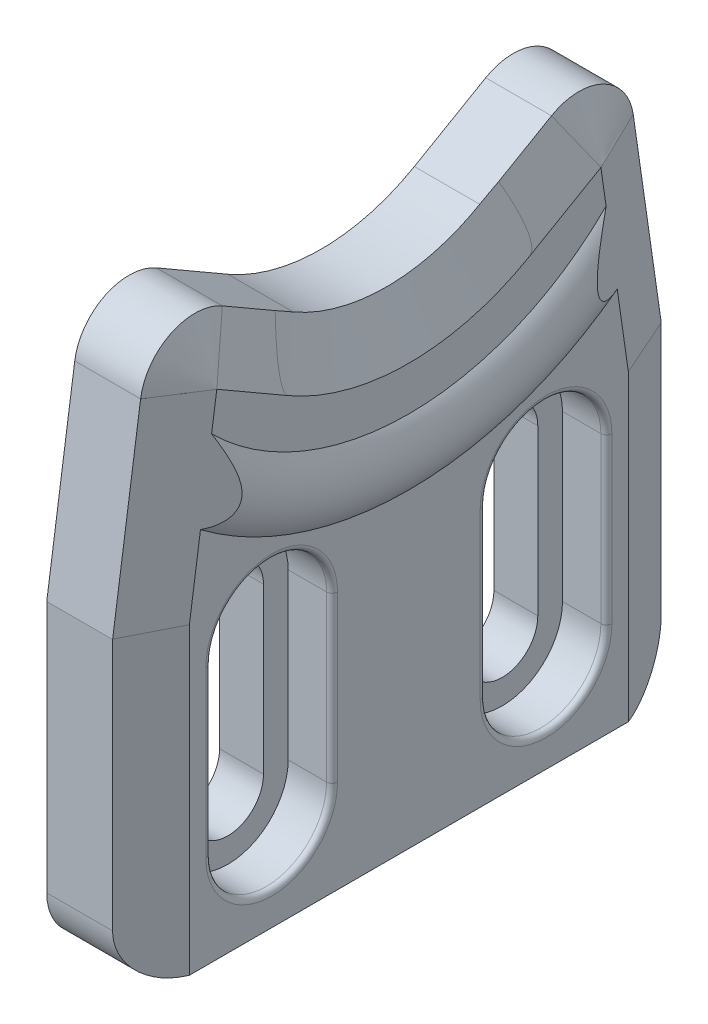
ISO-10303-21;
HEADER;
FILE_DESCRIPTION(('STEP AP214'),'2;1');
FILE_NAME('part.step','',(''),(''),'','','');
FILE_SCHEMA(('AUTOMOTIVE_DESIGN { 1 0 10303 214 1 1 1 1 }'));
ENDSEC;
DATA;
#1=APPLICATION_CONTEXT('core data for automotive mechanical design processes');
#2=APPLICATION_PROTOCOL_DEFINITION('international standard','automotive_design',2000,#1);
#3=PRODUCT_CONTEXT('',#1,'mechanical');
#4=PRODUCT('Part','Part','',(#3));
#5=PRODUCT_RELATED_PRODUCT_CATEGORY('part','',(#4));
#6=PRODUCT_DEFINITION_FORMATION('','',#4);
#7=PRODUCT_DEFINITION_CONTEXT('part definition',#1,'design');
#8=PRODUCT_DEFINITION('design','',#6,#7);
#9=PRODUCT_DEFINITION_SHAPE('','',#8);
#10=(LENGTH_UNIT() NAMED_UNIT(*) SI_UNIT(.MILLI.,.METRE.));
#11=(NAMED_UNIT(*) PLANE_ANGLE_UNIT() SI_UNIT($,.RADIAN.));
#12=(NAMED_UNIT(*) SI_UNIT($,.STERADIAN.) SOLID_ANGLE_UNIT());
#13=UNCERTAINTY_MEASURE_WITH_UNIT(LENGTH_MEASURE(1.E-05),#10,'distance_accuracy_value','');
#14=(GEOMETRIC_REPRESENTATION_CONTEXT(3) GLOBAL_UNCERTAINTY_ASSIGNED_CONTEXT((#13)) GLOBAL_UNIT_ASSIGNED_CONTEXT((#10,
#11,#12)) REPRESENTATION_CONTEXT('',''));
#15=CARTESIAN_POINT('',(0.,0.,0.));
#16=DIRECTION('',(0.,0.,1.));
#17=DIRECTION('',(1.,0.,0.));
#18=AXIS2_PLACEMENT_3D('',#15,#16,#17);
#19=CARTESIAN_POINT('',(7.5,8.00787926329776,-6.));
#20=DIRECTION('',(0.,1.,0.));
#21=DIRECTION('',(0.,0.,1.));
#22=AXIS2_PLACEMENT_3D('',#19,#20,#21);
#23=CYLINDRICAL_SURFACE('',#22,0.5);
#24=CARTESIAN_POINT('',(7.5,7.5,-6.));
#25=DIRECTION('',(0.,-1.,0.));
#26=DIRECTION('',(0.,0.,-1.));
#27=AXIS2_PLACEMENT_3D('',#24,#25,#26);
#28=CIRCLE('',#27,0.5);
#29=CARTESIAN_POINT('',(8.,7.5,-6.));
#30=VERTEX_POINT('',#29);
#31=CARTESIAN_POINT('',(7.5,7.5,-5.5));
#32=VERTEX_POINT('',#31);
#33=EDGE_CURVE('E27',#30,#32,#28,.T.);
#34=ORIENTED_EDGE('',*,*,#33,.T.);
#35=DIRECTION('',(0.,1.,0.));
#36=VECTOR('',#35,1.);
#37=CARTESIAN_POINT('',(7.5,7.5,-5.5));
#38=LINE('',#37,#36);
#39=CARTESIAN_POINT('',(7.5,-7.5,-5.5));
#40=VERTEX_POINT('',#39);
#41=EDGE_CURVE('E630',#40,#32,#38,.T.);
#42=ORIENTED_EDGE('',*,*,#41,.F.);
#43=CARTESIAN_POINT('',(7.5,-7.5,-6.));
#44=DIRECTION('',(0.,1.,0.));
#45=DIRECTION('',(0.,0.,1.));
#46=AXIS2_PLACEMENT_3D('',#43,#44,#45);
#47=CIRCLE('',#46,0.5);
#48=CARTESIAN_POINT('',(8.,-7.5,-6.));
#49=VERTEX_POINT('',#48);
#50=EDGE_CURVE('E10',#40,#49,#47,.T.);
#51=ORIENTED_EDGE('',*,*,#50,.T.);
#52=DIRECTION('',(0.,-1.,0.));
#53=VECTOR('',#52,1.);
#54=CARTESIAN_POINT('',(8.,-7.5,-6.));
#55=LINE('',#54,#53);
#56=EDGE_CURVE('E633',#30,#49,#55,.T.);
#57=ORIENTED_EDGE('',*,*,#56,.F.);
#58=EDGE_LOOP('',(#34,#42,#51,#57));
#59=FACE_BOUND('',#58,.T.);
#60=ADVANCED_FACE('F16',(#59),#23,.T.);
#61=CARTESIAN_POINT('',(7.5,-7.5,0.));
#62=DIRECTION('',(1.,0.,0.));
#63=DIRECTION('',(0.,0.,-1.));
#64=AXIS2_PLACEMENT_3D('',#61,#62,#63);
#65=TOROIDAL_SURFACE('',#64,6.,0.5);
#66=CARTESIAN_POINT('',(7.5,-7.5,6.));
#67=DIRECTION('',(0.,-1.,0.));
#68=DIRECTION('',(0.,0.,-1.));
#69=AXIS2_PLACEMENT_3D('',#66,#67,#68);
#70=CIRCLE('',#69,0.5);
#71=CARTESIAN_POINT('',(7.5,-7.5,5.5));
#72=VERTEX_POINT('',#71);
#73=CARTESIAN_POINT('',(8.,-7.5,6.));
#74=VERTEX_POINT('',#73);
#75=EDGE_CURVE('E706',#72,#74,#70,.T.);
#76=ORIENTED_EDGE('',*,*,#75,.T.);
#77=CARTESIAN_POINT('',(8.,-7.5,0.));
#78=DIRECTION('',(-1.,0.,0.));
#79=DIRECTION('',(0.,0.,-1.));
#80=AXIS2_PLACEMENT_3D('',#77,#78,#79);
#81=CIRCLE('',#80,6.);
#82=EDGE_CURVE('E1545',#49,#74,#81,.T.);
#83=ORIENTED_EDGE('',*,*,#82,.F.);
#84=ORIENTED_EDGE('',*,*,#50,.F.);
#85=CARTESIAN_POINT('',(7.5,-7.5,0.));
#86=DIRECTION('',(1.,0.,0.));
#87=DIRECTION('',(0.,0.,-1.));
#88=AXIS2_PLACEMENT_3D('',#85,#86,#87);
#89=CIRCLE('',#88,5.5);
#90=EDGE_CURVE('E1312',#72,#40,#89,.T.);
#91=ORIENTED_EDGE('',*,*,#90,.F.);
#92=EDGE_LOOP('',(#76,#83,#84,#91));
#93=FACE_BOUND('',#92,.T.);
#94=ADVANCED_FACE('F620',(#93),#65,.T.);
#95=CARTESIAN_POINT('',(7.5,7.5,0.));
#96=DIRECTION('',(1.,0.,0.));
#97=DIRECTION('',(0.,0.,-1.));
#98=AXIS2_PLACEMENT_3D('',#95,#96,#97);
#99=TOROIDAL_SURFACE('',#98,6.,0.5);
#100=CARTESIAN_POINT('',(7.5,7.5,6.));
#101=DIRECTION('',(0.,1.,0.));
#102=DIRECTION('',(0.,0.,1.));
#103=AXIS2_PLACEMENT_3D('',#100,#101,#102);
#104=CIRCLE('',#103,0.5);
#105=CARTESIAN_POINT('',(8.,7.5,6.));
#106=VERTEX_POINT('',#105);
#107=CARTESIAN_POINT('',(7.5,7.5,5.5));
#108=VERTEX_POINT('',#107);
#109=EDGE_CURVE('E639',#106,#108,#104,.T.);
#110=ORIENTED_EDGE('',*,*,#109,.T.);
#111=CARTESIAN_POINT('',(7.5,7.5,0.));
#112=DIRECTION('',(1.,0.,0.));
#113=DIRECTION('',(0.,0.,-1.));
#114=AXIS2_PLACEMENT_3D('',#111,#112,#113);
#115=CIRCLE('',#114,5.5);
#116=EDGE_CURVE('E654',#32,#108,#115,.T.);
#117=ORIENTED_EDGE('',*,*,#116,.F.);
#118=ORIENTED_EDGE('',*,*,#33,.F.);
#119=CARTESIAN_POINT('',(8.,7.5,0.));
#120=DIRECTION('',(-1.,0.,0.));
#121=DIRECTION('',(0.,0.,-1.));
#122=AXIS2_PLACEMENT_3D('',#119,#120,#121);
#123=CIRCLE('',#122,6.);
#124=EDGE_CURVE('E1051',#106,#30,#123,.T.);
#125=ORIENTED_EDGE('',*,*,#124,.F.);
#126=EDGE_LOOP('',(#110,#117,#118,#125));
#127=FACE_BOUND('',#126,.T.);
#128=ADVANCED_FACE('F625',(#127),#99,.T.);
#129=CARTESIAN_POINT('',(7.5,8.00787926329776,6.));
#130=DIRECTION('',(0.,-1.,0.));
#131=DIRECTION('',(0.,0.,-1.));
#132=AXIS2_PLACEMENT_3D('',#129,#130,#131);
#133=CYLINDRICAL_SURFACE('',#132,0.5);
#134=ORIENTED_EDGE('',*,*,#75,.F.);
#135=DIRECTION('',(0.,-1.,0.));
#136=VECTOR('',#135,1.);
#137=CARTESIAN_POINT('',(7.5,-7.5,5.5));
#138=LINE('',#137,#136);
#139=EDGE_CURVE('E667',#108,#72,#138,.T.);
#140=ORIENTED_EDGE('',*,*,#139,.F.);
#141=ORIENTED_EDGE('',*,*,#109,.F.);
#142=DIRECTION('',(0.,1.,0.));
#143=VECTOR('',#142,1.);
#144=CARTESIAN_POINT('',(8.,7.5,6.));
#145=LINE('',#144,#143);
#146=EDGE_CURVE('E1536',#74,#106,#145,.T.);
#147=ORIENTED_EDGE('',*,*,#146,.F.);
#148=EDGE_LOOP('',(#134,#140,#141,#147));
#149=FACE_BOUND('',#148,.T.);
#150=ADVANCED_FACE('F1870',(#149),#133,.T.);
#151=CARTESIAN_POINT('',(7.5,8.00787926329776,-31.));
#152=DIRECTION('',(0.,1.,0.));
#153=DIRECTION('',(0.,0.,1.));
#154=AXIS2_PLACEMENT_3D('',#151,#152,#153);
#155=CYLINDRICAL_SURFACE('',#154,0.5);
#156=CARTESIAN_POINT('',(7.5,7.5,-31.));
#157=DIRECTION('',(0.,-1.,0.));
#158=DIRECTION('',(0.,0.,-1.));
#159=AXIS2_PLACEMENT_3D('',#156,#157,#158);
#160=CIRCLE('',#159,0.5);
#161=CARTESIAN_POINT('',(8.,7.5,-31.));
#162=VERTEX_POINT('',#161);
#163=CARTESIAN_POINT('',(7.5,7.5,-30.5));
#164=VERTEX_POINT('',#163);
#165=EDGE_CURVE('E687',#162,#164,#160,.T.);
#166=ORIENTED_EDGE('',*,*,#165,.T.);
#167=DIRECTION('',(0.,1.,0.));
#168=VECTOR('',#167,1.);
#169=CARTESIAN_POINT('',(7.5,7.5,-30.5));
#170=LINE('',#169,#168);
#171=CARTESIAN_POINT('',(7.5,-7.5,-30.5));
#172=VERTEX_POINT('',#171);
#173=EDGE_CURVE('E1404',#172,#164,#170,.T.);
#174=ORIENTED_EDGE('',*,*,#173,.F.);
#175=CARTESIAN_POINT('',(7.5,-7.5,-31.));
#176=DIRECTION('',(0.,1.,0.));
#177=DIRECTION('',(0.,0.,1.));
#178=AXIS2_PLACEMENT_3D('',#175,#176,#177);
#179=CIRCLE('',#178,0.5);
#180=CARTESIAN_POINT('',(8.,-7.5,-31.));
#181=VERTEX_POINT('',#180);
#182=EDGE_CURVE('E690',#172,#181,#179,.T.);
#183=ORIENTED_EDGE('',*,*,#182,.T.);
#184=DIRECTION('',(0.,-1.,0.));
#185=VECTOR('',#184,1.);
#186=CARTESIAN_POINT('',(8.,-7.5,-31.));
#187=LINE('',#186,#185);
#188=EDGE_CURVE('E1574',#162,#181,#187,.T.);
#189=ORIENTED_EDGE('',*,*,#188,.F.);
#190=EDGE_LOOP('',(#166,#174,#183,#189));
#191=FACE_BOUND('',#190,.T.);
#192=ADVANCED_FACE('F1879',(#191),#155,.T.);
#193=CARTESIAN_POINT('',(7.5,-7.5,-25.));
#194=DIRECTION('',(1.,0.,0.));
#195=DIRECTION('',(0.,0.,-1.));
#196=AXIS2_PLACEMENT_3D('',#193,#194,#195);
#197=TOROIDAL_SURFACE('',#196,6.,0.5);
#198=CARTESIAN_POINT('',(7.5,-7.5,-19.));
#199=DIRECTION('',(0.,-1.,0.));
#200=DIRECTION('',(0.,0.,-1.));
#201=AXIS2_PLACEMENT_3D('',#198,#199,#200);
#202=CIRCLE('',#201,0.5);
#203=CARTESIAN_POINT('',(7.5,-7.5,-19.5));
#204=VERTEX_POINT('',#203);
#205=CARTESIAN_POINT('',(8.,-7.5,-19.));
#206=VERTEX_POINT('',#205);
#207=EDGE_CURVE('E700',#204,#206,#202,.T.);
#208=ORIENTED_EDGE('',*,*,#207,.T.);
#209=CARTESIAN_POINT('',(8.,-7.5,-25.));
#210=DIRECTION('',(-1.,0.,0.));
#211=DIRECTION('',(0.,0.,-1.));
#212=AXIS2_PLACEMENT_3D('',#209,#210,#211);
#213=CIRCLE('',#212,6.);
#214=EDGE_CURVE('E1052',#181,#206,#213,.T.);
#215=ORIENTED_EDGE('',*,*,#214,.F.);
#216=ORIENTED_EDGE('',*,*,#182,.F.);
#217=CARTESIAN_POINT('',(7.5,-7.5,-25.));
#218=DIRECTION('',(1.,0.,0.));
#219=DIRECTION('',(0.,0.,-1.));
#220=AXIS2_PLACEMENT_3D('',#217,#218,#219);
#221=CIRCLE('',#220,5.5);
#222=EDGE_CURVE('E1075',#204,#172,#221,.T.);
#223=ORIENTED_EDGE('',*,*,#222,.F.);
#224=EDGE_LOOP('',(#208,#215,#216,#223));
#225=FACE_BOUND('',#224,.T.);
#226=ADVANCED_FACE('F1862',(#225),#197,.T.);
#227=CARTESIAN_POINT('',(7.5,7.5,-25.));
#228=DIRECTION('',(1.,0.,0.));
#229=DIRECTION('',(0.,0.,-1.));
#230=AXIS2_PLACEMENT_3D('',#227,#228,#229);
#231=TOROIDAL_SURFACE('',#230,6.,0.5);
#232=CARTESIAN_POINT('',(7.5,7.5,-19.));
#233=DIRECTION('',(0.,1.,0.));
#234=DIRECTION('',(0.,0.,1.));
#235=AXIS2_PLACEMENT_3D('',#232,#233,#234);
#236=CIRCLE('',#235,0.5);
#237=CARTESIAN_POINT('',(8.,7.5,-19.));
#238=VERTEX_POINT('',#237);
#239=CARTESIAN_POINT('',(7.5,7.5,-19.5));
#240=VERTEX_POINT('',#239);
#241=EDGE_CURVE('E691',#238,#240,#236,.T.);
#242=ORIENTED_EDGE('',*,*,#241,.T.);
#243=CARTESIAN_POINT('',(7.5,7.5,-25.));
#244=DIRECTION('',(1.,0.,0.));
#245=DIRECTION('',(0.,0.,-1.));
#246=AXIS2_PLACEMENT_3D('',#243,#244,#245);
#247=CIRCLE('',#246,5.5);
#248=EDGE_CURVE('E1087',#164,#240,#247,.T.);
#249=ORIENTED_EDGE('',*,*,#248,.F.);
#250=ORIENTED_EDGE('',*,*,#165,.F.);
#251=CARTESIAN_POINT('',(8.,7.5,-25.));
#252=DIRECTION('',(-1.,0.,0.));
#253=DIRECTION('',(0.,0.,-1.));
#254=AXIS2_PLACEMENT_3D('',#251,#252,#253);
#255=CIRCLE('',#254,6.);
#256=EDGE_CURVE('E1584',#238,#162,#255,.T.);
#257=ORIENTED_EDGE('',*,*,#256,.F.);
#258=EDGE_LOOP('',(#242,#249,#250,#257));
#259=FACE_BOUND('',#258,.T.);
#260=ADVANCED_FACE('F1858',(#259),#231,.T.);
#261=CARTESIAN_POINT('',(7.5,8.00787926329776,-19.));
#262=DIRECTION('',(0.,-1.,0.));
#263=DIRECTION('',(0.,0.,-1.));
#264=AXIS2_PLACEMENT_3D('',#261,#262,#263);
#265=CYLINDRICAL_SURFACE('',#264,0.5);
#266=ORIENTED_EDGE('',*,*,#207,.F.);
#267=DIRECTION('',(0.,-1.,0.));
#268=VECTOR('',#267,1.);
#269=CARTESIAN_POINT('',(7.5,-7.5,-19.5));
#270=LINE('',#269,#268);
#271=EDGE_CURVE('E1435',#240,#204,#270,.T.);
#272=ORIENTED_EDGE('',*,*,#271,.F.);
#273=ORIENTED_EDGE('',*,*,#241,.F.);
#274=DIRECTION('',(0.,1.,0.));
#275=VECTOR('',#274,1.);
#276=CARTESIAN_POINT('',(8.,7.5,-19.));
#277=LINE('',#276,#275);
#278=EDGE_CURVE('E1046',#206,#238,#277,.T.);
#279=ORIENTED_EDGE('',*,*,#278,.F.);
#280=EDGE_LOOP('',(#266,#272,#273,#279));
#281=FACE_BOUND('',#280,.T.);
#282=ADVANCED_FACE('F1861',(#281),#265,.T.);
#283=CARTESIAN_POINT('',(0.,8.00787926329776,-12.5));
#284=DIRECTION('',(1.,0.,0.));
#285=DIRECTION('',(0.,1.,0.));
#286=AXIS2_PLACEMENT_3D('',#283,#284,#285);
#287=PLANE('',#286);
#288=DIRECTION('',(0.,1.,0.));
#289=VECTOR('',#288,1.);
#290=CARTESIAN_POINT('',(0.,4.00393963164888,-28.25));
#291=LINE('',#290,#289);
#292=CARTESIAN_POINT('',(0.,-7.5,-28.25));
#293=VERTEX_POINT('',#292);
#294=CARTESIAN_POINT('',(0.,7.5,-28.25));
#295=VERTEX_POINT('',#294);
#296=EDGE_CURVE('E1117',#293,#295,#291,.T.);
#297=ORIENTED_EDGE('',*,*,#296,.T.);
#298=CARTESIAN_POINT('',(0.,7.5,-25.));
#299=DIRECTION('',(1.,0.,0.));
#300=DIRECTION('',(0.,0.,-1.));
#301=AXIS2_PLACEMENT_3D('',#298,#299,#300);
#302=CIRCLE('',#301,3.25);
#303=CARTESIAN_POINT('',(0.,7.5,-21.75));
#304=VERTEX_POINT('',#303);
#305=EDGE_CURVE('E676',#295,#304,#302,.T.);
#306=ORIENTED_EDGE('',*,*,#305,.T.);
#307=DIRECTION('',(0.,-1.,0.));
#308=VECTOR('',#307,1.);
#309=CARTESIAN_POINT('',(0.,4.00393963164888,-21.75));
#310=LINE('',#309,#308);
#311=CARTESIAN_POINT('',(0.,-7.5,-21.75));
#312=VERTEX_POINT('',#311);
#313=EDGE_CURVE('E680',#304,#312,#310,.T.);
#314=ORIENTED_EDGE('',*,*,#313,.T.);
#315=CARTESIAN_POINT('',(0.,-7.5,-25.));
#316=DIRECTION('',(1.,0.,0.));
#317=DIRECTION('',(0.,0.,1.));
#318=AXIS2_PLACEMENT_3D('',#315,#316,#317);
#319=CIRCLE('',#318,3.25);
#320=EDGE_CURVE('E1344',#312,#293,#319,.T.);
#321=ORIENTED_EDGE('',*,*,#320,.T.);
#322=EDGE_LOOP('',(#297,#306,#314,#321));
#323=FACE_BOUND('',#322,.T.);
#324=DIRECTION('',(0.,-1.,0.));
#325=VECTOR('',#324,1.);
#326=CARTESIAN_POINT('',(0.,4.00393963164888,3.25));
#327=LINE('',#326,#325);
#328=CARTESIAN_POINT('',(0.,7.5,3.25));
#329=VERTEX_POINT('',#328);
#330=CARTESIAN_POINT('',(0.,-7.5,3.25));
#331=VERTEX_POINT('',#330);
#332=EDGE_CURVE('E699',#329,#331,#327,.T.);
#333=ORIENTED_EDGE('',*,*,#332,.T.);
#334=CARTESIAN_POINT('',(0.,-7.5,0.));
#335=DIRECTION('',(1.,0.,0.));
#336=DIRECTION('',(0.,0.,1.));
#337=AXIS2_PLACEMENT_3D('',#334,#335,#336);
#338=CIRCLE('',#337,3.25);
#339=CARTESIAN_POINT('',(0.,-7.5,-3.25));
#340=VERTEX_POINT('',#339);
#341=EDGE_CURVE('E685',#331,#340,#338,.T.);
#342=ORIENTED_EDGE('',*,*,#341,.T.);
#343=DIRECTION('',(0.,1.,0.));
#344=VECTOR('',#343,1.);
#345=CARTESIAN_POINT('',(0.,4.00393963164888,-3.25));
#346=LINE('',#345,#344);
#347=CARTESIAN_POINT('',(0.,7.5,-3.25));
#348=VERTEX_POINT('',#347);
#349=EDGE_CURVE('E1064',#340,#348,#346,.T.);
#350=ORIENTED_EDGE('',*,*,#349,.T.);
#351=CARTESIAN_POINT('',(0.,7.5,0.));
#352=DIRECTION('',(1.,0.,0.));
#353=DIRECTION('',(0.,0.,-1.));
#354=AXIS2_PLACEMENT_3D('',#351,#352,#353);
#355=CIRCLE('',#354,3.25);
#356=EDGE_CURVE('E695',#348,#329,#355,.T.);
#357=ORIENTED_EDGE('',*,*,#356,.T.);
#358=EDGE_LOOP('',(#333,#342,#350,#357));
#359=FACE_BOUND('',#358,.T.);
#360=CARTESIAN_POINT('',(0.,29.0000000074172,-30.0000000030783));
#361=DIRECTION('',(1.,0.,0.));
#362=DIRECTION('',(0.,0.142553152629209,-0.98978714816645));
#363=AXIS2_PLACEMENT_3D('',#360,#361,#362);
#364=CIRCLE('',#363,4.9999999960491);
#365=CARTESIAN_POINT('',(0.,29.71276577,-34.94893574));
#366=VERTEX_POINT('',#365);
#367=CARTESIAN_POINT('',(0.,33.33012702,-27.5));
#368=VERTEX_POINT('',#367);
#369=EDGE_CURVE('E899',#366,#368,#364,.T.);
#370=ORIENTED_EDGE('',*,*,#369,.F.);
#371=DIRECTION('',(0.,0.989787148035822,0.142553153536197));
#372=VECTOR('',#371,1.);
#373=CARTESIAN_POINT('',(0.,12.,-37.5));
#374=LINE('',#373,#372);
#375=CARTESIAN_POINT('',(0.,12.,-37.5));
#376=VERTEX_POINT('',#375);
#377=EDGE_CURVE('E720',#376,#366,#374,.T.);
#378=ORIENTED_EDGE('',*,*,#377,.F.);
#379=DIRECTION('',(0.,1.,0.));
#380=VECTOR('',#379,1.);
#381=CARTESIAN_POINT('',(0.,-11.,-37.5));
#382=LINE('',#381,#380);
#383=CARTESIAN_POINT('',(0.,-11.,-37.5));
#384=VERTEX_POINT('',#383);
#385=EDGE_CURVE('E1107',#384,#376,#382,.T.);
#386=ORIENTED_EDGE('',*,*,#385,.F.);
#387=CARTESIAN_POINT('',(0.,-11.0000000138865,-32.5000000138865));
#388=DIRECTION('',(1.,0.,0.));
#389=DIRECTION('',(0.,-1.,2.77730339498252E-09));
#390=AXIS2_PLACEMENT_3D('',#387,#388,#389);
#391=CIRCLE('',#390,4.99999998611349);
#392=CARTESIAN_POINT('',(0.,-16.,-32.5));
#393=VERTEX_POINT('',#392);
#394=EDGE_CURVE('E1076',#393,#384,#391,.T.);
#395=ORIENTED_EDGE('',*,*,#394,.F.);
#396=DIRECTION('',(0.,0.,-1.));
#397=VECTOR('',#396,1.);
#398=CARTESIAN_POINT('',(0.,-16.,7.5));
#399=LINE('',#398,#397);
#400=CARTESIAN_POINT('',(0.,-16.,7.5));
#401=VERTEX_POINT('',#400);
#402=EDGE_CURVE('E1034',#401,#393,#399,.T.);
#403=ORIENTED_EDGE('',*,*,#402,.F.);
#404=CARTESIAN_POINT('',(0.,-11.0000000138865,7.5000000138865));
#405=DIRECTION('',(1.,0.,0.));
#406=DIRECTION('',(0.,2.77729923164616E-09,1.));
#407=AXIS2_PLACEMENT_3D('',#404,#405,#406);
#408=CIRCLE('',#407,4.99999998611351);
#409=CARTESIAN_POINT('',(0.,-11.,12.5));
#410=VERTEX_POINT('',#409);
#411=EDGE_CURVE('E41',#410,#401,#408,.T.);
#412=ORIENTED_EDGE('',*,*,#411,.F.);
#413=DIRECTION('',(0.,-1.,0.));
#414=VECTOR('',#413,1.);
#415=CARTESIAN_POINT('',(0.,12.,12.5));
#416=LINE('',#415,#414);
#417=CARTESIAN_POINT('',(0.,12.,12.5));
#418=VERTEX_POINT('',#417);
#419=EDGE_CURVE('E1129',#418,#410,#416,.T.);
#420=ORIENTED_EDGE('',*,*,#419,.F.);
#421=DIRECTION('',(0.,-0.989787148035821,0.142553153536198));
#422=VECTOR('',#421,1.);
#423=CARTESIAN_POINT('',(0.,29.71276577,9.94893574));
#424=LINE('',#423,#422);
#425=CARTESIAN_POINT('',(0.,29.71276577,9.94893574));
#426=VERTEX_POINT('',#425);
#427=EDGE_CURVE('E833',#426,#418,#424,.T.);
#428=ORIENTED_EDGE('',*,*,#427,.F.);
#429=CARTESIAN_POINT('',(0.,29.0000000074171,5.00000000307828));
#430=DIRECTION('',(1.,0.,0.));
#431=DIRECTION('',(0.,0.866025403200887,-0.500000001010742));
#432=AXIS2_PLACEMENT_3D('',#429,#430,#431);
#433=CIRCLE('',#432,4.99999999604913);
#434=CARTESIAN_POINT('',(0.,33.33012702,2.5));
#435=VERTEX_POINT('',#434);
#436=EDGE_CURVE('E425',#435,#426,#433,.T.);
#437=ORIENTED_EDGE('',*,*,#436,.F.);
#438=DIRECTION('',(0.,0.500000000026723,0.86602540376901));
#439=VECTOR('',#438,1.);
#440=CARTESIAN_POINT('',(0.,29.57735027,-4.));
#441=LINE('',#440,#439);
#442=CARTESIAN_POINT('',(0.,29.57735027,-4.));
#443=VERTEX_POINT('',#442);
#444=EDGE_CURVE('E1631',#443,#435,#441,.T.);
#445=ORIENTED_EDGE('',*,*,#444,.F.);
#446=CARTESIAN_POINT('',(0.,44.2997821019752,-12.5));
#447=DIRECTION('',(1.,0.,0.));
#448=DIRECTION('',(0.,-0.866025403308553,0.500000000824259));
#449=AXIS2_PLACEMENT_3D('',#446,#447,#448);
#450=CIRCLE('',#449,16.9999999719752);
#451=CARTESIAN_POINT('',(0.,29.57735027,-21.));
#452=VERTEX_POINT('',#451);
#453=EDGE_CURVE('E1623',#443,#452,#450,.T.);
#454=ORIENTED_EDGE('',*,*,#453,.T.);
#455=DIRECTION('',(0.,-0.500000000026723,0.86602540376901));
#456=VECTOR('',#455,1.);
#457=CARTESIAN_POINT('',(0.,33.33012702,-27.5));
#458=LINE('',#457,#456);
#459=EDGE_CURVE('E544',#368,#452,#458,.T.);
#460=ORIENTED_EDGE('',*,*,#459,.F.);
#461=EDGE_LOOP('',(#370,#378,#386,#395,#403,#412,#420,#428,#437,#445,#454,#460));
#462=FACE_BOUND('',#461,.T.);
#463=ADVANCED_FACE('F1733',(#323,#359,#462),#287,.F.);
#464=CARTESIAN_POINT('',(0.,-11.0000000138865,7.5000000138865));
#465=DIRECTION('',(1.,0.,0.));
#466=DIRECTION('',(0.,2.77729923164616E-09,1.));
#467=AXIS2_PLACEMENT_3D('',#464,#465,#466);
#468=CYLINDRICAL_SURFACE('',#467,4.99999998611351);
#469=CARTESIAN_POINT('',(8.,-16.,7.5));
#470=CARTESIAN_POINT('',(6.82842712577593,-16.0000000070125,10.4289321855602));
#471=CARTESIAN_POINT('',(6.0000000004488,-13.9289321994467,12.499999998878));
#472=CARTESIAN_POINT('',(6.,-11.0000000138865,12.5));
#473=(BOUNDED_CURVE() B_SPLINE_CURVE(3,(#469,#470,#471,#472),.UNSPECIFIED.,.F.,
.F.) B_SPLINE_CURVE_WITH_KNOTS((4,4),(4.71238897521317,6.28318530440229),
.UNSPECIFIED.) CURVE() GEOMETRIC_REPRESENTATION_ITEM() RATIONAL_B_SPLINE_CURVE((1.,
0.804737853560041,0.804737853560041,1.)) REPRESENTATION_ITEM(''));
#474=CARTESIAN_POINT('',(8.,-16.,7.5));
#475=VERTEX_POINT('',#474);
#476=CARTESIAN_POINT('',(6.,-11.0000000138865,12.5));
#477=VERTEX_POINT('',#476);
#478=EDGE_CURVE('E1108',#475,#477,#473,.T.);
#479=ORIENTED_EDGE('',*,*,#478,.T.);
#480=DIRECTION('',(1.,0.,0.));
#481=VECTOR('',#480,1.);
#482=CARTESIAN_POINT('',(0.,-11.,12.5));
#483=LINE('',#482,#481);
#484=EDGE_CURVE('E1035',#410,#477,#483,.T.);
#485=ORIENTED_EDGE('',*,*,#484,.F.);
#486=ORIENTED_EDGE('',*,*,#411,.T.);
#487=DIRECTION('',(1.,0.,0.));
#488=VECTOR('',#487,1.);
#489=CARTESIAN_POINT('',(0.,-16.,7.5));
#490=LINE('',#489,#488);
#491=EDGE_CURVE('E1030',#401,#475,#490,.T.);
#492=ORIENTED_EDGE('',*,*,#491,.T.);
#493=EDGE_LOOP('',(#479,#485,#486,#492));
#494=FACE_BOUND('',#493,.T.);
#495=ADVANCED_FACE('F1752',(#494),#468,.T.);
#496=CARTESIAN_POINT('',(0.,-16.,-12.5));
#497=DIRECTION('',(0.,-1.,0.));
#498=DIRECTION('',(0.,0.,-1.));
#499=AXIS2_PLACEMENT_3D('',#496,#497,#498);
#500=PLANE('',#499);
#501=DIRECTION('',(0.,0.,1.));
#502=VECTOR('',#501,1.);
#503=CARTESIAN_POINT('',(8.,-16.,7.5));
#504=LINE('',#503,#502);
#505=CARTESIAN_POINT('',(8.,-16.,-32.5));
#506=VERTEX_POINT('',#505);
#507=EDGE_CURVE('E1599',#506,#475,#504,.T.);
#508=ORIENTED_EDGE('',*,*,#507,.T.);
#509=ORIENTED_EDGE('',*,*,#491,.F.);
#510=ORIENTED_EDGE('',*,*,#402,.T.);
#511=DIRECTION('',(1.,0.,0.));
#512=VECTOR('',#511,1.);
#513=CARTESIAN_POINT('',(0.,-16.,-32.5));
#514=LINE('',#513,#512);
#515=EDGE_CURVE('E1487',#393,#506,#514,.T.);
#516=ORIENTED_EDGE('',*,*,#515,.T.);
#517=EDGE_LOOP('',(#508,#509,#510,#516));
#518=FACE_BOUND('',#517,.T.);
#519=ADVANCED_FACE('F584',(#518),#500,.T.);
#520=CARTESIAN_POINT('',(0.,0.5,12.5));
#521=DIRECTION('',(0.,0.,1.));
#522=DIRECTION('',(1.,0.,0.));
#523=AXIS2_PLACEMENT_3D('',#520,#521,#522);
#524=PLANE('',#523);
#525=DIRECTION('',(0.,1.,0.));
#526=VECTOR('',#525,1.);
#527=CARTESIAN_POINT('',(6.,8.25,12.5));
#528=LINE('',#527,#526);
#529=CARTESIAN_POINT('',(6.,12.,12.5));
#530=VERTEX_POINT('',#529);
#531=EDGE_CURVE('E712',#477,#530,#528,.T.);
#532=ORIENTED_EDGE('',*,*,#531,.T.);
#533=DIRECTION('',(1.,0.,0.));
#534=VECTOR('',#533,1.);
#535=CARTESIAN_POINT('',(0.,12.,12.5));
#536=LINE('',#535,#534);
#537=EDGE_CURVE('E1025',#418,#530,#536,.T.);
#538=ORIENTED_EDGE('',*,*,#537,.F.);
#539=ORIENTED_EDGE('',*,*,#419,.T.);
#540=ORIENTED_EDGE('',*,*,#484,.T.);
#541=EDGE_LOOP('',(#532,#538,#539,#540));
#542=FACE_BOUND('',#541,.T.);
#543=ADVANCED_FACE('F581',(#542),#524,.T.);
#544=CARTESIAN_POINT('',(0.,0.,3.25));
#545=DIRECTION('',(0.,0.,1.));
#546=DIRECTION('',(1.,0.,0.));
#547=AXIS2_PLACEMENT_3D('',#544,#545,#546);
#548=PLANE('',#547);
#549=DIRECTION('',(0.,-1.,0.));
#550=VECTOR('',#549,1.);
#551=CARTESIAN_POINT('',(4.,0.,3.25));
#552=LINE('',#551,#550);
#553=CARTESIAN_POINT('',(4.,7.5,3.25));
#554=VERTEX_POINT('',#553);
#555=CARTESIAN_POINT('',(4.,-7.5,3.25));
#556=VERTEX_POINT('',#555);
#557=EDGE_CURVE('E686',#554,#556,#552,.T.);
#558=ORIENTED_EDGE('',*,*,#557,.T.);
#559=DIRECTION('',(1.,0.,0.));
#560=VECTOR('',#559,1.);
#561=CARTESIAN_POINT('',(0.,-7.5,3.25));
#562=LINE('',#561,#560);
#563=EDGE_CURVE('E1065',#331,#556,#562,.T.);
#564=ORIENTED_EDGE('',*,*,#563,.F.);
#565=ORIENTED_EDGE('',*,*,#332,.F.);
#566=DIRECTION('',(1.,0.,0.));
#567=VECTOR('',#566,1.);
#568=CARTESIAN_POINT('',(0.,7.5,3.25));
#569=LINE('',#568,#567);
#570=EDGE_CURVE('E694',#329,#554,#569,.T.);
#571=ORIENTED_EDGE('',*,*,#570,.T.);
#572=EDGE_LOOP('',(#558,#564,#565,#571));
#573=FACE_BOUND('',#572,.T.);
#574=ADVANCED_FACE('F583',(#573),#548,.F.);
#575=CARTESIAN_POINT('',(0.,7.5,0.));
#576=DIRECTION('',(1.,0.,0.));
#577=DIRECTION('',(0.,0.,-1.));
#578=AXIS2_PLACEMENT_3D('',#575,#576,#577);
#579=CYLINDRICAL_SURFACE('',#578,3.25);
#580=CARTESIAN_POINT('',(4.,7.5,0.));
#581=DIRECTION('',(1.,0.,0.));
#582=DIRECTION('',(0.,0.,-1.));
#583=AXIS2_PLACEMENT_3D('',#580,#581,#582);
#584=CIRCLE('',#583,3.25);
#585=CARTESIAN_POINT('',(4.,7.5,-3.25));
#586=VERTEX_POINT('',#585);
#587=EDGE_CURVE('E675',#586,#554,#584,.T.);
#588=ORIENTED_EDGE('',*,*,#587,.T.);
#589=ORIENTED_EDGE('',*,*,#570,.F.);
#590=ORIENTED_EDGE('',*,*,#356,.F.);
#591=DIRECTION('',(1.,0.,0.));
#592=VECTOR('',#591,1.);
#593=CARTESIAN_POINT('',(0.,7.5,-3.25));
#594=LINE('',#593,#592);
#595=EDGE_CURVE('E1060',#348,#586,#594,.T.);
#596=ORIENTED_EDGE('',*,*,#595,.T.);
#597=EDGE_LOOP('',(#588,#589,#590,#596));
#598=FACE_BOUND('',#597,.T.);
#599=ADVANCED_FACE('F1850',(#598),#579,.F.);
#600=CARTESIAN_POINT('',(0.,0.,-21.75));
#601=DIRECTION('',(0.,0.,1.));
#602=DIRECTION('',(1.,0.,0.));
#603=AXIS2_PLACEMENT_3D('',#600,#601,#602);
#604=PLANE('',#603);
#605=DIRECTION('',(0.,-1.,0.));
#606=VECTOR('',#605,1.);
#607=CARTESIAN_POINT('',(4.,0.,-21.75));
#608=LINE('',#607,#606);
#609=CARTESIAN_POINT('',(4.,7.5,-21.75));
#610=VERTEX_POINT('',#609);
#611=CARTESIAN_POINT('',(4.,-7.5,-21.75));
#612=VERTEX_POINT('',#611);
#613=EDGE_CURVE('E1360',#610,#612,#608,.T.);
#614=ORIENTED_EDGE('',*,*,#613,.T.);
#615=DIRECTION('',(1.,0.,0.));
#616=VECTOR('',#615,1.);
#617=CARTESIAN_POINT('',(0.,-7.5,-21.75));
#618=LINE('',#617,#616);
#619=EDGE_CURVE('E1118',#312,#612,#618,.T.);
#620=ORIENTED_EDGE('',*,*,#619,.F.);
#621=ORIENTED_EDGE('',*,*,#313,.F.);
#622=DIRECTION('',(1.,0.,0.));
#623=VECTOR('',#622,1.);
#624=CARTESIAN_POINT('',(0.,7.5,-21.75));
#625=LINE('',#624,#623);
#626=EDGE_CURVE('E681',#304,#610,#625,.T.);
#627=ORIENTED_EDGE('',*,*,#626,.T.);
#628=EDGE_LOOP('',(#614,#620,#621,#627));
#629=FACE_BOUND('',#628,.T.);
#630=ADVANCED_FACE('F1846',(#629),#604,.F.);
#631=CARTESIAN_POINT('',(0.,7.5,-25.));
#632=DIRECTION('',(1.,0.,0.));
#633=DIRECTION('',(0.,0.,-1.));
#634=AXIS2_PLACEMENT_3D('',#631,#632,#633);
#635=CYLINDRICAL_SURFACE('',#634,3.25);
#636=CARTESIAN_POINT('',(4.,7.5,-25.));
#637=DIRECTION('',(1.,0.,0.));
#638=DIRECTION('',(0.,0.,-1.));
#639=AXIS2_PLACEMENT_3D('',#636,#637,#638);
#640=CIRCLE('',#639,3.25);
#641=CARTESIAN_POINT('',(4.,7.5,-28.25));
#642=VERTEX_POINT('',#641);
#643=EDGE_CURVE('E1387',#642,#610,#640,.T.);
#644=ORIENTED_EDGE('',*,*,#643,.T.);
#645=ORIENTED_EDGE('',*,*,#626,.F.);
#646=ORIENTED_EDGE('',*,*,#305,.F.);
#647=DIRECTION('',(1.,0.,0.));
#648=VECTOR('',#647,1.);
#649=CARTESIAN_POINT('',(0.,7.5,-28.25));
#650=LINE('',#649,#648);
#651=EDGE_CURVE('E1113',#295,#642,#650,.T.);
#652=ORIENTED_EDGE('',*,*,#651,.T.);
#653=EDGE_LOOP('',(#644,#645,#646,#652));
#654=FACE_BOUND('',#653,.T.);
#655=ADVANCED_FACE('F1842',(#654),#635,.F.);
#656=CARTESIAN_POINT('',(0.,0.,-3.25));
#657=DIRECTION('',(0.,0.,-1.));
#658=DIRECTION('',(0.,-1.,0.));
#659=AXIS2_PLACEMENT_3D('',#656,#657,#658);
#660=PLANE('',#659);
#661=DIRECTION('',(0.,1.,0.));
#662=VECTOR('',#661,1.);
#663=CARTESIAN_POINT('',(4.,0.,-3.25));
#664=LINE('',#663,#662);
#665=CARTESIAN_POINT('',(4.,-7.5,-3.25));
#666=VERTEX_POINT('',#665);
#667=EDGE_CURVE('E1239',#666,#586,#664,.T.);
#668=ORIENTED_EDGE('',*,*,#667,.T.);
#669=ORIENTED_EDGE('',*,*,#595,.F.);
#670=ORIENTED_EDGE('',*,*,#349,.F.);
#671=DIRECTION('',(1.,0.,0.));
#672=VECTOR('',#671,1.);
#673=CARTESIAN_POINT('',(0.,-7.5,-3.25));
#674=LINE('',#673,#672);
#675=EDGE_CURVE('E682',#340,#666,#674,.T.);
#676=ORIENTED_EDGE('',*,*,#675,.T.);
#677=EDGE_LOOP('',(#668,#669,#670,#676));
#678=FACE_BOUND('',#677,.T.);
#679=ADVANCED_FACE('F1838',(#678),#660,.F.);
#680=CARTESIAN_POINT('',(0.,-7.5,0.));
#681=DIRECTION('',(1.,0.,0.));
#682=DIRECTION('',(0.,0.,1.));
#683=AXIS2_PLACEMENT_3D('',#680,#681,#682);
#684=CYLINDRICAL_SURFACE('',#683,3.25);
#685=CARTESIAN_POINT('',(4.,-7.5,0.));
#686=DIRECTION('',(1.,0.,0.));
#687=DIRECTION('',(0.,0.,1.));
#688=AXIS2_PLACEMENT_3D('',#685,#686,#687);
#689=CIRCLE('',#688,3.25);
#690=EDGE_CURVE('E1228',#556,#666,#689,.T.);
#691=ORIENTED_EDGE('',*,*,#690,.T.);
#692=ORIENTED_EDGE('',*,*,#675,.F.);
#693=ORIENTED_EDGE('',*,*,#341,.F.);
#694=ORIENTED_EDGE('',*,*,#563,.T.);
#695=EDGE_LOOP('',(#691,#692,#693,#694));
#696=FACE_BOUND('',#695,.T.);
#697=ADVANCED_FACE('F1819',(#696),#684,.F.);
#698=CARTESIAN_POINT('',(4.,0.,0.));
#699=DIRECTION('',(1.,0.,0.));
#700=DIRECTION('',(0.,1.,0.));
#701=AXIS2_PLACEMENT_3D('',#698,#699,#700);
#702=PLANE('',#701);
#703=ORIENTED_EDGE('',*,*,#587,.F.);
#704=ORIENTED_EDGE('',*,*,#667,.F.);
#705=ORIENTED_EDGE('',*,*,#690,.F.);
#706=ORIENTED_EDGE('',*,*,#557,.F.);
#707=EDGE_LOOP('',(#703,#704,#705,#706));
#708=FACE_BOUND('',#707,.T.);
#709=CARTESIAN_POINT('',(4.,7.5,0.));
#710=DIRECTION('',(1.,0.,0.));
#711=DIRECTION('',(0.,1.,0.));
#712=AXIS2_PLACEMENT_3D('',#709,#710,#711);
#713=CIRCLE('',#712,5.5);
#714=CARTESIAN_POINT('',(4.,7.5,-5.5));
#715=VERTEX_POINT('',#714);
#716=CARTESIAN_POINT('',(4.,7.5,5.5));
#717=VERTEX_POINT('',#716);
#718=EDGE_CURVE('E651',#715,#717,#713,.T.);
#719=ORIENTED_EDGE('',*,*,#718,.T.);
#720=DIRECTION('',(0.,-1.,0.));
#721=VECTOR('',#720,1.);
#722=CARTESIAN_POINT('',(4.,7.5,5.5));
#723=LINE('',#722,#721);
#724=CARTESIAN_POINT('',(4.,-7.5,5.5));
#725=VERTEX_POINT('',#724);
#726=EDGE_CURVE('E663',#717,#725,#723,.T.);
#727=ORIENTED_EDGE('',*,*,#726,.T.);
#728=CARTESIAN_POINT('',(4.,-7.5,0.));
#729=DIRECTION('',(1.,0.,0.));
#730=DIRECTION('',(0.,0.,1.));
#731=AXIS2_PLACEMENT_3D('',#728,#729,#730);
#732=CIRCLE('',#731,5.5);
#733=CARTESIAN_POINT('',(4.,-7.5,-5.5));
#734=VERTEX_POINT('',#733);
#735=EDGE_CURVE('E1297',#725,#734,#732,.T.);
#736=ORIENTED_EDGE('',*,*,#735,.T.);
#737=DIRECTION('',(0.,1.,0.));
#738=VECTOR('',#737,1.);
#739=CARTESIAN_POINT('',(4.,-7.5,-5.5));
#740=LINE('',#739,#738);
#741=EDGE_CURVE('E650',#734,#715,#740,.T.);
#742=ORIENTED_EDGE('',*,*,#741,.T.);
#743=EDGE_LOOP('',(#719,#727,#736,#742));
#744=FACE_BOUND('',#743,.T.);
#745=ADVANCED_FACE('F1816',(#708,#744),#702,.T.);
#746=CARTESIAN_POINT('',(4.,0.,-5.5));
#747=DIRECTION('',(0.,0.,-1.));
#748=DIRECTION('',(0.,-1.,0.));
#749=AXIS2_PLACEMENT_3D('',#746,#747,#748);
#750=PLANE('',#749);
#751=DIRECTION('',(1.,0.,0.));
#752=VECTOR('',#751,1.);
#753=CARTESIAN_POINT('',(4.,-7.5,-5.5));
#754=LINE('',#753,#752);
#755=EDGE_CURVE('E647',#734,#40,#754,.T.);
#756=ORIENTED_EDGE('',*,*,#755,.T.);
#757=ORIENTED_EDGE('',*,*,#41,.T.);
#758=DIRECTION('',(1.,0.,0.));
#759=VECTOR('',#758,1.);
#760=CARTESIAN_POINT('',(4.,7.5,-5.5));
#761=LINE('',#760,#759);
#762=EDGE_CURVE('E645',#715,#32,#761,.T.);
#763=ORIENTED_EDGE('',*,*,#762,.F.);
#764=ORIENTED_EDGE('',*,*,#741,.F.);
#765=EDGE_LOOP('',(#756,#757,#763,#764));
#766=FACE_BOUND('',#765,.T.);
#767=ADVANCED_FACE('F643',(#766),#750,.F.);
#768=CARTESIAN_POINT('',(4.,7.5,0.));
#769=DIRECTION('',(1.,0.,0.));
#770=DIRECTION('',(0.,0.,-1.));
#771=AXIS2_PLACEMENT_3D('',#768,#769,#770);
#772=CYLINDRICAL_SURFACE('',#771,5.5);
#773=ORIENTED_EDGE('',*,*,#762,.T.);
#774=ORIENTED_EDGE('',*,*,#116,.T.);
#775=DIRECTION('',(1.,0.,0.));
#776=VECTOR('',#775,1.);
#777=CARTESIAN_POINT('',(4.,7.5,5.5));
#778=LINE('',#777,#776);
#779=EDGE_CURVE('E1290',#717,#108,#778,.T.);
#780=ORIENTED_EDGE('',*,*,#779,.F.);
#781=ORIENTED_EDGE('',*,*,#718,.F.);
#782=EDGE_LOOP('',(#773,#774,#780,#781));
#783=FACE_BOUND('',#782,.T.);
#784=ADVANCED_FACE('F661',(#783),#772,.F.);
#785=CARTESIAN_POINT('',(4.,0.,5.5));
#786=DIRECTION('',(0.,0.,1.));
#787=DIRECTION('',(1.,0.,0.));
#788=AXIS2_PLACEMENT_3D('',#785,#786,#787);
#789=PLANE('',#788);
#790=ORIENTED_EDGE('',*,*,#779,.T.);
#791=ORIENTED_EDGE('',*,*,#139,.T.);
#792=DIRECTION('',(1.,0.,0.));
#793=VECTOR('',#792,1.);
#794=CARTESIAN_POINT('',(4.,-7.5,5.5));
#795=LINE('',#794,#793);
#796=EDGE_CURVE('E1319',#725,#72,#795,.T.);
#797=ORIENTED_EDGE('',*,*,#796,.F.);
#798=ORIENTED_EDGE('',*,*,#726,.F.);
#799=EDGE_LOOP('',(#790,#791,#797,#798));
#800=FACE_BOUND('',#799,.T.);
#801=ADVANCED_FACE('F1827',(#800),#789,.F.);
#802=CARTESIAN_POINT('',(4.,-7.5,0.));
#803=DIRECTION('',(1.,0.,0.));
#804=DIRECTION('',(0.,0.,1.));
#805=AXIS2_PLACEMENT_3D('',#802,#803,#804);
#806=CYLINDRICAL_SURFACE('',#805,5.5);
#807=ORIENTED_EDGE('',*,*,#796,.T.);
#808=ORIENTED_EDGE('',*,*,#90,.T.);
#809=ORIENTED_EDGE('',*,*,#755,.F.);
#810=ORIENTED_EDGE('',*,*,#735,.F.);
#811=EDGE_LOOP('',(#807,#808,#809,#810));
#812=FACE_BOUND('',#811,.T.);
#813=ADVANCED_FACE('F1823',(#812),#806,.F.);
#814=CARTESIAN_POINT('',(0.,0.,-28.25));
#815=DIRECTION('',(0.,0.,-1.));
#816=DIRECTION('',(0.,-1.,0.));
#817=AXIS2_PLACEMENT_3D('',#814,#815,#816);
#818=PLANE('',#817);
#819=DIRECTION('',(0.,1.,0.));
#820=VECTOR('',#819,1.);
#821=CARTESIAN_POINT('',(4.,0.,-28.25));
#822=LINE('',#821,#820);
#823=CARTESIAN_POINT('',(4.,-7.5,-28.25));
#824=VERTEX_POINT('',#823);
#825=EDGE_CURVE('E1378',#824,#642,#822,.T.);
#826=ORIENTED_EDGE('',*,*,#825,.T.);
#827=ORIENTED_EDGE('',*,*,#651,.F.);
#828=ORIENTED_EDGE('',*,*,#296,.F.);
#829=DIRECTION('',(1.,0.,0.));
#830=VECTOR('',#829,1.);
#831=CARTESIAN_POINT('',(0.,-7.5,-28.25));
#832=LINE('',#831,#830);
#833=EDGE_CURVE('E1352',#293,#824,#832,.T.);
#834=ORIENTED_EDGE('',*,*,#833,.T.);
#835=EDGE_LOOP('',(#826,#827,#828,#834));
#836=FACE_BOUND('',#835,.T.);
#837=ADVANCED_FACE('F1814',(#836),#818,.F.);
#838=CARTESIAN_POINT('',(0.,-7.5,-25.));
#839=DIRECTION('',(1.,0.,0.));
#840=DIRECTION('',(0.,0.,1.));
#841=AXIS2_PLACEMENT_3D('',#838,#839,#840);
#842=CYLINDRICAL_SURFACE('',#841,3.25);
#843=CARTESIAN_POINT('',(4.,-7.5,-25.));
#844=DIRECTION('',(1.,0.,0.));
#845=DIRECTION('',(0.,0.,1.));
#846=AXIS2_PLACEMENT_3D('',#843,#844,#845);
#847=CIRCLE('',#846,3.25);
#848=EDGE_CURVE('E1370',#612,#824,#847,.T.);
#849=ORIENTED_EDGE('',*,*,#848,.T.);
#850=ORIENTED_EDGE('',*,*,#833,.F.);
#851=ORIENTED_EDGE('',*,*,#320,.F.);
#852=ORIENTED_EDGE('',*,*,#619,.T.);
#853=EDGE_LOOP('',(#849,#850,#851,#852));
#854=FACE_BOUND('',#853,.T.);
#855=ADVANCED_FACE('F1810',(#854),#842,.F.);
#856=CARTESIAN_POINT('',(4.,0.,-25.));
#857=DIRECTION('',(1.,0.,0.));
#858=DIRECTION('',(0.,1.,0.));
#859=AXIS2_PLACEMENT_3D('',#856,#857,#858);
#860=PLANE('',#859);
#861=ORIENTED_EDGE('',*,*,#643,.F.);
#862=ORIENTED_EDGE('',*,*,#825,.F.);
#863=ORIENTED_EDGE('',*,*,#848,.F.);
#864=ORIENTED_EDGE('',*,*,#613,.F.);
#865=EDGE_LOOP('',(#861,#862,#863,#864));
#866=FACE_BOUND('',#865,.T.);
#867=CARTESIAN_POINT('',(4.,7.5,-25.));
#868=DIRECTION('',(1.,0.,0.));
#869=DIRECTION('',(0.,1.,0.));
#870=AXIS2_PLACEMENT_3D('',#867,#868,#869);
#871=CIRCLE('',#870,5.5);
#872=CARTESIAN_POINT('',(4.,7.5,-30.5));
#873=VERTEX_POINT('',#872);
#874=CARTESIAN_POINT('',(4.,7.5,-19.5));
#875=VERTEX_POINT('',#874);
#876=EDGE_CURVE('E1092',#873,#875,#871,.T.);
#877=ORIENTED_EDGE('',*,*,#876,.T.);
#878=DIRECTION('',(0.,-1.,0.));
#879=VECTOR('',#878,1.);
#880=CARTESIAN_POINT('',(4.,7.5,-19.5));
#881=LINE('',#880,#879);
#882=CARTESIAN_POINT('',(4.,-7.5,-19.5));
#883=VERTEX_POINT('',#882);
#884=EDGE_CURVE('E1428',#875,#883,#881,.T.);
#885=ORIENTED_EDGE('',*,*,#884,.T.);
#886=CARTESIAN_POINT('',(4.,-7.5,-25.));
#887=DIRECTION('',(1.,0.,0.));
#888=DIRECTION('',(0.,0.,1.));
#889=AXIS2_PLACEMENT_3D('',#886,#887,#888);
#890=CIRCLE('',#889,5.5);
#891=CARTESIAN_POINT('',(4.,-7.5,-30.5));
#892=VERTEX_POINT('',#891);
#893=EDGE_CURVE('E1452',#883,#892,#890,.T.);
#894=ORIENTED_EDGE('',*,*,#893,.T.);
#895=DIRECTION('',(0.,1.,0.));
#896=VECTOR('',#895,1.);
#897=CARTESIAN_POINT('',(4.,-7.5,-30.5));
#898=LINE('',#897,#896);
#899=EDGE_CURVE('E1396',#892,#873,#898,.T.);
#900=ORIENTED_EDGE('',*,*,#899,.T.);
#901=EDGE_LOOP('',(#877,#885,#894,#900));
#902=FACE_BOUND('',#901,.T.);
#903=ADVANCED_FACE('F1806',(#866,#902),#860,.T.);
#904=CARTESIAN_POINT('',(4.,0.,-30.5));
#905=DIRECTION('',(0.,0.,-1.));
#906=DIRECTION('',(0.,-1.,0.));
#907=AXIS2_PLACEMENT_3D('',#904,#905,#906);
#908=PLANE('',#907);
#909=DIRECTION('',(1.,0.,0.));
#910=VECTOR('',#909,1.);
#911=CARTESIAN_POINT('',(4.,-7.5,-30.5));
#912=LINE('',#911,#910);
#913=EDGE_CURVE('E1461',#892,#172,#912,.T.);
#914=ORIENTED_EDGE('',*,*,#913,.T.);
#915=ORIENTED_EDGE('',*,*,#173,.T.);
#916=DIRECTION('',(1.,0.,0.));
#917=VECTOR('',#916,1.);
#918=CARTESIAN_POINT('',(4.,7.5,-30.5));
#919=LINE('',#918,#917);
#920=EDGE_CURVE('E1093',#873,#164,#919,.T.);
#921=ORIENTED_EDGE('',*,*,#920,.F.);
#922=ORIENTED_EDGE('',*,*,#899,.F.);
#923=EDGE_LOOP('',(#914,#915,#921,#922));
#924=FACE_BOUND('',#923,.T.);
#925=ADVANCED_FACE('F1802',(#924),#908,.F.);
#926=CARTESIAN_POINT('',(4.,7.5,-25.));
#927=DIRECTION('',(1.,0.,0.));
#928=DIRECTION('',(0.,0.,-1.));
#929=AXIS2_PLACEMENT_3D('',#926,#927,#928);
#930=CYLINDRICAL_SURFACE('',#929,5.5);
#931=ORIENTED_EDGE('',*,*,#920,.T.);
#932=ORIENTED_EDGE('',*,*,#248,.T.);
#933=DIRECTION('',(1.,0.,0.));
#934=VECTOR('',#933,1.);
#935=CARTESIAN_POINT('',(4.,7.5,-19.5));
#936=LINE('',#935,#934);
#937=EDGE_CURVE('E1443',#875,#240,#936,.T.);
#938=ORIENTED_EDGE('',*,*,#937,.F.);
#939=ORIENTED_EDGE('',*,*,#876,.F.);
#940=EDGE_LOOP('',(#931,#932,#938,#939));
#941=FACE_BOUND('',#940,.T.);
#942=ADVANCED_FACE('F1798',(#941),#930,.F.);
#943=CARTESIAN_POINT('',(4.,0.,-19.5));
#944=DIRECTION('',(0.,0.,1.));
#945=DIRECTION('',(1.,0.,0.));
#946=AXIS2_PLACEMENT_3D('',#943,#944,#945);
#947=PLANE('',#946);
#948=ORIENTED_EDGE('',*,*,#937,.T.);
#949=ORIENTED_EDGE('',*,*,#271,.T.);
#950=DIRECTION('',(1.,0.,0.));
#951=VECTOR('',#950,1.);
#952=CARTESIAN_POINT('',(4.,-7.5,-19.5));
#953=LINE('',#952,#951);
#954=EDGE_CURVE('E1070',#883,#204,#953,.T.);
#955=ORIENTED_EDGE('',*,*,#954,.F.);
#956=ORIENTED_EDGE('',*,*,#884,.F.);
#957=EDGE_LOOP('',(#948,#949,#955,#956));
#958=FACE_BOUND('',#957,.T.);
#959=ADVANCED_FACE('F1794',(#958),#947,.F.);
#960=CARTESIAN_POINT('',(4.,-7.5,-25.));
#961=DIRECTION('',(1.,0.,0.));
#962=DIRECTION('',(0.,0.,1.));
#963=AXIS2_PLACEMENT_3D('',#960,#961,#962);
#964=CYLINDRICAL_SURFACE('',#963,5.5);
#965=ORIENTED_EDGE('',*,*,#954,.T.);
#966=ORIENTED_EDGE('',*,*,#222,.T.);
#967=ORIENTED_EDGE('',*,*,#913,.F.);
#968=ORIENTED_EDGE('',*,*,#893,.F.);
#969=EDGE_LOOP('',(#965,#966,#967,#968));
#970=FACE_BOUND('',#969,.T.);
#971=ADVANCED_FACE('F1788',(#970),#964,.F.);
#972=CARTESIAN_POINT('',(0.,-11.0000000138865,-32.5000000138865));
#973=DIRECTION('',(1.,0.,0.));
#974=DIRECTION('',(0.,-1.,2.77730339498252E-09));
#975=AXIS2_PLACEMENT_3D('',#972,#973,#974);
#976=CYLINDRICAL_SURFACE('',#975,4.99999998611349);
#977=CARTESIAN_POINT('',(6.,-11.0000000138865,-37.5));
#978=CARTESIAN_POINT('',(5.9999999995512,-13.9289322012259,-37.500000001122));
#979=CARTESIAN_POINT('',(6.82842712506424,-16.0000000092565,-35.4289321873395));
#980=CARTESIAN_POINT('',(8.,-16.,-32.5));
#981=(BOUNDED_CURVE() B_SPLINE_CURVE(3,(#977,#978,#979,#980),.UNSPECIFIED.,.F.,
.F.) B_SPLINE_CURVE_WITH_KNOTS((4,4),(6.28318530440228,7.85398163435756),
.UNSPECIFIED.) CURVE() GEOMETRIC_REPRESENTATION_ITEM() RATIONAL_B_SPLINE_CURVE((1.,
0.804737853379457,0.804737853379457,1.)) REPRESENTATION_ITEM(''));
#982=CARTESIAN_POINT('',(6.,-11.0000000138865,-37.5));
#983=VERTEX_POINT('',#982);
#984=EDGE_CURVE('E713',#983,#506,#981,.T.);
#985=ORIENTED_EDGE('',*,*,#984,.T.);
#986=ORIENTED_EDGE('',*,*,#515,.F.);
#987=ORIENTED_EDGE('',*,*,#394,.T.);
#988=DIRECTION('',(1.,0.,0.));
#989=VECTOR('',#988,1.);
#990=CARTESIAN_POINT('',(0.,-11.,-37.5));
#991=LINE('',#990,#989);
#992=EDGE_CURVE('E1103',#384,#983,#991,.T.);
#993=ORIENTED_EDGE('',*,*,#992,.T.);
#994=EDGE_LOOP('',(#985,#986,#987,#993));
#995=FACE_BOUND('',#994,.T.);
#996=ADVANCED_FACE('F1737',(#995),#976,.T.);
#997=CARTESIAN_POINT('',(0.,0.5,-37.5));
#998=DIRECTION('',(0.,0.,-1.));
#999=DIRECTION('',(0.,-1.,0.));
#1000=AXIS2_PLACEMENT_3D('',#997,#998,#999);
#1001=PLANE('',#1000);
#1002=DIRECTION('',(0.,-1.,0.));
#1003=VECTOR('',#1002,1.);
#1004=CARTESIAN_POINT('',(6.,-7.75,-37.5));
#1005=LINE('',#1004,#1003);
#1006=CARTESIAN_POINT('',(6.00000118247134,12.0000205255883,-37.4999970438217));
#1007=VERTEX_POINT('',#1006);
#1008=EDGE_CURVE('E708',#1007,#983,#1005,.T.);
#1009=ORIENTED_EDGE('',*,*,#1008,.T.);
#1010=ORIENTED_EDGE('',*,*,#992,.F.);
#1011=ORIENTED_EDGE('',*,*,#385,.T.);
#1012=DIRECTION('',(1.,0.,0.));
#1013=VECTOR('',#1012,1.);
#1014=CARTESIAN_POINT('',(0.,12.,-37.5));
#1015=LINE('',#1014,#1013);
#1016=EDGE_CURVE('E716',#376,#1007,#1015,.T.);
#1017=ORIENTED_EDGE('',*,*,#1016,.T.);
#1018=EDGE_LOOP('',(#1009,#1010,#1011,#1017));
#1019=FACE_BOUND('',#1018,.T.);
#1020=ADVANCED_FACE('F1781',(#1019),#1001,.T.);
#1021=CARTESIAN_POINT('',(7.5,16.,8.75));
#1022=DIRECTION('',(-0.928476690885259,0.,-0.371390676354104));
#1023=DIRECTION('',(-0.371390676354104,0.,0.928476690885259));
#1024=AXIS2_PLACEMENT_3D('',#1021,#1022,#1023);
#1025=PLANE('',#1024);
#1026=DIRECTION('',(-0.370571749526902,0.0663716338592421,0.926429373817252));
#1027=VECTOR('',#1026,1.);
#1028=CARTESIAN_POINT('',(7.27589205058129,11.797200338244,9.31026987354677));
#1029=LINE('',#1028,#1027);
#1030=CARTESIAN_POINT('',(8.,11.6675082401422,7.5));
#1031=VERTEX_POINT('',#1030);
#1032=CARTESIAN_POINT('',(6.00146660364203,12.0254576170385,12.4963334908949));
#1033=VERTEX_POINT('',#1032);
#1034=EDGE_CURVE('E529',#1031,#1033,#1029,.T.);
#1035=ORIENTED_EDGE('',*,*,#1034,.T.);
#1036=DIRECTION('',(0.0569287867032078,0.988181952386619,-0.142321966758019));
#1037=VECTOR('',#1036,1.);
#1038=CARTESIAN_POINT('',(6.37469131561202,18.5039713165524,11.56327171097));
#1039=LINE('',#1038,#1037);
#1040=EDGE_CURVE('E772',#530,#1033,#1039,.T.);
#1041=ORIENTED_EDGE('',*,*,#1040,.F.);
#1042=ORIENTED_EDGE('',*,*,#531,.F.);
#1043=ORIENTED_EDGE('',*,*,#478,.F.);
#1044=DIRECTION('',(0.,-1.,0.));
#1045=VECTOR('',#1044,1.);
#1046=CARTESIAN_POINT('',(8.,12.0039396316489,7.5));
#1047=LINE('',#1046,#1045);
#1048=EDGE_CURVE('E1608',#1031,#475,#1047,.T.);
#1049=ORIENTED_EDGE('',*,*,#1048,.F.);
#1050=EDGE_LOOP('',(#1035,#1041,#1042,#1043,#1049));
#1051=FACE_BOUND('',#1050,.T.);
#1052=ADVANCED_FACE('F608',(#1051),#1025,.F.);
#1053=CARTESIAN_POINT('',(7.5,-16.,-33.75));
#1054=DIRECTION('',(-0.928476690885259,0.,0.371390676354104));
#1055=DIRECTION('',(0.,1.,0.));
#1056=AXIS2_PLACEMENT_3D('',#1053,#1054,#1055);
#1057=PLANE('',#1056);
#1058=DIRECTION('',(0.370571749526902,-0.0663716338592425,0.926429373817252));
#1059=VECTOR('',#1058,1.);
#1060=CARTESIAN_POINT('',(8.25520596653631,11.5961204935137,-31.8619850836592));
#1061=LINE('',#1060,#1059);
#1062=CARTESIAN_POINT('',(8.,11.6418294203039,-32.5));
#1063=VERTEX_POINT('',#1062);
#1064=EDGE_CURVE('E728',#1007,#1063,#1061,.T.);
#1065=ORIENTED_EDGE('',*,*,#1064,.T.);
#1066=DIRECTION('',(0.,1.,0.));
#1067=VECTOR('',#1066,1.);
#1068=CARTESIAN_POINT('',(8.,-3.99606036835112,-32.5));
#1069=LINE('',#1068,#1067);
#1070=EDGE_CURVE('E1592',#506,#1063,#1069,.T.);
#1071=ORIENTED_EDGE('',*,*,#1070,.F.);
#1072=ORIENTED_EDGE('',*,*,#984,.F.);
#1073=ORIENTED_EDGE('',*,*,#1008,.F.);
#1074=EDGE_LOOP('',(#1065,#1071,#1072,#1073));
#1075=FACE_BOUND('',#1074,.T.);
#1076=ADVANCED_FACE('F1742',(#1075),#1057,.F.);
#1077=CARTESIAN_POINT('',(0.,20.856382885,-36.22446787));
#1078=DIRECTION('',(0.,0.142553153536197,-0.989787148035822));
#1079=DIRECTION('',(-1.,0.,0.));
#1080=AXIS2_PLACEMENT_3D('',#1077,#1078,#1079);
#1081=PLANE('',#1080);
#1082=ORIENTED_EDGE('',*,*,#377,.T.);
#1083=DIRECTION('',(1.,0.,0.));
#1084=VECTOR('',#1083,1.);
#1085=CARTESIAN_POINT('',(-2.,29.71276577,-34.94893574));
#1086=LINE('',#1085,#1084);
#1087=CARTESIAN_POINT('',(6.00000120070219,29.7127656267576,-34.9489357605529));
#1088=VERTEX_POINT('',#1087);
#1089=EDGE_CURVE('E536',#366,#1088,#1086,.T.);
#1090=ORIENTED_EDGE('',*,*,#1089,.T.);
#1091=DIRECTION('',(-2.0374800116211E-09,-0.989787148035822,-0.142553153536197));
#1092=VECTOR('',#1091,1.);
#1093=CARTESIAN_POINT('',(6.00000240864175,33.2286053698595,-34.4425702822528));
#1094=LINE('',#1093,#1092);
#1095=EDGE_CURVE('E723',#1088,#1007,#1094,.T.);
#1096=ORIENTED_EDGE('',*,*,#1095,.T.);
#1097=ORIENTED_EDGE('',*,*,#1016,.F.);
#1098=EDGE_LOOP('',(#1082,#1090,#1096,#1097));
#1099=FACE_BOUND('',#1098,.T.);
#1100=ADVANCED_FACE('F1779',(#1099),#1081,.T.);
#1101=CARTESIAN_POINT('',(8.,8.00787926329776,-12.5));
#1102=DIRECTION('',(1.,0.,0.));
#1103=DIRECTION('',(0.,1.,0.));
#1104=AXIS2_PLACEMENT_3D('',#1101,#1102,#1103);
#1105=PLANE('',#1104);
#1106=ORIENTED_EDGE('',*,*,#124,.T.);
#1107=ORIENTED_EDGE('',*,*,#56,.T.);
#1108=ORIENTED_EDGE('',*,*,#82,.T.);
#1109=ORIENTED_EDGE('',*,*,#146,.T.);
#1110=EDGE_LOOP('',(#1106,#1107,#1108,#1109));
#1111=FACE_BOUND('',#1110,.T.);
#1112=ORIENTED_EDGE('',*,*,#256,.T.);
#1113=ORIENTED_EDGE('',*,*,#188,.T.);
#1114=ORIENTED_EDGE('',*,*,#214,.T.);
#1115=ORIENTED_EDGE('',*,*,#278,.T.);
#1116=EDGE_LOOP('',(#1112,#1113,#1114,#1115));
#1117=FACE_BOUND('',#1116,.T.);
#1118=DIRECTION('',(0.,-0.989787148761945,0.142553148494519));
#1119=VECTOR('',#1118,1.);
#1120=CARTESIAN_POINT('',(8.,4.32262825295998,8.55783932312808));
#1121=LINE('',#1120,#1119);
#1122=CARTESIAN_POINT('',(8.,18.6689761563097,6.49162027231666));
#1123=VERTEX_POINT('',#1122);
#1124=EDGE_CURVE('E519',#1123,#1031,#1121,.T.);
#1125=ORIENTED_EDGE('',*,*,#1124,.T.);
#1126=ORIENTED_EDGE('',*,*,#1048,.T.);
#1127=ORIENTED_EDGE('',*,*,#507,.F.);
#1128=ORIENTED_EDGE('',*,*,#1070,.T.);
#1129=DIRECTION('',(0.,0.989787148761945,0.142553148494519));
#1130=VECTOR('',#1129,1.);
#1131=CARTESIAN_POINT('',(8.,27.8958673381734,-30.1590277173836));
#1132=LINE('',#1131,#1130);
#1133=CARTESIAN_POINT('',(8.,18.6664559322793,-31.4882848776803));
#1134=VERTEX_POINT('',#1133);
#1135=EDGE_CURVE('E734',#1063,#1134,#1132,.T.);
#1136=ORIENTED_EDGE('',*,*,#1135,.T.);
#1137=CARTESIAN_POINT('',(8.,43.8,-12.5));
#1138=DIRECTION('',(-1.,0.,0.));
#1139=DIRECTION('',(0.,0.,-1.));
#1140=AXIS2_PLACEMENT_3D('',#1137,#1138,#1139);
#1141=CIRCLE('',#1140,31.5);
#1142=EDGE_CURVE('E742',#1134,#1123,#1141,.T.);
#1143=ORIENTED_EDGE('',*,*,#1142,.T.);
#1144=EDGE_LOOP('',(#1125,#1126,#1127,#1128,#1136,#1143));
#1145=FACE_BOUND('',#1144,.T.);
#1146=ADVANCED_FACE('F462',(#1111,#1117,#1145),#1105,.T.);
#1147=CARTESIAN_POINT('',(4.,43.8,-12.5));
#1148=DIRECTION('',(1.,0.,0.));
#1149=DIRECTION('',(0.,0.,-1.));
#1150=AXIS2_PLACEMENT_3D('',#1147,#1148,#1149);
#1151=TOROIDAL_SURFACE('',#1150,28.5,5.);
#1152=CARTESIAN_POINT('',(8.00000000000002,25.7145986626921,5.47688122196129));
#1153=CARTESIAN_POINT('',(8.07329910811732,25.4326229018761,5.33239716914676));
#1154=CARTESIAN_POINT('',(8.1462920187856,25.1500628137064,5.18870049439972));
#1155=CARTESIAN_POINT('',(8.28461873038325,24.6031401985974,4.91801337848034));
#1156=CARTESIAN_POINT('',(8.35011210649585,24.3390332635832,4.79058461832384));
#1157=CARTESIAN_POINT('',(8.47274905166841,23.8279486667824,4.55442644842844));
#1158=CARTESIAN_POINT('',(8.53013625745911,23.5813495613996,4.44502114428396));
#1159=CARTESIAN_POINT('',(8.61110525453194,23.2153240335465,4.29331123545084));
#1160=CARTESIAN_POINT('',(8.63639317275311,23.0982157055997,4.24633924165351));
#1161=CARTESIAN_POINT('',(8.68459670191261,22.8680304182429,4.15781352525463));
#1162=CARTESIAN_POINT('',(8.70756794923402,22.7550235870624,4.11610877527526));
#1163=CARTESIAN_POINT('',(8.75104393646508,22.5329861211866,4.03835619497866));
#1164=CARTESIAN_POINT('',(8.77161434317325,22.424030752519,4.00213158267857));
#1165=CARTESIAN_POINT('',(8.81019271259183,22.2100616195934,3.93557913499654));
#1166=CARTESIAN_POINT('',(8.82827757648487,22.1051260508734,3.90504609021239));
#1167=CARTESIAN_POINT('',(8.86179371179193,21.899173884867,3.85010382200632));
#1168=CARTESIAN_POINT('',(8.87731389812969,21.7982357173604,3.82545936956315));
#1169=CARTESIAN_POINT('',(8.89881654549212,21.6477971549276,3.79282931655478));
#1170=CARTESIAN_POINT('',(8.90556275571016,21.5988363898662,3.78284389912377));
#1171=CARTESIAN_POINT('',(8.91836954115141,21.5019140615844,3.76445610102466));
#1172=CARTESIAN_POINT('',(8.92444368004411,21.4539610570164,3.75601835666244));
#1173=CARTESIAN_POINT('',(8.93589635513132,21.3590607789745,3.74075003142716));
#1174=CARTESIAN_POINT('',(8.94128923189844,21.3121212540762,3.73388224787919));
#1175=CARTESIAN_POINT('',(8.95136951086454,21.2192545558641,3.72177792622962));
#1176=CARTESIAN_POINT('',(8.9560719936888,21.173334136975,3.71650245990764));
#1177=CARTESIAN_POINT('',(8.9647619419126,21.0825142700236,3.70760595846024));
#1178=CARTESIAN_POINT('',(8.96876515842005,21.0376203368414,3.70394447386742));
#1179=CARTESIAN_POINT('',(8.97604734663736,20.9488636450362,3.69829833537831));
#1180=CARTESIAN_POINT('',(8.97934263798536,20.9050049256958,3.69627199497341));
#1181=CARTESIAN_POINT('',(8.98520013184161,20.8183304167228,3.69391759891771));
#1182=CARTESIAN_POINT('',(8.98777907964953,20.775516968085,3.69354700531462));
#1183=CARTESIAN_POINT('',(8.99219544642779,20.6909468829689,3.69452449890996));
#1184=CARTESIAN_POINT('',(8.99404984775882,20.6491906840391,3.69582969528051));
#1185=CARTESIAN_POINT('',(8.99700925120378,20.5667488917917,3.70017796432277));
#1186=CARTESIAN_POINT('',(8.99813123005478,20.5260617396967,3.70317841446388));
#1187=CARTESIAN_POINT('',(8.99961817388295,20.445779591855,3.71093502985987));
#1188=CARTESIAN_POINT('',(8.99999982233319,20.4061808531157,3.71564958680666));
#1189=CARTESIAN_POINT('',(9.,20.366709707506,3.72131024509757));
#1190=B_SPLINE_CURVE_WITH_KNOTS('',3,(#1152,#1153,#1154,#1155,#1156,#1157,#1158,#1159,#1160,
#1161,#1162,#1163,#1164,#1165,#1166,#1167,#1168,#1169,#1170,#1171,#1172,#1173,#1174,#1175,#1176,
#1177,#1178,#1179,#1180,#1181,#1182,#1183,#1184,#1185,#1186,#1187,#1188,#1189),.UNSPECIFIED.,
.F.,.F.,(4,2,2,2,2,2,2,2,2,2,2,2,2,2,2,2,2,2,4),(0.,0.975747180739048,1.87708055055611,
2.70425394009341,3.09026952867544,3.45809213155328,3.80795532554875,4.14018102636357,
4.45520388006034,4.60645256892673,4.7536318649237,4.89684238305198,5.03619857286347,
5.17183019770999,5.30388388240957,5.43252469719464,5.55793773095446,5.68032958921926,
5.79992973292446),.UNSPECIFIED.);
#1191=CARTESIAN_POINT('',(8.,25.7145986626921,5.47688122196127));
#1192=VERTEX_POINT('',#1191);
#1193=CARTESIAN_POINT('',(9.,20.366709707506,3.72131024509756));
#1194=VERTEX_POINT('',#1193);
#1195=EDGE_CURVE('E494',#1192,#1194,#1190,.T.);
#1196=ORIENTED_EDGE('',*,*,#1195,.T.);
#1197=CARTESIAN_POINT('',(9.,20.366709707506,3.72131024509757));
#1198=CARTESIAN_POINT('',(9.00000094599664,20.3264871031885,3.72707846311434));
#1199=CARTESIAN_POINT('',(8.9996035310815,20.2863928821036,3.73384281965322));
#1200=CARTESIAN_POINT('',(8.99797187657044,20.2074016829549,3.74932693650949));
#1201=CARTESIAN_POINT('',(8.99675383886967,20.1684964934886,3.75800668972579));
#1202=CARTESIAN_POINT('',(8.99428260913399,20.1108210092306,3.77256319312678));
#1203=CARTESIAN_POINT('',(8.99335955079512,20.091830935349,3.77763364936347));
#1204=CARTESIAN_POINT('',(8.99130305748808,20.0541566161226,3.78826413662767));
#1205=CARTESIAN_POINT('',(8.99017128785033,20.0354711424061,3.7938201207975));
#1206=CARTESIAN_POINT('',(8.98769634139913,19.9984095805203,3.80542337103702));
#1207=CARTESIAN_POINT('',(8.98635467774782,19.980032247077,3.8114669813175));
#1208=CARTESIAN_POINT('',(8.98345898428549,19.9435899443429,3.82404710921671));
#1209=CARTESIAN_POINT('',(8.98190630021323,19.9255237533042,3.83058039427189));
#1210=CARTESIAN_POINT('',(8.97858763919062,19.8897069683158,3.84414139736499));
#1211=CARTESIAN_POINT('',(8.97682282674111,19.8719552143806,3.85116633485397));
#1212=CARTESIAN_POINT('',(8.97307902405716,19.8367705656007,3.86571207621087));
#1213=CARTESIAN_POINT('',(8.9711010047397,19.8193366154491,3.87323057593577));
#1214=CARTESIAN_POINT('',(8.96692994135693,19.7847909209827,3.88876478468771));
#1215=CARTESIAN_POINT('',(8.96473766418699,19.767678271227,3.8967786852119));
#1216=CARTESIAN_POINT('',(8.96013727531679,19.733778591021,3.91330495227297));
#1217=CARTESIAN_POINT('',(8.95772971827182,19.7169908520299,3.92181601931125));
#1218=CARTESIAN_POINT('',(8.95269799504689,19.6837444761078,3.93933779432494));
#1219=CARTESIAN_POINT('',(8.95007416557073,19.6672853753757,3.94834771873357));
#1220=CARTESIAN_POINT('',(8.94460915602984,19.6346998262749,3.96686830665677));
#1221=CARTESIAN_POINT('',(8.94176809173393,19.6185732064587,3.97637870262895));
#1222=CARTESIAN_POINT('',(8.93586790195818,19.5866562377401,3.9959012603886));
#1223=CARTESIAN_POINT('',(8.93280867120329,19.5708660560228,4.00591366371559));
#1224=CARTESIAN_POINT('',(8.92647146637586,19.5396256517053,4.02644119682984));
#1225=CARTESIAN_POINT('',(8.92319316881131,19.5241759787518,4.03695706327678));
#1226=CARTESIAN_POINT('',(8.91641717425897,19.4936203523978,4.05849242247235));
#1227=CARTESIAN_POINT('',(8.91291894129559,19.4785153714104,4.06951312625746));
#1228=CARTESIAN_POINT('',(8.90570244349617,19.4486529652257,4.09205900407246));
#1229=CARTESIAN_POINT('',(8.90198343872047,19.4338969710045,4.10358583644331));
#1230=CARTESIAN_POINT('',(8.89432478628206,19.4047364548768,4.12714476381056));
#1231=CARTESIAN_POINT('',(8.89038420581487,19.3903338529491,4.13917893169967));
#1232=CARTESIAN_POINT('',(8.88228181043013,19.361884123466,4.16375327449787));
#1233=CARTESIAN_POINT('',(8.87811888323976,19.3478394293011,4.17629589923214));
#1234=CARTESIAN_POINT('',(8.86957122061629,19.3201096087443,4.20188785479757));
#1235=CARTESIAN_POINT('',(8.86518520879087,19.3064274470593,4.21493997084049));
#1236=CARTESIAN_POINT('',(8.85619081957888,19.2794268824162,4.24155156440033));
#1237=CARTESIAN_POINT('',(8.85158101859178,19.2661119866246,4.25511411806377));
#1238=CARTESIAN_POINT('',(8.8421385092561,19.2398502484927,4.28274719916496));
#1239=CARTESIAN_POINT('',(8.83730424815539,19.22690746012,4.29682104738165));
#1240=CARTESIAN_POINT('',(8.82741229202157,19.2013943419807,4.32547728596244));
#1241=CARTESIAN_POINT('',(8.82235293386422,19.1888286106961,4.34006319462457));
#1242=CARTESIAN_POINT('',(8.81201027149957,19.1640741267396,4.3697440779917));
#1243=CARTESIAN_POINT('',(8.80672521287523,19.1518905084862,4.38484272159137));
#1244=CARTESIAN_POINT('',(8.79593065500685,19.1279048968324,4.41554954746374));
#1245=CARTESIAN_POINT('',(8.79041932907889,19.1161085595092,4.43116150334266));
#1246=CARTESIAN_POINT('',(8.77917174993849,19.0929022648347,4.46289538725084));
#1247=CARTESIAN_POINT('',(8.77343361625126,19.081498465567,4.47902114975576));
#1248=CARTESIAN_POINT('',(8.76173198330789,19.0590821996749,4.51178297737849));
#1249=CARTESIAN_POINT('',(8.75576656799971,19.0480763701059,4.52842289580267));
#1250=CARTESIAN_POINT('',(8.74360983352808,19.026460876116,4.5622134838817));
#1251=CARTESIAN_POINT('',(8.73741657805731,19.0158582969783,4.57936798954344));
#1252=CARTESIAN_POINT('',(8.72480409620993,18.9950552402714,4.61418745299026));
#1253=CARTESIAN_POINT('',(8.71838293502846,18.9848622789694,4.63185618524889));
#1254=CARTESIAN_POINT('',(8.69863536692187,18.9546723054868,4.68602221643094));
#1255=CARTESIAN_POINT('',(8.68509461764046,18.9355426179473,4.7229296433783));
#1256=CARTESIAN_POINT('',(8.66110795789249,18.9041625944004,4.78795508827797));
#1257=CARTESIAN_POINT('',(8.65076848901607,18.8914134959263,4.81587462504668));
#1258=CARTESIAN_POINT('',(8.62961151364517,18.8668036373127,4.87280853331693));
#1259=CARTESIAN_POINT('',(8.61878848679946,18.854971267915,4.901833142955));
#1260=CARTESIAN_POINT('',(8.5966627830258,18.8322103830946,4.96097336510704));
#1261=CARTESIAN_POINT('',(8.58535485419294,18.821311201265,4.99109826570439));
#1262=CARTESIAN_POINT('',(8.56225799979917,18.8004361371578,5.05243906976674));
#1263=CARTESIAN_POINT('',(8.55046413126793,18.7904903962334,5.08366334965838));
#1264=CARTESIAN_POINT('',(8.52639416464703,18.7715414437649,5.14720121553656));
#1265=CARTESIAN_POINT('',(8.51411345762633,18.7625689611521,5.17952219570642));
#1266=CARTESIAN_POINT('',(8.48906875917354,18.7455866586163,5.24525154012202));
#1267=CARTESIAN_POINT('',(8.47630050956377,18.7376079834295,5.278666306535));
#1268=CARTESIAN_POINT('',(8.45027983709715,18.72263397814,5.34658064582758));
#1269=CARTESIAN_POINT('',(8.43702351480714,18.7156700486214,5.38108562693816));
#1270=CARTESIAN_POINT('',(8.41002603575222,18.702746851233,5.45117712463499));
#1271=CARTESIAN_POINT('',(8.3962813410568,18.696819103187,5.4867680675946));
#1272=CARTESIAN_POINT('',(8.36830651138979,18.6859900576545,5.55902793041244));
#1273=CARTESIAN_POINT('',(8.35407319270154,18.6811202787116,5.59570032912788));
#1274=CARTESIAN_POINT('',(8.32512127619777,18.6724298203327,5.67011741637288));
#1275=CARTESIAN_POINT('',(8.31039985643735,18.6686405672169,5.70786462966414));
#1276=CARTESIAN_POINT('',(8.26490852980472,18.6587495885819,5.82423939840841));
#1277=CARTESIAN_POINT('',(8.23398274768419,18.6545722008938,5.90297536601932));
#1278=CARTESIAN_POINT('',(8.17020370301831,18.6505656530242,6.06465409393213));
#1279=CARTESIAN_POINT('',(8.13733595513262,18.650981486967,6.14759619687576));
#1280=CARTESIAN_POINT('',(8.0696675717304,18.6563791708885,6.31765029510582));
#1281=CARTESIAN_POINT('',(8.03485662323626,18.6616012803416,6.40475089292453));
#1282=CARTESIAN_POINT('',(8.00000000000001,18.6689761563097,6.49162027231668));
#1283=B_SPLINE_CURVE_WITH_KNOTS('',3,(#1197,#1198,#1199,#1200,#1201,#1202,#1203,#1204,#1205,
#1206,#1207,#1208,#1209,#1210,#1211,#1212,#1213,#1214,#1215,#1216,#1217,#1218,#1219,#1220,#1221,
#1222,#1223,#1224,#1225,#1226,#1227,#1228,#1229,#1230,#1231,#1232,#1233,#1234,#1235,#1236,#1237,
#1238,#1239,#1240,#1241,#1242,#1243,#1244,#1245,#1246,#1247,#1248,#1249,#1250,#1251,#1252,#1253,
#1254,#1255,#1256,#1257,#1258,#1259,#1260,#1261,#1262,#1263,#1264,#1265,#1266,#1267,#1268,#1269,
#1270,#1271,#1272,#1273,#1274,#1275,#1276,#1277,#1278,#1279,#1280,#1281,#1282),.UNSPECIFIED.,
.F.,.F.,(4,2,2,2,2,2,2,2,2,2,2,2,2,2,2,2,2,2,2,2,2,2,2,2,2,2,2,2,2,2,2,2,2,2,2,2,2,2,2,2,2,2,4),
(0.,0.121911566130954,0.241484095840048,0.300507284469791,0.359078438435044,0.417245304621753,
0.475057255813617,0.532565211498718,0.589821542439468,0.646879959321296,0.703795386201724,
0.760623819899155,0.817422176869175,0.87424812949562,0.931159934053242,0.9882162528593,
1.04547597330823,1.10299802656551,1.16084120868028,1.21906400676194,1.27772443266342,
1.3368798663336,1.3965869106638,1.45690125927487,1.51787757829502,1.57956940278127,
1.64202904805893,1.70530753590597,1.76945453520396,1.90053230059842,1.99767170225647,
2.09712475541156,2.19902022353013,2.30348018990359,2.41062023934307,2.52054968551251,
2.63337183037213,2.7491842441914,2.86807905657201,2.99014325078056,3.24407882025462,
3.5116215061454,3.79331015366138),.UNSPECIFIED.);
#1284=EDGE_CURVE('E528',#1194,#1123,#1283,.T.);
#1285=ORIENTED_EDGE('',*,*,#1284,.T.);
#1286=ORIENTED_EDGE('',*,*,#1142,.F.);
#1287=CARTESIAN_POINT('',(7.99999999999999,18.6664559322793,-31.4882848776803));
#1288=CARTESIAN_POINT('',(8.03486516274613,18.6591011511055,-31.4014069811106));
#1289=CARTESIAN_POINT('',(8.06968352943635,18.6538982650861,-31.3142980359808));
#1290=CARTESIAN_POINT('',(8.1373636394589,18.648536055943,-31.1442295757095));
#1291=CARTESIAN_POINT('',(8.17023580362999,18.6481364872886,-31.0612814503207));
#1292=CARTESIAN_POINT('',(8.23402091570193,18.6521723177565,-30.8995931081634));
#1293=CARTESIAN_POINT('',(8.26494844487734,18.6563627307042,-30.8208535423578));
#1294=CARTESIAN_POINT('',(8.31044098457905,18.6662709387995,-30.7044742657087));
#1295=CARTESIAN_POINT('',(8.32516240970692,18.6700653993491,-30.6667261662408));
#1296=CARTESIAN_POINT('',(8.35411380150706,18.678765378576,-30.5923079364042));
#1297=CARTESIAN_POINT('',(8.36834659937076,18.683639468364,-30.5556352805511));
#1298=CARTESIAN_POINT('',(8.39631990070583,18.6944762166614,-30.4833755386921));
#1299=CARTESIAN_POINT('',(8.41006359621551,18.700407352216,-30.4477849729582));
#1300=CARTESIAN_POINT('',(8.43705863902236,18.7133363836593,-30.377694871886));
#1301=CARTESIAN_POINT('',(8.45031353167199,18.7203027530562,-30.3431909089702));
#1302=CARTESIAN_POINT('',(8.4763309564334,18.7352806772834,-30.2752792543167));
#1303=CARTESIAN_POINT('',(8.48909739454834,18.7432608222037,-30.2418661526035));
#1304=CARTESIAN_POINT('',(8.51413813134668,18.7602450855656,-30.1761407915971));
#1305=CARTESIAN_POINT('',(8.52641669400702,18.769218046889,-30.1438221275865));
#1306=CARTESIAN_POINT('',(8.55048208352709,18.7881669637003,-30.0802895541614));
#1307=CARTESIAN_POINT('',(8.56227352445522,18.798112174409,-30.0490682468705));
#1308=CARTESIAN_POINT('',(8.58536528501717,18.8189851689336,-29.987734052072));
#1309=CARTESIAN_POINT('',(8.59667055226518,18.8298827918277,-29.9576127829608));
#1310=CARTESIAN_POINT('',(8.61879074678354,18.852639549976,-29.8984804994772));
#1311=CARTESIAN_POINT('',(8.62961093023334,18.8644693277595,-29.8694601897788));
#1312=CARTESIAN_POINT('',(8.65076207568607,18.8890729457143,-29.812535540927));
#1313=CARTESIAN_POINT('',(8.66109856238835,18.9018183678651,-29.7846209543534));
#1314=CARTESIAN_POINT('',(8.6850813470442,18.9331928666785,-29.7195992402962));
#1315=CARTESIAN_POINT('',(8.6986212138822,18.9523209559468,-29.68269068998));
#1316=CARTESIAN_POINT('',(8.71836770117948,18.9825087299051,-29.6285230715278));
#1317=CARTESIAN_POINT('',(8.72478854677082,18.9927010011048,-29.6108538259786));
#1318=CARTESIAN_POINT('',(8.73740047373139,19.013502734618,-29.5760333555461));
#1319=CARTESIAN_POINT('',(8.743593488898,19.0241046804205,-29.5588783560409));
#1320=CARTESIAN_POINT('',(8.75574981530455,19.0457189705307,-29.5250868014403));
#1321=CARTESIAN_POINT('',(8.7617150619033,19.056724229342,-29.5084464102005));
#1322=CARTESIAN_POINT('',(8.7734164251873,19.0791394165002,-29.4756836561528));
#1323=CARTESIAN_POINT('',(8.77915445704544,19.090542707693,-29.4595574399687));
#1324=CARTESIAN_POINT('',(8.79040189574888,19.1137480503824,-29.4278226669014));
#1325=CARTESIAN_POINT('',(8.79591318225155,19.1255439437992,-29.4122102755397));
#1326=CARTESIAN_POINT('',(8.80670771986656,19.1495287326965,-29.3815025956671));
#1327=CARTESIAN_POINT('',(8.81199279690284,19.1617119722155,-29.3664035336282));
#1328=CARTESIAN_POINT('',(8.82233555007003,19.1864657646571,-29.3367218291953));
#1329=CARTESIAN_POINT('',(8.82739497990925,19.1990311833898,-29.3221355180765));
#1330=CARTESIAN_POINT('',(8.8372871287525,19.2245437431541,-29.2934784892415));
#1331=CARTESIAN_POINT('',(8.84212151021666,19.2374862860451,-29.2794042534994));
#1332=CARTESIAN_POINT('',(8.85156430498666,19.263747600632,-29.2517704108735));
#1333=CARTESIAN_POINT('',(8.85617427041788,19.277062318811,-29.2382074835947));
#1334=CARTESIAN_POINT('',(8.8651690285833,19.3040625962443,-29.2115951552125));
#1335=CARTESIAN_POINT('',(8.86955524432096,19.3177446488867,-29.1985426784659));
#1336=CARTESIAN_POINT('',(8.8781033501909,19.3454743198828,-29.1729500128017));
#1337=CARTESIAN_POINT('',(8.88226651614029,19.3595189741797,-29.1604070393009));
#1338=CARTESIAN_POINT('',(8.89036941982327,19.3879686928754,-29.1358320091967));
#1339=CARTESIAN_POINT('',(8.89431026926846,19.402371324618,-29.1237975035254));
#1340=CARTESIAN_POINT('',(8.90196948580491,19.4315319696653,-29.1002379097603));
#1341=CARTESIAN_POINT('',(8.90568878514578,19.4462880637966,-29.0887107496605));
#1342=CARTESIAN_POINT('',(8.91290589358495,19.4761507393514,-29.0661642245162));
#1343=CARTESIAN_POINT('',(8.91640444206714,19.4912558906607,-29.0551432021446));
#1344=CARTESIAN_POINT('',(8.92318108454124,19.5218119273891,-29.0336072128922));
#1345=CARTESIAN_POINT('',(8.92645971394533,19.5372618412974,-29.0230910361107));
#1346=CARTESIAN_POINT('',(8.93279759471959,19.5685027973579,-29.0025628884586));
#1347=CARTESIAN_POINT('',(8.93585716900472,19.5842932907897,-28.992550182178));
#1348=CARTESIAN_POINT('',(8.94175805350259,19.6162109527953,-28.973027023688));
#1349=CARTESIAN_POINT('',(8.9445994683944,19.6323379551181,-28.9635163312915));
#1350=CARTESIAN_POINT('',(8.95006518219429,19.6649243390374,-28.9449951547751));
#1351=CARTESIAN_POINT('',(8.95268936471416,19.6813838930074,-28.9359849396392));
#1352=CARTESIAN_POINT('',(8.95772179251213,19.7146312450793,-28.9184625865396));
#1353=CARTESIAN_POINT('',(8.96012970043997,19.7314195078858,-28.9099512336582));
#1354=CARTESIAN_POINT('',(8.96473078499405,19.7653203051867,-28.893424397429));
#1355=CARTESIAN_POINT('',(8.96692340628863,19.7824335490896,-28.8854102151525));
#1356=CARTESIAN_POINT('',(8.97109514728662,19.8169805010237,-28.869875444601));
#1357=CARTESIAN_POINT('',(8.97307349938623,19.834415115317,-28.8623566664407));
#1358=CARTESIAN_POINT('',(8.97681795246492,19.8696011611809,-28.847810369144));
#1359=CARTESIAN_POINT('',(8.97858308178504,19.8873536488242,-28.8407851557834));
#1360=CARTESIAN_POINT('',(8.98190235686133,19.9231719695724,-28.8272236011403));
#1361=CARTESIAN_POINT('',(8.98345533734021,19.9412389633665,-28.8206900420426));
#1362=CARTESIAN_POINT('',(8.98635159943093,19.9776829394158,-28.8081093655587));
#1363=CARTESIAN_POINT('',(8.9876935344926,19.996061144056,-28.8020654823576));
#1364=CARTESIAN_POINT('',(8.99016899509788,20.0331245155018,-28.7904616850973));
#1365=CARTESIAN_POINT('',(8.99130100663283,20.0518109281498,-28.7849054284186));
#1366=CARTESIAN_POINT('',(8.99335795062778,20.0894871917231,-28.774274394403));
#1367=CARTESIAN_POINT('',(8.99428121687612,20.1084782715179,-28.7692036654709));
#1368=CARTESIAN_POINT('',(8.99675301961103,20.1661569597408,-28.7546463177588));
#1369=CARTESIAN_POINT('',(8.99797135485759,20.2050643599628,-28.7459660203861));
#1370=CARTESIAN_POINT('',(8.99960342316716,20.2840602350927,-28.730480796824));
#1371=CARTESIAN_POINT('',(9.00000094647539,20.3241569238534,-28.723715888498));
#1372=CARTESIAN_POINT('',(9.,20.3643819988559,-28.7179471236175));
#1373=B_SPLINE_CURVE_WITH_KNOTS('',3,(#1287,#1288,#1289,#1290,#1291,#1292,#1293,#1294,#1295,
#1296,#1297,#1298,#1299,#1300,#1301,#1302,#1303,#1304,#1305,#1306,#1307,#1308,#1309,#1310,#1311,
#1312,#1313,#1314,#1315,#1316,#1317,#1318,#1319,#1320,#1321,#1322,#1323,#1324,#1325,#1326,#1327,
#1328,#1329,#1330,#1331,#1332,#1333,#1334,#1335,#1336,#1337,#1338,#1339,#1340,#1341,#1342,#1343,
#1344,#1345,#1346,#1347,#1348,#1349,#1350,#1351,#1352,#1353,#1354,#1355,#1356,#1357,#1358,#1359,
#1360,#1361,#1362,#1363,#1364,#1365,#1366,#1367,#1368,#1369,#1370,#1371,#1372),.UNSPECIFIED.,
.F.,.F.,(4,2,2,2,2,2,2,2,2,2,2,2,2,2,2,2,2,2,2,2,2,2,2,2,2,2,2,2,2,2,2,2,2,2,2,2,2,2,2,2,2,2,4),
(0.,0.281717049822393,0.549281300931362,0.803230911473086,0.925299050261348,1.0441956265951,
1.16000751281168,1.27282672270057,1.38275070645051,1.48988264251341,1.59433171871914,
1.69621339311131,1.79564962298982,1.89276904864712,2.02384673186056,2.08799373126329,
2.1512722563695,2.21373198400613,2.27542394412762,2.33640046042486,2.39671507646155,
2.45642246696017,2.51557833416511,2.57423928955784,2.63246272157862,2.69030665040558,
2.74782957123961,2.80509028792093,2.86214773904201,2.91906081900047,2.975888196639,
3.03268813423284,3.0895183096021,3.14643564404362,3.20349613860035,3.26075472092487,
3.31826510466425,3.37607966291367,3.43424931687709,3.492823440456,3.55184978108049,
3.67142916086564,3.7933483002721),.UNSPECIFIED.);
#1374=CARTESIAN_POINT('',(9.,20.3643819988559,-28.7179471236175));
#1375=VERTEX_POINT('',#1374);
#1376=EDGE_CURVE('E737',#1134,#1375,#1373,.T.);
#1377=ORIENTED_EDGE('',*,*,#1376,.T.);
#1378=CARTESIAN_POINT('',(9.,20.3643819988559,-28.7179471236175));
#1379=CARTESIAN_POINT('',(8.99999982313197,20.4038489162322,-28.7122868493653));
#1380=CARTESIAN_POINT('',(8.99961819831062,20.44344343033,-28.7075726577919));
#1381=CARTESIAN_POINT('',(8.99813133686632,20.5237168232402,-28.6998167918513));
#1382=CARTESIAN_POINT('',(8.99700942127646,20.5643994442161,-28.696816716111));
#1383=CARTESIAN_POINT('',(8.99405017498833,20.6468318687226,-28.6924692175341));
#1384=CARTESIAN_POINT('',(8.99219587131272,20.6885832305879,-28.6911644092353));
#1385=CARTESIAN_POINT('',(8.98777972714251,20.7731433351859,-28.6901877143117));
#1386=CARTESIAN_POINT('',(8.98520090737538,20.8159516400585,-28.6905587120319));
#1387=CARTESIAN_POINT('',(8.9793436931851,20.902615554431,-28.6929139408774));
#1388=CARTESIAN_POINT('',(8.97604855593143,20.9464688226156,-28.6949407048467));
#1389=CARTESIAN_POINT('',(8.96876669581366,21.0352143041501,-28.7005877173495));
#1390=CARTESIAN_POINT('',(8.96476365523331,21.0801024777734,-28.7042496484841));
#1391=CARTESIAN_POINT('',(8.95607407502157,21.1709105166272,-28.7131470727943));
#1392=CARTESIAN_POINT('',(8.95137178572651,21.2168248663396,-28.7184230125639));
#1393=CARTESIAN_POINT('',(8.94129190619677,21.3096791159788,-28.7305283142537));
#1394=CARTESIAN_POINT('',(8.93589923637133,21.3566122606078,-28.7373966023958));
#1395=CARTESIAN_POINT('',(8.92444698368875,21.4514994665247,-28.7526659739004));
#1396=CARTESIAN_POINT('',(8.91837306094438,21.4994457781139,-28.761104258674));
#1397=CARTESIAN_POINT('',(8.90556671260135,21.5963544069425,-28.7794931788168));
#1398=CARTESIAN_POINT('',(8.89882072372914,21.6453081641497,-28.789479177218));
#1399=CARTESIAN_POINT('',(8.87731876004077,21.7957248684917,-28.8221110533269));
#1400=CARTESIAN_POINT('',(8.86179901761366,21.8966480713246,-28.8467568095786));
#1401=CARTESIAN_POINT('',(8.82828374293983,22.1025690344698,-28.901701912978));
#1402=CARTESIAN_POINT('',(8.81019929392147,22.2074883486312,-28.9322364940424));
#1403=CARTESIAN_POINT('',(8.77162169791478,22.421423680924,-28.9987922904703));
#1404=CARTESIAN_POINT('',(8.75105164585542,22.5303614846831,-29.0350187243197));
#1405=CARTESIAN_POINT('',(8.70757628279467,22.7523625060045,-29.1127752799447));
#1406=CARTESIAN_POINT('',(8.68460529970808,22.8653504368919,-29.1544821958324));
#1407=CARTESIAN_POINT('',(8.63640218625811,23.0954965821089,-29.2430126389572));
#1408=CARTESIAN_POINT('',(8.61111441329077,23.2125846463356,-29.2899872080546));
#1409=CARTESIAN_POINT('',(8.53014562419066,23.5785459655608,-29.4417057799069));
#1410=CARTESIAN_POINT('',(8.47275823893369,23.8251003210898,-29.5511177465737));
#1411=CARTESIAN_POINT('',(8.35012020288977,24.3360897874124,-29.7872916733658));
#1412=CARTESIAN_POINT('',(8.28462585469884,24.6001461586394,-29.9147296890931));
#1413=CARTESIAN_POINT('',(8.14629629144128,25.1469617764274,-30.1854385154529));
#1414=CARTESIAN_POINT('',(8.073301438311,25.4294652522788,-30.3291478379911));
#1415=CARTESIAN_POINT('',(7.99999999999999,25.7113833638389,-30.4736459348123));
#1416=B_SPLINE_CURVE_WITH_KNOTS('',3,(#1378,#1379,#1380,#1381,#1382,#1383,#1384,#1385,#1386,
#1387,#1388,#1389,#1390,#1391,#1392,#1393,#1394,#1395,#1396,#1397,#1398,#1399,#1400,#1401,#1402,
#1403,#1404,#1405,#1406,#1407,#1408,#1409,#1410,#1411,#1412,#1413,#1414,#1415),.UNSPECIFIED.,
.F.,.F.,(4,2,2,2,2,2,2,2,2,2,2,2,2,2,2,2,2,2,4),(0.,0.119587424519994,0.24196563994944,
0.36736413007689,0.495989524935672,0.628026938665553,0.763641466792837,0.902979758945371,
1.04617160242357,1.19333146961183,1.34455999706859,1.6595404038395,1.99172095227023,
2.34153641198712,2.70930880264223,3.09527178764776,3.92233304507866,4.82354542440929,
5.79916303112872),.UNSPECIFIED.);
#1417=CARTESIAN_POINT('',(8.,25.7113833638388,-30.4736459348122));
#1418=VERTEX_POINT('',#1417);
#1419=EDGE_CURVE('E739',#1375,#1418,#1416,.T.);
#1420=ORIENTED_EDGE('',*,*,#1419,.T.);
#1421=CARTESIAN_POINT('',(8.,43.8,-12.5));
#1422=DIRECTION('',(1.,0.,0.));
#1423=DIRECTION('',(0.,0.,-1.));
#1424=AXIS2_PLACEMENT_3D('',#1421,#1422,#1423);
#1425=CIRCLE('',#1424,25.5);
#1426=EDGE_CURVE('E762',#1192,#1418,#1425,.T.);
#1427=ORIENTED_EDGE('',*,*,#1426,.F.);
#1428=EDGE_LOOP('',(#1196,#1285,#1286,#1377,#1420,#1427));
#1429=FACE_BOUND('',#1428,.T.);
#1430=ADVANCED_FACE('F458',(#1429),#1151,.T.);
#1431=CARTESIAN_POINT('',(0.,44.2997821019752,-12.5));
#1432=DIRECTION('',(1.,0.,0.));
#1433=DIRECTION('',(0.,-0.866025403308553,0.500000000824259));
#1434=AXIS2_PLACEMENT_3D('',#1431,#1432,#1433);
#1435=CYLINDRICAL_SURFACE('',#1434,16.9999999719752);
#1436=CARTESIAN_POINT('',(5.95462264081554,29.57735027,-4.));
#1437=CARTESIAN_POINT('',(5.95462267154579,29.5714896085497,-4.01015424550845));
#1438=CARTESIAN_POINT('',(5.95462270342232,29.5654103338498,-4.02070737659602));
#1439=CARTESIAN_POINT('',(5.9546227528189,29.5559897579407,-4.03710139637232));
#1440=CARTESIAN_POINT('',(5.9546227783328,29.5511239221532,-4.04558415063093));
#1441=CARTESIAN_POINT('',(5.95462282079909,29.5430250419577,-4.05972829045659));
#1442=CARTESIAN_POINT('',(5.95462284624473,29.5381722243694,-4.06821849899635));
#1443=CARTESIAN_POINT('',(5.95462290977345,29.5260564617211,-4.08945332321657));
#1444=CARTESIAN_POINT('',(5.95462296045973,29.5163899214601,-4.10645603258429));
#1445=CARTESIAN_POINT('',(5.95462301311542,29.5063477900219,-4.12418261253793));
#1446=CARTESIAN_POINT('',(5.95462302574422,29.5039393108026,-4.12843791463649));
#1447=CARTESIAN_POINT('',(5.95462304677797,29.4999278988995,-4.13553162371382));
#1448=CARTESIAN_POINT('',(5.95462305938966,29.497522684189,-4.13978877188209));
#1449=CARTESIAN_POINT('',(5.95462309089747,29.4915137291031,-4.15043394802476));
#1450=CARTESIAN_POINT('',(5.95462311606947,29.4867130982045,-4.15895377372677));
#1451=CARTESIAN_POINT('',(5.95462317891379,29.474727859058,-4.18026254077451));
#1452=CARTESIAN_POINT('',(5.95462322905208,29.4651658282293,-4.19732424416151));
#1453=CARTESIAN_POINT('',(5.95462331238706,29.4492727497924,-4.22578483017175));
#1454=CARTESIAN_POINT('',(5.95462336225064,29.4397631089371,-4.2428757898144));
#1455=CARTESIAN_POINT('',(5.95462344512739,29.4239574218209,-4.27138500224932));
#1456=CARTESIAN_POINT('',(5.95462349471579,29.4145002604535,-4.28850505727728));
#1457=CARTESIAN_POINT('',(5.95462357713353,29.398782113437,-4.31706262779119));
#1458=CARTESIAN_POINT('',(5.95462362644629,29.3893775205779,-4.33421161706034));
#1459=CARTESIAN_POINT('',(5.95462368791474,29.3776546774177,-4.3556658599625));
#1460=CARTESIAN_POINT('',(5.9546237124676,29.3729721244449,-4.3642511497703));
#1461=CARTESIAN_POINT('',(5.95462375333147,29.3651788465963,-4.37856594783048));
#1462=CARTESIAN_POINT('',(5.95462377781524,29.3605094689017,-4.38715841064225));
#1463=CARTESIAN_POINT('',(5.95462381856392,29.3527381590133,-4.40148514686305));
#1464=CARTESIAN_POINT('',(5.95462384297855,29.3480819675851,-4.41008476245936));
#1465=CARTESIAN_POINT('',(5.95462388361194,29.3403326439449,-4.42442340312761));
#1466=CARTESIAN_POINT('',(5.95462390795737,29.3356896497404,-4.43303015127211));
#1467=CARTESIAN_POINT('',(5.95462394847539,29.3279623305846,-4.44738066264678));
#1468=CARTESIAN_POINT('',(5.95462397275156,29.3233325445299,-4.45599452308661));
#1469=CARTESIAN_POINT('',(5.95462401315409,29.3156272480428,-4.47035687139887));
#1470=CARTESIAN_POINT('',(5.95462403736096,29.3110106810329,-4.47897782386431));
#1471=CARTESIAN_POINT('',(5.95462407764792,29.303327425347,-4.49335197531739));
#1472=CARTESIAN_POINT('',(5.95462410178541,29.2987240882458,-4.50197999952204));
#1473=CARTESIAN_POINT('',(5.95462414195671,29.2910628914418,-4.51636592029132));
#1474=CARTESIAN_POINT('',(5.95462416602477,29.2864727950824,-4.52500099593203));
#1475=CARTESIAN_POINT('',(5.95462422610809,29.2750141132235,-4.54659748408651));
#1476=CARTESIAN_POINT('',(5.95462427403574,29.2658736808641,-4.56388871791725));
#1477=CARTESIAN_POINT('',(5.95462435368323,29.2506838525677,-4.59273077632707));
#1478=CARTESIAN_POINT('',(5.95462440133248,29.2415965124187,-4.61004997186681));
#1479=CARTESIAN_POINT('',(5.95462448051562,29.2264952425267,-4.63893849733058));
#1480=CARTESIAN_POINT('',(5.95462452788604,29.2174610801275,-4.65628549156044));
#1481=CARTESIAN_POINT('',(5.95462464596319,29.1949422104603,-4.69968760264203));
#1482=CARTESIAN_POINT('',(5.95462473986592,29.1770337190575,-4.73446441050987));
#1483=CARTESIAN_POINT('',(5.95462483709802,29.1584902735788,-4.77074730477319));
#1484=CARTESIAN_POINT('',(5.95462486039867,29.1540465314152,-4.77945860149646));
#1485=CARTESIAN_POINT('',(5.95462489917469,29.1466514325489,-4.79398310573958));
#1486=CARTESIAN_POINT('',(5.95462492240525,29.1422210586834,-4.80270120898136));
#1487=CARTESIAN_POINT('',(5.95462498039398,29.1311618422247,-4.82450495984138));
#1488=CARTESIAN_POINT('',(5.95462502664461,29.122341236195,-4.84196151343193));
#1489=CARTESIAN_POINT('',(5.95462510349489,29.1076848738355,-4.87107828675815));
#1490=CARTESIAN_POINT('',(5.95462514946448,29.098917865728,-4.88856182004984));
#1491=CARTESIAN_POINT('',(5.95462522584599,29.0843509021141,-4.91772342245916));
#1492=CARTESIAN_POINT('',(5.95462527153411,29.0756375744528,-4.93523377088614));
#1493=CARTESIAN_POINT('',(5.95462534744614,29.0611601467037,-4.96443992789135));
#1494=CARTESIAN_POINT('',(5.95462539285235,29.0525005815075,-4.98197692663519));
#1495=CARTESIAN_POINT('',(5.95462546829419,29.0381128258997,-5.01122736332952));
#1496=CARTESIAN_POINT('',(5.95462551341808,29.0295071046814,-5.02879084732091));
#1497=CARTESIAN_POINT('',(5.95462558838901,29.0152091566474,-5.0580852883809));
#1498=CARTESIAN_POINT('',(5.95462563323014,29.0066573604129,-5.07567509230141));
#1499=CARTESIAN_POINT('',(5.95462570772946,28.9924493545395,-5.10501326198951));
#1500=CARTESIAN_POINT('',(5.95462575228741,28.983951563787,-5.12262922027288));
#1501=CARTESIAN_POINT('',(5.95462582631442,28.9698336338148,-5.1520108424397));
#1502=CARTESIAN_POINT('',(5.95462587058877,28.9613899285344,-5.16965278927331));
#1503=CARTESIAN_POINT('',(5.95462594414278,28.9473622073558,-5.19907758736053));
#1504=CARTESIAN_POINT('',(5.95462598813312,28.9389726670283,-5.21674535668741));
#1505=CARTESIAN_POINT('',(5.95462606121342,28.9250352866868,-5.24621305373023));
#1506=CARTESIAN_POINT('',(5.95462610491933,28.9166999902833,-5.26390647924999));
#1507=CARTESIAN_POINT('',(5.95462617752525,28.9028530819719,-5.29341679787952));
#1508=CARTESIAN_POINT('',(5.95462622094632,28.8945721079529,-5.31113571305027));
#1509=CARTESIAN_POINT('',(5.95462629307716,28.8808158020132,-5.34068837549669));
#1510=CARTESIAN_POINT('',(5.95462633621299,28.8725892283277,-5.35843261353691));
#1511=CARTESIAN_POINT('',(5.9546263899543,28.8623400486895,-5.38062865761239));
#1512=CARTESIAN_POINT('',(5.95462641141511,28.8582471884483,-5.38951021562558));
#1513=CARTESIAN_POINT('',(5.95462644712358,28.851437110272,-5.40431804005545));
#1514=CARTESIAN_POINT('',(5.95462646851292,28.8473578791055,-5.41320586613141));
#1515=CARTESIAN_POINT('',(5.95462652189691,28.8371768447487,-5.43543325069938));
#1516=CARTESIAN_POINT('',(5.95462656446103,28.8290593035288,-5.45322763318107));
#1517=CARTESIAN_POINT('',(5.9546266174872,28.8189465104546,-5.47548614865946));
#1518=CARTESIAN_POINT('',(5.95462663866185,28.8149082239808,-5.48439265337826));
#1519=CARTESIAN_POINT('',(5.95462667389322,28.808189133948,-5.49924198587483));
#1520=CARTESIAN_POINT('',(5.95462669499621,28.8041645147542,-5.50815467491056));
#1521=CARTESIAN_POINT('',(5.9546267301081,28.7974682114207,-5.52301429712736));
#1522=CARTESIAN_POINT('',(5.95462675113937,28.7934572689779,-5.5319331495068));
#1523=CARTESIAN_POINT('',(5.9546267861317,28.7867837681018,-5.54680302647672));
#1524=CARTESIAN_POINT('',(5.95462680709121,28.7827865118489,-5.55572802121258));
#1525=CARTESIAN_POINT('',(5.9546268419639,28.7761358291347,-5.57060811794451));
#1526=CARTESIAN_POINT('',(5.95462686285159,28.7721522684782,-5.57953923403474));
#1527=CARTESIAN_POINT('',(5.95462689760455,28.7655244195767,-5.59442951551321));
#1528=CARTESIAN_POINT('',(5.95462691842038,28.761554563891,-5.60336673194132));
#1529=CARTESIAN_POINT('',(5.95462695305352,28.7549495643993,-5.61826716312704));
#1530=CARTESIAN_POINT('',(5.95462697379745,28.7509934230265,-5.62721045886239));
#1531=CARTESIAN_POINT('',(5.9546270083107,28.7444112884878,-5.64212100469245));
#1532=CARTESIAN_POINT('',(5.95462702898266,28.7404688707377,-5.6510703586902));
#1533=CARTESIAN_POINT('',(5.95462706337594,28.7339096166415,-5.66599098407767));
#1534=CARTESIAN_POINT('',(5.95462708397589,28.7299809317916,-5.67494637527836));
#1535=CARTESIAN_POINT('',(5.95462711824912,28.7234445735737,-5.68987704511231));
#1536=CARTESIAN_POINT('',(5.95462713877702,28.7195296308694,-5.69883845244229));
#1537=CARTESIAN_POINT('',(5.95462719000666,28.7097594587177,-5.72124947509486));
#1538=CARTESIAN_POINT('',(5.95462723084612,28.7019708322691,-5.7391902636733));
#1539=CARTESIAN_POINT('',(5.95462729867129,28.6890356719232,-5.76911145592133));
#1540=CARTESIAN_POINT('',(5.95462733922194,28.6813021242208,-5.78707605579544));
#1541=CARTESIAN_POINT('',(5.95462740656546,28.6684588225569,-5.81703679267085));
#1542=CARTESIAN_POINT('',(5.95462744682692,28.6607804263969,-5.83502503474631));
#1543=CARTESIAN_POINT('',(5.95462751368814,28.6480291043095,-5.86502503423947));
#1544=CARTESIAN_POINT('',(5.95462755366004,28.6404059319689,-5.88303674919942));
#1545=CARTESIAN_POINT('',(5.95462760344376,28.630911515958,-5.90556598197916));
#1546=CARTESIAN_POINT('',(5.954627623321,28.6271206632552,-5.91458058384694));
#1547=CARTESIAN_POINT('',(5.95462765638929,28.6208141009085,-5.92960976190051));
#1548=CARTESIAN_POINT('',(5.954627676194,28.6170370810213,-5.93863016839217));
#1549=CARTESIAN_POINT('',(5.95462770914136,28.610753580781,-5.95366900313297));
#1550=CARTESIAN_POINT('',(5.95462772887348,28.6069904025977,-5.96269519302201));
#1551=CARTESIAN_POINT('',(5.95462776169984,28.6007299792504,-5.97774364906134));
#1552=CARTESIAN_POINT('',(5.95462778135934,28.5969806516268,-5.98677560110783));
#1553=CARTESIAN_POINT('',(5.95462783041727,28.5876246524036,-6.00936266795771));
#1554=CARTESIAN_POINT('',(5.95462786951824,28.5801675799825,-6.02744378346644));
#1555=CARTESIAN_POINT('',(5.95462791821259,28.5708809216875,-6.05005944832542));
#1556=CARTESIAN_POINT('',(5.95462793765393,28.5671731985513,-6.05910855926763));
#1557=CARTESIAN_POINT('',(5.95462796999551,28.5610052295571,-6.07419514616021));
#1558=CARTESIAN_POINT('',(5.95462798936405,28.5573113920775,-6.08324993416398));
#1559=CARTESIAN_POINT('',(5.95462803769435,28.5480941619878,-6.10589398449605));
#1560=CARTESIAN_POINT('',(5.95462807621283,28.5407481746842,-6.12402051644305));
#1561=CARTESIAN_POINT('',(5.95462812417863,28.5316004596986,-6.1466927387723));
#1562=CARTESIAN_POINT('',(5.95462814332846,28.5279483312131,-6.15576443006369));
#1563=CARTESIAN_POINT('',(5.95462816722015,28.5233918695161,-6.1671075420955));
#1564=CARTESIAN_POINT('',(5.9546281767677,28.521571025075,-6.17164548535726));
#1565=CARTESIAN_POINT('',(5.95462819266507,28.5185391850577,-6.17920988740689));
#1566=CARTESIAN_POINT('',(5.95462820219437,28.5167218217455,-6.1837492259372));
#1567=CARTESIAN_POINT('',(5.95462824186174,28.509156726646,-6.20266604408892));
#1568=CARTESIAN_POINT('',(5.9546282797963,28.5019221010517,-6.22083731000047));
#1569=CARTESIAN_POINT('',(5.95462832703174,28.4929136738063,-6.24356523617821));
#1570=CARTESIAN_POINT('',(5.95462834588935,28.4893172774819,-6.25265916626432));
#1571=CARTESIAN_POINT('',(5.95462837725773,28.4833349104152,-6.26782030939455));
#1572=CARTESIAN_POINT('',(5.95462839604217,28.4797524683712,-6.27691974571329));
#1573=CARTESIAN_POINT('',(5.95462844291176,28.4708138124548,-6.29967520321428));
#1574=CARTESIAN_POINT('',(5.95462848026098,28.4636908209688,-6.31789051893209));
#1575=CARTESIAN_POINT('',(5.95462852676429,28.4548220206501,-6.3406732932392));
#1576=CARTESIAN_POINT('',(5.95462854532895,28.4512814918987,-6.34978911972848));
#1577=CARTESIAN_POINT('',(5.95462856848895,28.446864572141,-6.36118729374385));
#1578=CARTESIAN_POINT('',(5.95462857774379,28.4450995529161,-6.36574724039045));
#1579=CARTESIAN_POINT('',(5.95462859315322,28.4421607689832,-6.37334827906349));
#1580=CARTESIAN_POINT('',(5.95462860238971,28.440399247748,-6.3779095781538));
#1581=CARTESIAN_POINT('',(5.95462864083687,28.4330668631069,-6.39691780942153));
#1582=CARTESIAN_POINT('',(5.95462867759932,28.426055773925,-6.41517648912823));
#1583=CARTESIAN_POINT('',(5.95462873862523,28.4144173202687,-6.4456255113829));
#1584=CARTESIAN_POINT('',(5.95462877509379,28.407462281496,-6.46390561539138));
#1585=CARTESIAN_POINT('',(5.95462883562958,28.3959172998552,-6.49439020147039));
#1586=CARTESIAN_POINT('',(5.95462887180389,28.3890183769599,-6.51269155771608));
#1587=CARTESIAN_POINT('',(5.95462890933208,28.3818612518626,-6.53176647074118));
#1588=CARTESIAN_POINT('',(5.95462891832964,28.3801452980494,-6.53634510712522));
#1589=CARTESIAN_POINT('',(5.95462893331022,28.3772883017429,-6.54397726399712));
#1590=CARTESIAN_POINT('',(5.95462894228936,28.3755758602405,-6.54855721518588));
#1591=CARTESIAN_POINT('',(5.95462896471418,28.3712991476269,-6.56000873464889));
#1592=CARTESIAN_POINT('',(5.9546289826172,28.3678848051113,-6.56917257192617));
#1593=CARTESIAN_POINT('',(5.95462902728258,28.3593665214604,-6.59208870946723));
#1594=CARTESIAN_POINT('',(5.95462906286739,28.3525800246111,-6.6104320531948));
#1595=CARTESIAN_POINT('',(5.95462912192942,28.3413161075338,-6.64102160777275));
#1596=CARTESIAN_POINT('',(5.95462915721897,28.3345859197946,-6.65938568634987));
#1597=CARTESIAN_POINT('',(5.95462921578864,28.3234159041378,-6.69000965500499));
#1598=CARTESIAN_POINT('',(5.95462925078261,28.3167420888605,-6.70839429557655));
#1599=CARTESIAN_POINT('',(5.95462930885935,28.3056660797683,-6.73905239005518));
#1600=CARTESIAN_POINT('',(5.9546293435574,28.2990486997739,-6.75745741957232));
#1601=CARTESIAN_POINT('',(5.95462942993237,28.2825758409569,-6.80349534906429));
#1602=CARTESIAN_POINT('',(5.95462949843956,28.2695106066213,-6.84036596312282));
#1603=CARTESIAN_POINT('',(5.95462956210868,28.257368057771,-6.87496957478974));
#1604=CARTESIAN_POINT('',(5.95462957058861,28.2557508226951,-6.87958400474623));
#1605=CARTESIAN_POINT('',(5.95462958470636,28.2530583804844,-6.88727575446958));
#1606=CARTESIAN_POINT('',(5.95462959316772,28.2514446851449,-6.89189142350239));
#1607=CARTESIAN_POINT('',(5.95462961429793,28.2474148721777,-6.90343214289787));
#1608=CARTESIAN_POINT('',(5.95462963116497,28.2441981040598,-6.91266718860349));
#1609=CARTESIAN_POINT('',(5.95462967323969,28.236173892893,-6.93576096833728));
#1610=CARTESIAN_POINT('',(5.95462970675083,28.2297828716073,-6.9542458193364));
#1611=CARTESIAN_POINT('',(5.95462974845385,28.2218295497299,-6.97736410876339));
#1612=CARTESIAN_POINT('',(5.95462976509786,28.2186553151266,-6.98661386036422));
#1613=CARTESIAN_POINT('',(5.95462979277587,28.2133767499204,-7.00203416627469));
#1614=CARTESIAN_POINT('',(5.95462980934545,28.2102167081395,-7.0112887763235));
#1615=CARTESIAN_POINT('',(5.95462985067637,28.2023343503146,-7.03443135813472));
#1616=CARTESIAN_POINT('',(5.95462988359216,28.1960568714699,-7.05295507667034));
#1617=CARTESIAN_POINT('',(5.95462993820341,28.1856417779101,-7.08384395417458));
#1618=CARTESIAN_POINT('',(5.95462997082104,28.1794211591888,-7.10238684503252));
#1619=CARTESIAN_POINT('',(5.95463002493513,28.1691008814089,-7.13330753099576));
#1620=CARTESIAN_POINT('',(5.95463005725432,28.1629371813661,-7.15186941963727));
#1621=CARTESIAN_POINT('',(5.95463011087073,28.1527118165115,-7.1828216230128));
#1622=CARTESIAN_POINT('',(5.95463014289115,28.1466050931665,-7.20140233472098));
#1623=CARTESIAN_POINT('',(5.95463018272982,28.1390073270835,-7.22463990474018));
#1624=CARTESIAN_POINT('',(5.9546301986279,28.1359753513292,-7.23393725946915));
#1625=CARTESIAN_POINT('',(5.95463022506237,28.1309339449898,-7.24943672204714));
#1626=CARTESIAN_POINT('',(5.95463024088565,28.1279162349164,-7.2587387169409));
#1627=CARTESIAN_POINT('',(5.95463028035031,28.1203897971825,-7.28199948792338));
#1628=CARTESIAN_POINT('',(5.95463031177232,28.1143971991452,-7.30061732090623));
#1629=CARTESIAN_POINT('',(5.9546303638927,28.1044571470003,-7.33166232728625));
#1630=CARTESIAN_POINT('',(5.95463039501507,28.0985216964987,-7.35029845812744));
#1631=CARTESIAN_POINT('',(5.95463044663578,28.0886769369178,-7.3813738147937));
#1632=CARTESIAN_POINT('',(5.9546304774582,28.0827986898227,-7.40002806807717));
#1633=CARTESIAN_POINT('',(5.95463052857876,28.0730493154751,-7.43113348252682));
#1634=CARTESIAN_POINT('',(5.95463055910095,28.0672283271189,-7.44980568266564));
#1635=CARTESIAN_POINT('',(5.9546305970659,28.0599879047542,-7.47315706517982));
#1636=CARTESIAN_POINT('',(5.9546306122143,28.0570989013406,-7.48249983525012));
#1637=CARTESIAN_POINT('',(5.95463063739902,28.0522958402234,-7.49807480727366));
#1638=CARTESIAN_POINT('',(5.95463065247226,28.0494211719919,-7.50742199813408));
#1639=CARTESIAN_POINT('',(5.95463067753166,28.0446420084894,-7.52300431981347));
#1640=CARTESIAN_POINT('',(5.9546306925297,28.041781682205,-7.5323559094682));
#1641=CARTESIAN_POINT('',(5.95463071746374,28.0370264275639,-7.54794554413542));
#1642=CARTESIAN_POINT('',(5.95463073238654,28.0341804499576,-7.55730151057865));
#1643=CARTESIAN_POINT('',(5.95463076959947,28.0270834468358,-7.58069688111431));
#1644=CARTESIAN_POINT('',(5.95463079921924,28.0214345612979,-7.59942186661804));
#1645=CARTESIAN_POINT('',(5.95463084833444,28.0120676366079,-7.63064458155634));
#1646=CARTESIAN_POINT('',(5.95463087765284,28.0064762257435,-7.64938680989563));
#1647=CARTESIAN_POINT('',(5.95463092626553,27.9972051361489,-7.68063811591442));
#1648=CARTESIAN_POINT('',(5.95463095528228,27.9916712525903,-7.69939741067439));
#1649=CARTESIAN_POINT('',(5.95463099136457,27.9847898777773,-7.72285711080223));
#1650=CARTESIAN_POINT('',(5.95463100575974,27.9820445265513,-7.73224309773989));
#1651=CARTESIAN_POINT('',(5.95463102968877,27.977480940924,-7.74788991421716));
#1652=CARTESIAN_POINT('',(5.95463104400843,27.9747499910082,-7.75728010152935));
#1653=CARTESIAN_POINT('',(5.95463107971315,27.9679406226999,-7.78076080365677));
#1654=CARTESIAN_POINT('',(5.9546311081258,27.9625219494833,-7.79955370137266));
#1655=CARTESIAN_POINT('',(5.95463114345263,27.9557846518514,-7.82305518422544));
#1656=CARTESIAN_POINT('',(5.95463115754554,27.9530969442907,-7.83245784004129));
#1657=CARTESIAN_POINT('',(5.9546311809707,27.9486294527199,-7.84813236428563));
#1658=CARTESIAN_POINT('',(5.95463119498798,27.9459561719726,-7.85753913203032));
#1659=CARTESIAN_POINT('',(5.95463121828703,27.9415127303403,-7.87322049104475));
#1660=CARTESIAN_POINT('',(5.95463123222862,27.9388538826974,-7.88263134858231));
#1661=CARTESIAN_POINT('',(5.95463125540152,27.9344345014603,-7.8983195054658));
#1662=CARTESIAN_POINT('',(5.9546312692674,27.9317900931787,-7.90773443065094));
#1663=CARTESIAN_POINT('',(5.95463130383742,27.9251971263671,-7.93127681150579));
#1664=CARTESIAN_POINT('',(5.95463133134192,27.919951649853,-7.95011878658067));
#1665=CARTESIAN_POINT('',(5.95463136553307,27.913430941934,-7.97368128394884));
#1666=CARTESIAN_POINT('',(5.95463137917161,27.9108298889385,-7.98310827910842));
#1667=CARTESIAN_POINT('',(5.95463140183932,27.9065068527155,-7.99882325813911));
#1668=CARTESIAN_POINT('',(5.95463141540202,27.9039202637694,-8.00825423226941));
#1669=CARTESIAN_POINT('',(5.95463144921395,27.8974718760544,-8.03183662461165));
#1670=CARTESIAN_POINT('',(5.95463147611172,27.8923421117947,-8.05071043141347));
#1671=CARTESIAN_POINT('',(5.95463150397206,27.8870287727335,-8.07037881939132));
#1672=CARTESIAN_POINT('',(5.95463151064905,27.8857553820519,-8.07509972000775));
#1673=CARTESIAN_POINT('',(5.95463152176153,27.8836360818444,-8.08296870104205));
#1674=CARTESIAN_POINT('',(5.95463152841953,27.882366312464,-8.08769057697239));
#1675=CARTESIAN_POINT('',(5.95463154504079,27.8791964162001,-8.09949648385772));
#1676=CARTESIAN_POINT('',(5.95463155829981,27.8766677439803,-8.10894315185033));
#1677=CARTESIAN_POINT('',(5.95463159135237,27.8703641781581,-8.13256466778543));
#1678=CARTESIAN_POINT('',(5.95463161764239,27.8653503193,-8.15146959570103));
#1679=CARTESIAN_POINT('',(5.9546316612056,27.8570422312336,-8.18299059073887));
#1680=CARTESIAN_POINT('',(5.95463168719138,27.8520863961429,-8.20191081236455));
#1681=CARTESIAN_POINT('',(5.95463171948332,27.8459278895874,-8.22557056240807));
#1682=CARTESIAN_POINT('',(5.95463173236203,27.8434717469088,-8.23503634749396));
#1683=CARTESIAN_POINT('',(5.9546317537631,27.8393902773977,-8.25081579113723));
#1684=CARTESIAN_POINT('',(5.95463176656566,27.8369486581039,-8.26028533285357));
#1685=CARTESIAN_POINT('',(5.95463179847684,27.8308627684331,-8.28396386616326));
#1686=CARTESIAN_POINT('',(5.95463182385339,27.8260231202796,-8.3029141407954));
#1687=CARTESIAN_POINT('',(5.9546318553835,27.8200099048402,-8.32661123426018));
#1688=CARTESIAN_POINT('',(5.95463186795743,27.8176118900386,-8.33609191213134));
#1689=CARTESIAN_POINT('',(5.9546318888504,27.8136273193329,-8.35189610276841));
#1690=CARTESIAN_POINT('',(5.95463190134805,27.8112438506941,-8.36138044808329));
#1691=CARTESIAN_POINT('',(5.9546319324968,27.8053033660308,-8.38509587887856));
#1692=CARTESIAN_POINT('',(5.95463195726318,27.800580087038,-8.40407549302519));
#1693=CARTESIAN_POINT('',(5.95463199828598,27.7927564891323,-8.43572022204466));
#1694=CARTESIAN_POINT('',(5.95463202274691,27.7880914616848,-8.45471423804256));
#1695=CARTESIAN_POINT('',(5.95463206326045,27.7803649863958,-8.48638282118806));
#1696=CARTESIAN_POINT('',(5.95463208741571,27.7757582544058,-8.50539106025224));
#1697=CARTESIAN_POINT('',(5.95463211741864,27.770036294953,-8.52916016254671));
#1698=CARTESIAN_POINT('',(5.95463212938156,27.7677548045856,-8.53866955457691));
#1699=CARTESIAN_POINT('',(5.95463214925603,27.7639644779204,-8.55452145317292));
#1700=CARTESIAN_POINT('',(5.95463216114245,27.7616975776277,-8.56403433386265));
#1701=CARTESIAN_POINT('',(5.95463218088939,27.7579315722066,-8.57989202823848));
#1702=CARTESIAN_POINT('',(5.95463219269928,27.7556792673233,-8.58940837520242));
#1703=CARTESIAN_POINT('',(5.95463221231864,27.7519375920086,-8.60527182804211));
#1704=CARTESIAN_POINT('',(5.95463222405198,27.749699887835,-8.61479161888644));
#1705=CARTESIAN_POINT('',(5.95463224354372,27.7459825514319,-8.63066079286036));
#1706=CARTESIAN_POINT('',(5.95463225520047,27.743759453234,-8.64018400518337));
#1707=CARTESIAN_POINT('',(5.95463227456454,27.7400664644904,-8.65605886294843));
#1708=CARTESIAN_POINT('',(5.95463228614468,27.7378579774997,-8.66558547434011));
#1709=CARTESIAN_POINT('',(5.95463231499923,27.7323550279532,-8.68940623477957));
#1710=CARTESIAN_POINT('',(5.95463233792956,27.7279819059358,-8.70846957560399));
#1711=CARTESIAN_POINT('',(5.95463236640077,27.7225520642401,-8.7323071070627));
#1712=CARTESIAN_POINT('',(5.9546323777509,27.7203874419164,-8.74184378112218));
#1713=CARTESIAN_POINT('',(5.95463239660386,27.7167919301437,-8.75774100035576));
#1714=CARTESIAN_POINT('',(5.95463240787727,27.7146419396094,-8.76728098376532));
#1715=CARTESIAN_POINT('',(5.95463242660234,27.711070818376,-8.78318369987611));
#1716=CARTESIAN_POINT('',(5.954632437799,27.7089354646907,-8.79272697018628));
#1717=CARTESIAN_POINT('',(5.95463245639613,27.7053887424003,-8.80863514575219));
#1718=CARTESIAN_POINT('',(5.95463246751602,27.7032680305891,-8.81818168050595));
#1719=CARTESIAN_POINT('',(5.95463249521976,27.6979845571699,-8.84205208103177));
#1720=CARTESIAN_POINT('',(5.95463251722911,27.6937870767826,-8.86115486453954));
#1721=CARTESIAN_POINT('',(5.95463254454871,27.6885768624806,-8.88504136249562));
#1722=CARTESIAN_POINT('',(5.95463255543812,27.6865001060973,-8.89459755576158));
#1723=CARTESIAN_POINT('',(5.95463257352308,27.6830510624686,-8.91052719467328));
#1724=CARTESIAN_POINT('',(5.95463258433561,27.680988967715,-8.92008656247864));
#1725=CARTESIAN_POINT('',(5.95463259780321,27.6784205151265,-8.93203774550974));
#1726=CARTESIAN_POINT('',(5.95463260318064,27.67739496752,-8.93681861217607));
#1727=CARTESIAN_POINT('',(5.954632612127,27.6756887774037,-8.94478737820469));
#1728=CARTESIAN_POINT('',(5.95463261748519,27.6746668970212,-8.94956903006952));
#1729=CARTESIAN_POINT('',(5.95463263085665,27.6721167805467,-8.96152413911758));
#1730=CARTESIAN_POINT('',(5.95463264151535,27.6700840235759,-8.97108978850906));
#1731=CARTESIAN_POINT('',(5.95463265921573,27.6667083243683,-8.98703513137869));
#1732=CARTESIAN_POINT('',(5.95463266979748,27.6646902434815,-8.99660388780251));
#1733=CARTESIAN_POINT('',(5.95463268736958,27.6613390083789,-9.01255439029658));
#1734=CARTESIAN_POINT('',(5.95463269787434,27.6593356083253,-9.02212623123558));
#1735=CARTESIAN_POINT('',(5.95463271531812,27.656008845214,-9.0380818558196));
#1736=CARTESIAN_POINT('',(5.95463272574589,27.6540201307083,-9.04765675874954));
#1737=CARTESIAN_POINT('',(5.95463274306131,27.6507178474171,-9.06361746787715));
#1738=CARTESIAN_POINT('',(5.95463275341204,27.648743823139,-9.07319541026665));
#1739=CARTESIAN_POINT('',(5.95463277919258,27.6438271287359,-9.09714404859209));
#1740=CARTESIAN_POINT('',(5.95463279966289,27.6399231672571,-9.11630897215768));
#1741=CARTESIAN_POINT('',(5.9546328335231,27.6334655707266,-9.14826045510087));
#1742=CARTESIAN_POINT('',(5.954632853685,27.6296204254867,-9.1674372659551));
#1743=CARTESIAN_POINT('',(5.95463287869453,27.6248507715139,-9.19141562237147));
#1744=CARTESIAN_POINT('',(5.95463288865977,27.6229502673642,-9.20100842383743));
#1745=CARTESIAN_POINT('',(5.95463290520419,27.6197950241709,-9.21699885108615));
#1746=CARTESIAN_POINT('',(5.95463291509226,27.6179092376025,-9.22659455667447));
#1747=CARTESIAN_POINT('',(5.95463293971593,27.6132131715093,-9.25058743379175));
#1748=CARTESIAN_POINT('',(5.95463295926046,27.6094857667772,-9.26978747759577));
#1749=CARTESIAN_POINT('',(5.95463298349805,27.6048633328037,-9.2937946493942));
#1750=CARTESIAN_POINT('',(5.95463299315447,27.6030217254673,-9.30339893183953));
#1751=CARTESIAN_POINT('',(5.9546330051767,27.6007289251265,-9.31540604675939));
#1752=CARTESIAN_POINT('',(5.95463300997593,27.5998136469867,-9.32020924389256));
#1753=CARTESIAN_POINT('',(5.95463301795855,27.5982912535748,-9.32821515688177));
#1754=CARTESIAN_POINT('',(5.95463302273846,27.5973796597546,-9.33301905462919));
#1755=CARTESIAN_POINT('',(5.95463304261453,27.5935890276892,-9.35303675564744));
#1756=CARTESIAN_POINT('',(5.95463306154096,27.5899795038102,-9.37225930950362));
#1757=CARTESIAN_POINT('',(5.95463308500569,27.5855044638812,-9.39629439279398));
#1758=CARTESIAN_POINT('',(5.95463309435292,27.583721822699,-9.40590979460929));
#1759=CARTESIAN_POINT('',(5.95463310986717,27.580763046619,-9.42193773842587));
#1760=CARTESIAN_POINT('',(5.95463311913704,27.5789951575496,-9.43155586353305));
#1761=CARTESIAN_POINT('',(5.95463314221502,27.5745938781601,-9.45560456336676));
#1762=CARTESIAN_POINT('',(5.95463316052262,27.571102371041,-9.47484890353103));
#1763=CARTESIAN_POINT('',(5.95463320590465,27.5624474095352,-9.52297312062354));
#1764=CARTESIAN_POINT('',(5.95463324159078,27.5556415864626,-9.56149356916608));
#1765=CARTESIAN_POINT('',(5.95463328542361,27.5472820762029,-9.60966998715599));
#1766=CARTESIAN_POINT('',(5.9546333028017,27.5439678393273,-9.62894564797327));
#1767=CARTESIAN_POINT('',(5.95463333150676,27.5384933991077,-9.66108018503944));
#1768=CARTESIAN_POINT('',(5.95463334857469,27.5352383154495,-9.68036592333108));
#1769=CARTESIAN_POINT('',(5.95463336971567,27.5312064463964,-9.70447930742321));
#1770=CARTESIAN_POINT('',(5.95463337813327,27.5296010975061,-9.71412589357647));
#1771=CARTESIAN_POINT('',(5.95463339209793,27.526937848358,-9.73020558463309));
#1772=CARTESIAN_POINT('',(5.95463340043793,27.5253472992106,-9.73985462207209));
#1773=CARTESIAN_POINT('',(5.95463341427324,27.522708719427,-9.75593837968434));
#1774=CARTESIAN_POINT('',(5.95463342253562,27.5211329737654,-9.76558984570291));
#1775=CARTESIAN_POINT('',(5.95463343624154,27.5185190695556,-9.78167763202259));
#1776=CARTESIAN_POINT('',(5.95463344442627,27.5169581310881,-9.79133150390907));
#1777=CARTESIAN_POINT('',(5.95463345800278,27.5143689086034,-9.80742328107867));
#1778=CARTESIAN_POINT('',(5.95463346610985,27.5128227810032,-9.81707953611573));
#1779=CARTESIAN_POINT('',(5.95463347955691,27.5102582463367,-9.83317526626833));
#1780=CARTESIAN_POINT('',(5.9546334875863,27.5087269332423,-9.84283388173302));
#1781=CARTESIAN_POINT('',(5.95463350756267,27.5049171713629,-9.86698335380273));
#1782=CARTESIAN_POINT('',(5.95463352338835,27.5018990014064,-9.88630758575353));
#1783=CARTESIAN_POINT('',(5.9546335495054,27.4969181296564,-9.91852231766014));
#1784=CARTESIAN_POINT('',(5.95463356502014,27.4939592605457,-9.93785571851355));
#1785=CARTESIAN_POINT('',(5.95463358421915,27.4902977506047,-9.96202811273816));
#1786=CARTESIAN_POINT('',(5.95463359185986,27.4888405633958,-9.9716981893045));
#1787=CARTESIAN_POINT('',(5.95463360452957,27.4864242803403,-9.9878168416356));
#1788=CARTESIAN_POINT('',(5.9546336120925,27.4849819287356,-9.99748914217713));
#1789=CARTESIAN_POINT('',(5.95463363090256,27.4813945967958,-10.0216726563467));
#1790=CARTESIAN_POINT('',(5.95463364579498,27.4785544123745,-10.0410238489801));
#1791=CARTESIAN_POINT('',(5.95463366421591,27.4750412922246,-10.0652182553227));
#1792=CARTESIAN_POINT('',(5.95463367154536,27.4736434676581,-10.0748970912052));
#1793=CARTESIAN_POINT('',(5.95463368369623,27.4713261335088,-10.0910302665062));
#1794=CARTESIAN_POINT('',(5.95463369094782,27.469943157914,-10.1007112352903));
#1795=CARTESIAN_POINT('',(5.95463372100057,27.4642116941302,-10.1410530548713));
#1796=CARTESIAN_POINT('',(5.95463374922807,27.4588283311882,-10.1797979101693));
#1797=CARTESIAN_POINT('',(5.95463378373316,27.4522477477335,-10.2282493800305));
#1798=CARTESIAN_POINT('',(5.95463379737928,27.4496452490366,-10.2476339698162));
#1799=CARTESIAN_POINT('',(5.95463381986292,27.4453573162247,-10.2799482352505));
#1800=CARTESIAN_POINT('',(5.95463383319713,27.4428143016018,-10.2993407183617));
#1801=CARTESIAN_POINT('',(5.95463384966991,27.4396727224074,-10.3235861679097));
#1802=CARTESIAN_POINT('',(5.95463385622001,27.438423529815,-10.3332853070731));
#1803=CARTESIAN_POINT('',(5.95463386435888,27.4368713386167,-10.3454104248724));
#1804=CARTESIAN_POINT('',(5.95463386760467,27.4362523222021,-10.3502607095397));
#1805=CARTESIAN_POINT('',(5.95463387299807,27.435223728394,-10.3583449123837));
#1806=CARTESIAN_POINT('',(5.95463387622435,27.4346084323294,-10.3631956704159));
#1807=CARTESIAN_POINT('',(5.95463388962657,27.4320524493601,-10.3834081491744));
#1808=CARTESIAN_POINT('',(5.95463390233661,27.4296284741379,-10.402815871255));
#1809=CARTESIAN_POINT('',(5.9546339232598,27.4256381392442,-10.4351682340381));
#1810=CARTESIAN_POINT('',(5.95463393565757,27.4232737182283,-10.4545833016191));
#1811=CARTESIAN_POINT('',(5.95463395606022,27.419382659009,-10.4869477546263));
#1812=CARTESIAN_POINT('',(5.9546339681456,27.4170778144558,-10.5063699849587));
#1813=CARTESIAN_POINT('',(5.9546339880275,27.4132860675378,-10.5387462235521));
#1814=CARTESIAN_POINT('',(5.95463399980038,27.4110408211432,-10.5581754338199));
#1815=CARTESIAN_POINT('',(5.95463401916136,27.4073484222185,-10.5905631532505));
#1816=CARTESIAN_POINT('',(5.95463403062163,27.4051627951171,-10.6099991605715));
#1817=CARTESIAN_POINT('',(5.95463404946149,27.4015697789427,-10.6423980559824));
#1818=CARTESIAN_POINT('',(5.95463406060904,27.3994437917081,-10.6618406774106));
#1819=CARTESIAN_POINT('',(5.95463407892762,27.3959501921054,-10.6942504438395));
#1820=CARTESIAN_POINT('',(5.95463408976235,27.3938838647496,-10.7136994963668));
#1821=CARTESIAN_POINT('',(5.95463410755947,27.3904897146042,-10.7461198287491));
#1822=CARTESIAN_POINT('',(5.95463411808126,27.3884830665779,-10.7655751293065));
#1823=CARTESIAN_POINT('',(5.95463413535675,27.3851883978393,-10.7980057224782));
#1824=CARTESIAN_POINT('',(5.95463414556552,27.3832414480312,-10.8174670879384));
#1825=CARTESIAN_POINT('',(5.9546341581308,27.380845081,-10.8417974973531));
#1826=CARTESIAN_POINT('',(5.95463416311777,27.3798939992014,-10.8515303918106));
#1827=CARTESIAN_POINT('',(5.95463417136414,27.3783213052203,-10.8677530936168));
#1828=CARTESIAN_POINT('',(5.95463417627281,27.3773851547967,-10.8774874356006));
#1829=CARTESIAN_POINT('',(5.95463418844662,27.3750634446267,-10.9018250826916));
#1830=CARTESIAN_POINT('',(5.95463419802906,27.3732359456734,-10.9212980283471));
#1831=CARTESIAN_POINT('',(5.95463421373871,27.3702399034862,-10.9537575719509));
#1832=CARTESIAN_POINT('',(5.95463422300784,27.3684721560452,-10.9732360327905));
#1833=CARTESIAN_POINT('',(5.95463423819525,27.3655757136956,-11.0057046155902));
#1834=CARTESIAN_POINT('',(5.95463424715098,27.3638677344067,-11.0251884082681));
#1835=CARTESIAN_POINT('',(5.95463425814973,27.3617701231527,-11.0495463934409));
#1836=CARTESIAN_POINT('',(5.95463426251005,27.3609385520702,-11.0592902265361));
#1837=CARTESIAN_POINT('',(5.95463426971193,27.359565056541,-11.075531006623));
#1838=CARTESIAN_POINT('',(5.95463427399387,27.3587484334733,-11.0852761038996));
#1839=CARTESIAN_POINT('',(5.95463428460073,27.356725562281,-11.1096404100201));
#1840=CARTESIAN_POINT('',(5.95463429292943,27.355137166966,-11.1291343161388));
#1841=CARTESIAN_POINT('',(5.95463430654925,27.3525396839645,-11.1616281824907));
#1842=CARTESIAN_POINT('',(5.95463431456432,27.3510111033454,-11.1811268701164));
#1843=CARTESIAN_POINT('',(5.95463432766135,27.3485133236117,-11.2136285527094));
#1844=CARTESIAN_POINT('',(5.9546343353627,27.3470445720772,-11.2331318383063));
#1845=CARTESIAN_POINT('',(5.95463434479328,27.3452460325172,-11.257513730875));
#1846=CARTESIAN_POINT('',(5.95463434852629,27.3445340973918,-11.2672670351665));
#1847=CARTESIAN_POINT('',(5.9546343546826,27.3433600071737,-11.2835234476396));
#1848=CARTESIAN_POINT('',(5.95463435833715,27.3426630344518,-11.2932778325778));
#1849=CARTESIAN_POINT('',(5.95463436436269,27.3415138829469,-11.3095360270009));
#1850=CARTESIAN_POINT('',(5.95463436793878,27.3408318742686,-11.3192914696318));
#1851=CARTESIAN_POINT('',(5.95463437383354,27.3397076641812,-11.3355514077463));
#1852=CARTESIAN_POINT('',(5.95463437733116,27.3390406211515,-11.3453078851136));
#1853=CARTESIAN_POINT('',(5.95463438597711,27.3373917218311,-11.3697003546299));
#1854=CARTESIAN_POINT('',(5.95463439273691,27.3361025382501,-11.3892163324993));
#1855=CARTESIAN_POINT('',(5.95463440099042,27.3345284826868,-11.4136137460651));
#1856=CARTESIAN_POINT('',(5.95463440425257,27.3339063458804,-11.423373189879));
#1857=CARTESIAN_POINT('',(5.95463440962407,27.3328819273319,-11.4396397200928));
#1858=CARTESIAN_POINT('',(5.95463441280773,27.3322747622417,-11.4494001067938));
#1859=CARTESIAN_POINT('',(5.95463442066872,27.3307755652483,-11.4738022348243));
#1860=CARTESIAN_POINT('',(5.95463442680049,27.3296061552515,-11.4933257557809));
#1861=CARTESIAN_POINT('',(5.95463443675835,27.3277070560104,-11.5258679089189));
#1862=CARTESIAN_POINT('',(5.95463444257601,27.3265975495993,-11.5453949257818));
#1863=CARTESIAN_POINT('',(5.95463445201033,27.3247982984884,-11.577942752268));
#1864=CARTESIAN_POINT('',(5.95463445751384,27.3237487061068,-11.5974730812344));
#1865=CARTESIAN_POINT('',(5.95463446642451,27.3220493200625,-11.6300262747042));
#1866=CARTESIAN_POINT('',(5.95463447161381,27.3210596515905,-11.6495597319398));
#1867=CARTESIAN_POINT('',(5.95463448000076,27.3194601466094,-11.6821179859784));
#1868=CARTESIAN_POINT('',(5.95463448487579,27.3185304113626,-11.7016543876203));
#1869=CARTESIAN_POINT('',(5.95463449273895,27.3170308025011,-11.7342173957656));
#1870=CARTESIAN_POINT('',(5.95463449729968,27.3161610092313,-11.7537565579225));
#1871=CARTESIAN_POINT('',(5.95463450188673,27.3152861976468,-11.7741112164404));
#1872=CARTESIAN_POINT('',(5.9546345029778,27.3150781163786,-11.77899641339));
#1873=CARTESIAN_POINT('',(5.95463450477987,27.3147344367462,-11.7871385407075));
#1874=CARTESIAN_POINT('',(5.95463450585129,27.3145301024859,-11.7920238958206));
#1875=CARTESIAN_POINT('',(5.95463450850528,27.3140239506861,-11.8042374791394));
#1876=CARTESIAN_POINT('',(5.95463451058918,27.3136265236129,-11.8140086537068));
#1877=CARTESIAN_POINT('',(5.95463451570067,27.3126516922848,-11.838437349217));
#1878=CARTESIAN_POINT('',(5.95463451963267,27.3119018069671,-11.8579814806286));
#1879=CARTESIAN_POINT('',(5.95463452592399,27.3107019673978,-11.890556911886));
#1880=CARTESIAN_POINT('',(5.95463452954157,27.3100120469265,-11.9101032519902));
#1881=CARTESIAN_POINT('',(5.95463453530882,27.3089121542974,-11.9426822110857));
#1882=CARTESIAN_POINT('',(5.95463453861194,27.3082822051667,-11.9622305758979));
#1883=CARTESIAN_POINT('',(5.95463454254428,27.3075322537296,-11.9866672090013));
#1884=CARTESIAN_POINT('',(5.95463454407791,27.3072397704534,-11.9964420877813));
#1885=CARTESIAN_POINT('',(5.95463454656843,27.3067647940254,-12.0127339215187));
#1886=CARTESIAN_POINT('',(5.95463454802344,27.3064873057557,-12.0225092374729));
#1887=CARTESIAN_POINT('',(5.95463455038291,27.3060373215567,-12.0388017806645));
#1888=CARTESIAN_POINT('',(5.95463455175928,27.3057748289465,-12.0485775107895));
#1889=CARTESIAN_POINT('',(5.95463455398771,27.3053498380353,-12.064870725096));
#1890=CARTESIAN_POINT('',(5.95463455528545,27.3051023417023,-12.0746468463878));
#1891=CARTESIAN_POINT('',(5.9546345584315,27.3045023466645,-12.0990876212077));
#1892=CARTESIAN_POINT('',(5.95463456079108,27.3040523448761,-12.1186409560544));
#1893=CARTESIAN_POINT('',(5.95463456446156,27.3033523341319,-12.1512309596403));
#1894=CARTESIAN_POINT('',(5.95463456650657,27.3029623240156,-12.1707855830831));
#1895=CARTESIAN_POINT('',(5.95463456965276,27.3023623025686,-12.2033775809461));
#1896=CARTESIAN_POINT('',(5.95463457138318,27.3020322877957,-12.2229333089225));
#1897=CARTESIAN_POINT('',(5.95463457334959,27.3016572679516,-12.2473785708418));
#1898=CARTESIAN_POINT('',(5.95463457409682,27.3015147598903,-12.2571567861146));
#1899=CARTESIAN_POINT('',(5.95463457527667,27.3012897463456,-12.2734539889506));
#1900=CARTESIAN_POINT('',(5.95463457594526,27.3011622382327,-12.2832324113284));
#1901=CARTESIAN_POINT('',(5.95463457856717,27.3006622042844,-12.3239762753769));
#1902=CARTESIAN_POINT('',(5.95463458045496,27.3003021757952,-12.36309168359));
#1903=CARTESIAN_POINT('',(5.95463458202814,27.3000021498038,-12.4119870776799));
#1904=CARTESIAN_POINT('',(5.9546345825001,27.299912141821,-12.4315453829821));
#1905=CARTESIAN_POINT('',(5.9546345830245,27.2998121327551,-12.4641427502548));
#1906=CARTESIAN_POINT('',(5.95463458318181,27.29978213,-12.4837012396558));
#1907=CARTESIAN_POINT('',(5.95463458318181,27.29978213,-12.5162987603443));
#1908=CARTESIAN_POINT('',(5.9546345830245,27.2998121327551,-12.5358572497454));
#1909=CARTESIAN_POINT('',(5.9546345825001,27.299912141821,-12.568454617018));
#1910=CARTESIAN_POINT('',(5.95463458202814,27.3000021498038,-12.5880129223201));
#1911=CARTESIAN_POINT('',(5.95463458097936,27.3002021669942,-12.6206098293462));
#1912=CARTESIAN_POINT('',(5.95463458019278,27.3003521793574,-12.640167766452));
#1913=CARTESIAN_POINT('',(5.9546345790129,27.3005771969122,-12.6646148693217));
#1914=CARTESIAN_POINT('',(5.95463457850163,27.3006747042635,-12.6743936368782));
#1915=CARTESIAN_POINT('',(5.95463457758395,27.3008497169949,-12.690691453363));
#1916=CARTESIAN_POINT('',(5.95463457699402,27.3009622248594,-12.7004700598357));
#1917=CARTESIAN_POINT('',(5.95463457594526,27.3011622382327,-12.7167675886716));
#1918=CARTESIAN_POINT('',(5.95463457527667,27.3012897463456,-12.7265460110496));
#1919=CARTESIAN_POINT('',(5.95463457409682,27.3015147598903,-12.7428432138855));
#1920=CARTESIAN_POINT('',(5.95463457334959,27.3016572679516,-12.7526214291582));
#1921=CARTESIAN_POINT('',(5.95463457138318,27.3020322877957,-12.7770666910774));
#1922=CARTESIAN_POINT('',(5.95463456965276,27.3023623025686,-12.7966224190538));
#1923=CARTESIAN_POINT('',(5.95463456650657,27.3029623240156,-12.8292144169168));
#1924=CARTESIAN_POINT('',(5.95463456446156,27.3033523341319,-12.8487690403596));
#1925=CARTESIAN_POINT('',(5.95463456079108,27.3040523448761,-12.8813590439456));
#1926=CARTESIAN_POINT('',(5.9546345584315,27.3045023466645,-12.9009123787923));
#1927=CARTESIAN_POINT('',(5.95463455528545,27.3051023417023,-12.9253531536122));
#1928=CARTESIAN_POINT('',(5.95463455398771,27.3053498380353,-12.935129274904));
#1929=CARTESIAN_POINT('',(5.95463455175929,27.3057748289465,-12.9514224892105));
#1930=CARTESIAN_POINT('',(5.95463455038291,27.3060373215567,-12.9611982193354));
#1931=CARTESIAN_POINT('',(5.95463454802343,27.3064873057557,-12.9774907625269));
#1932=CARTESIAN_POINT('',(5.95463454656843,27.3067647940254,-12.987266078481));
#1933=CARTESIAN_POINT('',(5.95463454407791,27.3072397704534,-13.0035579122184));
#1934=CARTESIAN_POINT('',(5.95463454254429,27.3075322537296,-13.0133327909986));
#1935=CARTESIAN_POINT('',(5.95463453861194,27.3082822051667,-13.037769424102));
#1936=CARTESIAN_POINT('',(5.95463453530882,27.3089121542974,-13.0573177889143));
#1937=CARTESIAN_POINT('',(5.95463452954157,27.3100120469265,-13.0898967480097));
#1938=CARTESIAN_POINT('',(5.95463452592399,27.3107019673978,-13.109443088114));
#1939=CARTESIAN_POINT('',(5.95463451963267,27.3119018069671,-13.1420185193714));
#1940=CARTESIAN_POINT('',(5.95463451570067,27.3126516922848,-13.1615626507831));
#1941=CARTESIAN_POINT('',(5.95463451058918,27.3136265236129,-13.1859913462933));
#1942=CARTESIAN_POINT('',(5.95463450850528,27.3140239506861,-13.1957625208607));
#1943=CARTESIAN_POINT('',(5.95463450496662,27.3146988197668,-13.212047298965));
#1944=CARTESIAN_POINT('',(5.95463450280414,27.3151112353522,-13.2218178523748));
#1945=CARTESIAN_POINT('',(5.95463449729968,27.3161610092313,-13.2462434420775));
#1946=CARTESIAN_POINT('',(5.95463449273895,27.3170308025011,-13.2657826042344));
#1947=CARTESIAN_POINT('',(5.9546344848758,27.3185304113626,-13.2983456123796));
#1948=CARTESIAN_POINT('',(5.95463448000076,27.3194601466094,-13.3178820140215));
#1949=CARTESIAN_POINT('',(5.95463447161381,27.3210596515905,-13.3504402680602));
#1950=CARTESIAN_POINT('',(5.95463446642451,27.3220493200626,-13.3699737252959));
#1951=CARTESIAN_POINT('',(5.95463445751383,27.3237487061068,-13.4025269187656));
#1952=CARTESIAN_POINT('',(5.95463445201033,27.3247982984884,-13.422057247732));
#1953=CARTESIAN_POINT('',(5.95463444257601,27.3265975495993,-13.4546050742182));
#1954=CARTESIAN_POINT('',(5.95463443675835,27.3277070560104,-13.4741320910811));
#1955=CARTESIAN_POINT('',(5.95463442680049,27.3296061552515,-13.5066742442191));
#1956=CARTESIAN_POINT('',(5.95463442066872,27.3307755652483,-13.5261977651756));
#1957=CARTESIAN_POINT('',(5.9546344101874,27.3327744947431,-13.5587339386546));
#1958=CARTESIAN_POINT('',(5.95463440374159,27.3340037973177,-13.5782537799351));
#1959=CARTESIAN_POINT('',(5.95463439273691,27.3361025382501,-13.6107836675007));
#1960=CARTESIAN_POINT('',(5.95463438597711,27.3373917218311,-13.6302996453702));
#1961=CARTESIAN_POINT('',(5.95463437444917,27.3395902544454,-13.662822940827));
#1962=CARTESIAN_POINT('',(5.95463436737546,27.3409393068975,-13.6823348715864));
#1963=CARTESIAN_POINT('',(5.95463435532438,27.3432376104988,-13.714851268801));
#1964=CARTESIAN_POINT('',(5.95463434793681,27.3446465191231,-13.7343589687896));
#1965=CARTESIAN_POINT('',(5.9546343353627,27.3470445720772,-13.7668681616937));
#1966=CARTESIAN_POINT('',(5.95463432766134,27.3485133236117,-13.7863714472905));
#1967=CARTESIAN_POINT('',(5.95463431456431,27.3510111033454,-13.8188731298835));
#1968=CARTESIAN_POINT('',(5.95463430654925,27.3525396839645,-13.8383718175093));
#1969=CARTESIAN_POINT('',(5.95463429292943,27.355137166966,-13.8708656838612));
#1970=CARTESIAN_POINT('',(5.95463428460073,27.356725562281,-13.8903595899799));
#1971=CARTESIAN_POINT('',(5.95463427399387,27.3587484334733,-13.9147238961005));
#1972=CARTESIAN_POINT('',(5.95463426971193,27.359565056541,-13.9244689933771));
#1973=CARTESIAN_POINT('',(5.95463426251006,27.3609385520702,-13.940709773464));
#1974=CARTESIAN_POINT('',(5.95463425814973,27.3617701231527,-13.9504536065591));
#1975=CARTESIAN_POINT('',(5.95463425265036,27.3628189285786,-13.9626325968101));
#1976=CARTESIAN_POINT('',(5.95463425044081,27.3632403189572,-13.9675040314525));
#1977=CARTESIAN_POINT('',(5.95463424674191,27.3639457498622,-13.9756228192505));
#1978=CARTESIAN_POINT('',(5.95463424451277,27.3643708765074,-13.9804939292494));
#1979=CARTESIAN_POINT('',(5.95463423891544,27.3654383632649,-13.9926712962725));
#1980=CARTESIAN_POINT('',(5.95463423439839,27.3662998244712,-14.0024125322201));
#1981=CARTESIAN_POINT('',(5.95463422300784,27.3684721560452,-14.0267639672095));
#1982=CARTESIAN_POINT('',(5.95463421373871,27.3702399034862,-14.0462424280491));
#1983=CARTESIAN_POINT('',(5.95463420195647,27.3724869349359,-14.0705870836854));
#1984=CARTESIAN_POINT('',(5.95463419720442,27.3733932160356,-14.0803242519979));
#1985=CARTESIAN_POINT('',(5.95463418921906,27.374916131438,-14.0965517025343));
#1986=CARTESIAN_POINT('',(5.95463418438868,27.3758373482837,-14.1062874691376));
#1987=CARTESIAN_POINT('',(5.95463417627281,27.3773851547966,-14.1225125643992));
#1988=CARTESIAN_POINT('',(5.95463417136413,27.3783213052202,-14.132246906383));
#1989=CARTESIAN_POINT('',(5.95463416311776,27.3798939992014,-14.1484696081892));
#1990=CARTESIAN_POINT('',(5.9546341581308,27.3808450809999,-14.1582025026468));
#1991=CARTESIAN_POINT('',(5.95463414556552,27.3832414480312,-14.1825329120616));
#1992=CARTESIAN_POINT('',(5.95463413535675,27.3851883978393,-14.2019942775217));
#1993=CARTESIAN_POINT('',(5.95463411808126,27.3884830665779,-14.2344248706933));
#1994=CARTESIAN_POINT('',(5.95463410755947,27.3904897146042,-14.2538801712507));
#1995=CARTESIAN_POINT('',(5.95463409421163,27.3930353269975,-14.2781954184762));
#1996=CARTESIAN_POINT('',(5.95463408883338,27.3940610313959,-14.2879207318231));
#1997=CARTESIAN_POINT('',(5.95463407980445,27.3957829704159,-14.3041282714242));
#1998=CARTESIAN_POINT('',(5.95463407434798,27.3968235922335,-14.313851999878));
#1999=CARTESIAN_POINT('',(5.95463406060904,27.399443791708,-14.3381593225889));
#2000=CARTESIAN_POINT('',(5.95463404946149,27.4015697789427,-14.3576019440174));
#2001=CARTESIAN_POINT('',(5.95463402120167,27.4069593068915,-14.4062003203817));
#2002=CARTESIAN_POINT('',(5.95463399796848,27.4113901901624,-14.4450656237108));
#2003=CARTESIAN_POINT('',(5.95463397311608,27.4161298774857,-14.4855359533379));
#2004=CARTESIAN_POINT('',(5.95463396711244,27.4172748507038,-14.4952479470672));
#2005=CARTESIAN_POINT('',(5.9546339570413,27.4191955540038,-14.5114331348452));
#2006=CARTESIAN_POINT('',(5.95463395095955,27.4203554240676,-14.5211433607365));
#2007=CARTESIAN_POINT('',(5.95463394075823,27.4223009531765,-14.5373255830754));
#2008=CARTESIAN_POINT('',(5.9546339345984,27.4234757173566,-14.5470340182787));
#2009=CARTESIAN_POINT('',(5.95463392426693,27.4254460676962,-14.5632132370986));
#2010=CARTESIAN_POINT('',(5.954633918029,27.426635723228,-14.5729198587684));
#2011=CARTESIAN_POINT('',(5.95463390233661,27.4296284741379,-14.5971841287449));
#2012=CARTESIAN_POINT('',(5.95463388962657,27.4320524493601,-14.6165918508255));
#2013=CARTESIAN_POINT('',(5.95463387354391,27.4351196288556,-14.6408468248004));
#2014=CARTESIAN_POINT('',(5.95463386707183,27.4363539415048,-14.6505478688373));
#2015=CARTESIAN_POINT('',(5.95463385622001,27.4384235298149,-14.6667146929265));
#2016=CARTESIAN_POINT('',(5.95463384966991,27.4396727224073,-14.6764138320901));
#2017=CARTESIAN_POINT('',(5.95463383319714,27.4428143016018,-14.7006592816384));
#2018=CARTESIAN_POINT('',(5.95463381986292,27.4453573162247,-14.7200517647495));
#2019=CARTESIAN_POINT('',(5.95463379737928,27.4496452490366,-14.7523660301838));
#2020=CARTESIAN_POINT('',(5.95463378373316,27.4522477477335,-14.7717506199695));
#2021=CARTESIAN_POINT('',(5.95463374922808,27.4588283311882,-14.8202020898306));
#2022=CARTESIAN_POINT('',(5.95463372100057,27.4642116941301,-14.8589469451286));
#2023=CARTESIAN_POINT('',(5.95463368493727,27.4710894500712,-14.9073571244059));
#2024=CARTESIAN_POINT('',(5.95463367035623,27.4738702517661,-14.9267169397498));
#2025=CARTESIAN_POINT('',(5.95463364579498,27.4785544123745,-14.9589761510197));
#2026=CARTESIAN_POINT('',(5.95463363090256,27.4813945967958,-14.9783273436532));
#2027=CARTESIAN_POINT('',(5.9546336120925,27.4849819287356,-15.002510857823));
#2028=CARTESIAN_POINT('',(5.95463360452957,27.4864242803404,-15.0121831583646));
#2029=CARTESIAN_POINT('',(5.95463359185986,27.4888405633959,-15.0283018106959));
#2030=CARTESIAN_POINT('',(5.95463358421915,27.4902977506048,-15.0379718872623));
#2031=CARTESIAN_POINT('',(5.95463357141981,27.4927387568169,-15.0540868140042));
#2032=CARTESIAN_POINT('',(5.95463356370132,27.4942107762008,-15.0637546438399));
#2033=CARTESIAN_POINT('',(5.95463355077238,27.4966764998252,-15.079865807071));
#2034=CARTESIAN_POINT('',(5.95463354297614,27.49816334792,-15.0895313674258));
#2035=CARTESIAN_POINT('',(5.95463352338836,27.5018990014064,-15.1136924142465));
#2036=CARTESIAN_POINT('',(5.95463350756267,27.5049171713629,-15.1330166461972));
#2037=CARTESIAN_POINT('',(5.95463348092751,27.5099968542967,-15.1652159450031));
#2038=CARTESIAN_POINT('',(5.95463346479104,27.5130742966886,-15.1845308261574));
#2039=CARTESIAN_POINT('',(5.95463343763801,27.5182527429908,-15.2167143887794));
#2040=CARTESIAN_POINT('',(5.9546334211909,27.5213894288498,-15.2360197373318));
#2041=CARTESIAN_POINT('',(5.95463339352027,27.5266665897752,-15.2681872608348));
#2042=CARTESIAN_POINT('',(5.95463337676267,27.5298624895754,-15.2874828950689));
#2043=CARTESIAN_POINT('',(5.95463334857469,27.5352383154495,-15.3196340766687));
#2044=CARTESIAN_POINT('',(5.95463333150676,27.5384933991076,-15.3389198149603));
#2045=CARTESIAN_POINT('',(5.9546333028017,27.5439678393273,-15.3710543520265));
#2046=CARTESIAN_POINT('',(5.95463328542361,27.5472820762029,-15.3903300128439));
#2047=CARTESIAN_POINT('',(5.95463324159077,27.5556415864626,-15.438506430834));
#2048=CARTESIAN_POINT('',(5.95463320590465,27.5624474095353,-15.4770268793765));
#2049=CARTESIAN_POINT('',(5.95463316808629,27.569659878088,-15.5171303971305));
#2050=CARTESIAN_POINT('',(5.95463315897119,27.5713982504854,-15.5267539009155));
#2051=CARTESIAN_POINT('',(5.95463314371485,27.5743078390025,-15.5427908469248));
#2052=CARTESIAN_POINT('',(5.95463313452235,27.5760609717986,-15.5524116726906));
#2053=CARTESIAN_POINT('',(5.95463311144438,27.5804622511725,-15.5764603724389));
#2054=CARTESIAN_POINT('',(5.95463309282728,27.5840127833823,-15.595693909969));
#2055=CARTESIAN_POINT('',(5.95463304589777,27.5929628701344,-15.6437641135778));
#2056=CARTESIAN_POINT('',(5.95463300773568,27.6002408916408,-15.6821981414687));
#2057=CARTESIAN_POINT('',(5.95463295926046,27.6094857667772,-15.7302125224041));
#2058=CARTESIAN_POINT('',(5.95463293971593,27.6132131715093,-15.7494125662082));
#2059=CARTESIAN_POINT('',(5.95463291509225,27.6179092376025,-15.7734054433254));
#2060=CARTESIAN_POINT('',(5.95463290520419,27.6197950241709,-15.7830011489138));
#2061=CARTESIAN_POINT('',(5.95463289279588,27.6221614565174,-15.7949939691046));
#2062=CARTESIAN_POINT('',(5.9546328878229,27.6231098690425,-15.7997907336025));
#2063=CARTESIAN_POINT('',(5.95463287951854,27.6246936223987,-15.8077847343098));
#2064=CARTESIAN_POINT('',(5.95463287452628,27.6256457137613,-15.8125807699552));
#2065=CARTESIAN_POINT('',(5.954632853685,27.6296204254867,-15.8325627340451));
#2066=CARTESIAN_POINT('',(5.9546328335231,27.6334655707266,-15.8517395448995));
#2067=CARTESIAN_POINT('',(5.95463279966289,27.6399231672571,-15.8836910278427));
#2068=CARTESIAN_POINT('',(5.95463277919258,27.6438271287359,-15.9028559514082));
#2069=CARTESIAN_POINT('',(5.95463274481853,27.6503827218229,-15.9347874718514));
#2070=CARTESIAN_POINT('',(5.95463272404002,27.6543454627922,-15.9539403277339));
#2071=CARTESIAN_POINT('',(5.95463269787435,27.6593356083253,-15.9778737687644));
#2072=CARTESIAN_POINT('',(5.95463268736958,27.6613390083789,-15.9874456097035));
#2073=CARTESIAN_POINT('',(5.95463266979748,27.6646902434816,-16.0033961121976));
#2074=CARTESIAN_POINT('',(5.95463265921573,27.6667083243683,-16.0129648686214));
#2075=CARTESIAN_POINT('',(5.95463263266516,27.6717718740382,-16.036882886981));
#2076=CARTESIAN_POINT('',(5.95463261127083,27.6758520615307,-16.0560110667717));
#2077=CARTESIAN_POINT('',(5.95463257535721,27.6827012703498,-16.0878808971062));
#2078=CARTESIAN_POINT('',(5.95463255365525,27.6868401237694,-16.1069964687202));
#2079=CARTESIAN_POINT('',(5.954632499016,27.6972605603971,-16.1547695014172));
#2080=CARTESIAN_POINT('',(5.95463245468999,27.7057141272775,-16.1929621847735));
#2081=CARTESIAN_POINT('',(5.95463240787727,27.7146419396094,-16.2327190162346));
#2082=CARTESIAN_POINT('',(5.95463239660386,27.7167919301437,-16.2422589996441));
#2083=CARTESIAN_POINT('',(5.95463237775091,27.7203874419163,-16.2581562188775));
#2084=CARTESIAN_POINT('',(5.95463236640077,27.72255206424,-16.2676928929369));
#2085=CARTESIAN_POINT('',(5.95463233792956,27.7279819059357,-16.2915304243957));
#2086=CARTESIAN_POINT('',(5.95463231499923,27.7323550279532,-16.3105937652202));
#2087=CARTESIAN_POINT('',(5.95463228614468,27.7378579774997,-16.3344145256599));
#2088=CARTESIAN_POINT('',(5.95463227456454,27.7400664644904,-16.3439411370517));
#2089=CARTESIAN_POINT('',(5.95463225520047,27.743759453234,-16.3598159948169));
#2090=CARTESIAN_POINT('',(5.95463224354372,27.745982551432,-16.3693392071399));
#2091=CARTESIAN_POINT('',(5.9546322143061,27.7515585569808,-16.3931429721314));
#2092=CARTESIAN_POINT('',(5.95463219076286,27.756048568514,-16.4121791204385));
#2093=CARTESIAN_POINT('',(5.95463216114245,27.7616975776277,-16.4359656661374));
#2094=CARTESIAN_POINT('',(5.95463214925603,27.7639644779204,-16.4454785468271));
#2095=CARTESIAN_POINT('',(5.95463212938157,27.7677548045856,-16.4613304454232));
#2096=CARTESIAN_POINT('',(5.95463211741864,27.7700362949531,-16.4708398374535));
#2097=CARTESIAN_POINT('',(5.95463209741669,27.7738509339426,-16.4866859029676));
#2098=CARTESIAN_POINT('',(5.95463208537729,27.7761470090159,-16.496191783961));
#2099=CARTESIAN_POINT('',(5.95463206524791,27.7799859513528,-16.5120319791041));
#2100=CARTESIAN_POINT('',(5.95463205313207,27.7822966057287,-16.5215343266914));
#2101=CARTESIAN_POINT('',(5.95463202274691,27.7880914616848,-16.5452857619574));
#2102=CARTESIAN_POINT('',(5.95463199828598,27.7927564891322,-16.5642797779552));
#2103=CARTESIAN_POINT('',(5.95463195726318,27.800580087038,-16.5959245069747));
#2104=CARTESIAN_POINT('',(5.9546319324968,27.8053033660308,-16.6149041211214));
#2105=CARTESIAN_POINT('',(5.95463189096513,27.8132240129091,-16.6465246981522));
#2106=CARTESIAN_POINT('',(5.95463186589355,27.8180054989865,-16.6654897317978));
#2107=CARTESIAN_POINT('',(5.95463182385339,27.8260231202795,-16.6970858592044));
#2108=CARTESIAN_POINT('',(5.95463179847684,27.8308627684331,-16.7160361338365));
#2109=CARTESIAN_POINT('',(5.95463176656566,27.8369486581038,-16.7397146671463));
#2110=CARTESIAN_POINT('',(5.9546317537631,27.8393902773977,-16.7491842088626));
#2111=CARTESIAN_POINT('',(5.9546317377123,27.8424513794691,-16.7610187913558));
#2112=CARTESIAN_POINT('',(5.95463173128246,27.8436776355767,-16.7657521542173));
#2113=CARTESIAN_POINT('',(5.9546317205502,27.8457244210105,-16.773640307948));
#2114=CARTESIAN_POINT('',(5.95463171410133,27.8469543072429,-16.7783727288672));
#2115=CARTESIAN_POINT('',(5.95463169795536,27.8500335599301,-16.7902026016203));
#2116=CARTESIAN_POINT('',(5.95463168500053,27.8525042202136,-16.7996646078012));
#2117=CARTESIAN_POINT('',(5.95463166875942,27.8556016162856,-16.8114897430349));
#2118=CARTESIAN_POINT('',(5.95463166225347,27.8568423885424,-16.8162193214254));
#2119=CARTESIAN_POINT('',(5.95463165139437,27.8589133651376,-16.8241011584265));
#2120=CARTESIAN_POINT('',(5.9546316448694,27.8601577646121,-16.8288297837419));
#2121=CARTESIAN_POINT('',(5.9546316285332,27.8632732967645,-16.8406501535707));
#2122=CARTESIAN_POINT('',(5.95463161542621,27.8657729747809,-16.850104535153));
#2123=CARTESIAN_POINT('',(5.95463159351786,27.8699511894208,-16.8658586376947));
#2124=CARTESIAN_POINT('',(5.95463158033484,27.8724653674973,-16.8753091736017));
#2125=CARTESIAN_POINT('',(5.95463155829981,27.8766677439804,-16.8910568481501));
#2126=CARTESIAN_POINT('',(5.95463154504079,27.8791964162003,-16.9005035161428));
#2127=CARTESIAN_POINT('',(5.95463152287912,27.8834229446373,-16.9162447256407));
#2128=CARTESIAN_POINT('',(5.95463150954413,27.8859661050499,-16.9256875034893));
#2129=CARTESIAN_POINT('',(5.95463147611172,27.8923421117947,-16.9492895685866));
#2130=CARTESIAN_POINT('',(5.95463144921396,27.8974718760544,-16.9681633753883));
#2131=CARTESIAN_POINT('',(5.95463140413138,27.9060697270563,-16.9996065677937));
#2132=CARTESIAN_POINT('',(5.95463137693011,27.911257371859,-17.0184645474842));
#2133=CARTESIAN_POINT('',(5.95463133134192,27.919951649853,-17.0498812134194));
#2134=CARTESIAN_POINT('',(5.95463130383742,27.9251971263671,-17.0687231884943));
#2135=CARTESIAN_POINT('',(5.95463126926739,27.9317900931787,-17.0922655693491));
#2136=CARTESIAN_POINT('',(5.95463125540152,27.9344345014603,-17.1016804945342));
#2137=CARTESIAN_POINT('',(5.95463123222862,27.9388538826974,-17.1173686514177));
#2138=CARTESIAN_POINT('',(5.95463121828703,27.9415127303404,-17.1267795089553));
#2139=CARTESIAN_POINT('',(5.95463118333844,27.9481778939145,-17.1503015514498));
#2140=CARTESIAN_POINT('',(5.95463115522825,27.9535388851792,-17.1691109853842));
#2141=CARTESIAN_POINT('',(5.95463110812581,27.9625219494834,-17.2004462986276));
#2142=CARTESIAN_POINT('',(5.95463107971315,27.9679406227,-17.2192391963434));
#2143=CARTESIAN_POINT('',(5.95463104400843,27.9747499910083,-17.2427198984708));
#2144=CARTESIAN_POINT('',(5.95463102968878,27.9774809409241,-17.2521100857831));
#2145=CARTESIAN_POINT('',(5.95463100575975,27.9820445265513,-17.2677569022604));
#2146=CARTESIAN_POINT('',(5.95463099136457,27.9847898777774,-17.2771428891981));
#2147=CARTESIAN_POINT('',(5.95463095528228,27.9916712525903,-17.3006025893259));
#2148=CARTESIAN_POINT('',(5.95463092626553,27.997205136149,-17.3193618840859));
#2149=CARTESIAN_POINT('',(5.95463088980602,28.0041584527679,-17.3428003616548));
#2150=CARTESIAN_POINT('',(5.95463087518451,28.0069469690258,-17.3521736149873));
#2151=CARTESIAN_POINT('',(5.95463085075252,28.0116064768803,-17.3677921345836));
#2152=CARTESIAN_POINT('',(5.95463083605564,28.0144093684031,-17.3771610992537));
#2153=CARTESIAN_POINT('',(5.95463079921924,28.021434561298,-17.4005781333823));
#2154=CARTESIAN_POINT('',(5.95463076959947,28.0270834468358,-17.4193031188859));
#2155=CARTESIAN_POINT('',(5.95463071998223,28.0365461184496,-17.4504969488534));
#2156=CARTESIAN_POINT('',(5.95463069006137,28.0422524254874,-17.4692045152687));
#2157=CARTESIAN_POINT('',(5.95463065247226,28.0494211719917,-17.4925780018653));
#2158=CARTESIAN_POINT('',(5.95463063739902,28.0522958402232,-17.5019251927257));
#2159=CARTESIAN_POINT('',(5.95463061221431,28.0570989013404,-17.5175001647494));
#2160=CARTESIAN_POINT('',(5.9546305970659,28.0599879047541,-17.5268429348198));
#2161=CARTESIAN_POINT('',(5.95463055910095,28.0672283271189,-17.5501943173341));
#2162=CARTESIAN_POINT('',(5.95463052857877,28.0730493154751,-17.568866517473));
#2163=CARTESIAN_POINT('',(5.9546304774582,28.0827986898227,-17.5999719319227));
#2164=CARTESIAN_POINT('',(5.95463044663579,28.0886769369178,-17.6186261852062));
#2165=CARTESIAN_POINT('',(5.95463039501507,28.0985216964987,-17.6497015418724));
#2166=CARTESIAN_POINT('',(5.95463036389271,28.1044571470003,-17.6683376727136));
#2167=CARTESIAN_POINT('',(5.95463031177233,28.1143971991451,-17.6993826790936));
#2168=CARTESIAN_POINT('',(5.95463028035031,28.1203897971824,-17.7180005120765));
#2169=CARTESIAN_POINT('',(5.95463024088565,28.1279162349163,-17.741261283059));
#2170=CARTESIAN_POINT('',(5.95463022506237,28.1309339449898,-17.7505632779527));
#2171=CARTESIAN_POINT('',(5.9546301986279,28.1359753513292,-17.7660627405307));
#2172=CARTESIAN_POINT('',(5.95463018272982,28.1390073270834,-17.7753600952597));
#2173=CARTESIAN_POINT('',(5.95463014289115,28.1466050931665,-17.7985976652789));
#2174=CARTESIAN_POINT('',(5.95463011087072,28.1527118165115,-17.8171783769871));
#2175=CARTESIAN_POINT('',(5.95463007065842,28.1603808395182,-17.8403925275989));
#2176=CARTESIAN_POINT('',(5.95463005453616,28.1634555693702,-17.849675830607));
#2177=CARTESIAN_POINT('',(5.95463002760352,28.1685919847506,-17.8651440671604));
#2178=CARTESIAN_POINT('',(5.95463001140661,28.1716809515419,-17.8744226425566));
#2179=CARTESIAN_POINT('',(5.95462997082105,28.1794211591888,-17.8976131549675));
#2180=CARTESIAN_POINT('',(5.95462993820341,28.1856417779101,-17.9161560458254));
#2181=CARTESIAN_POINT('',(5.95462988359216,28.1960568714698,-17.9470449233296));
#2182=CARTESIAN_POINT('',(5.95462985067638,28.2023343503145,-17.9655686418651));
#2183=CARTESIAN_POINT('',(5.95462980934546,28.2102167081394,-17.9887112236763));
#2184=CARTESIAN_POINT('',(5.95462979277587,28.2133767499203,-17.9979658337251));
#2185=CARTESIAN_POINT('',(5.95462976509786,28.2186553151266,-18.0133861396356));
#2186=CARTESIAN_POINT('',(5.95462974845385,28.2218295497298,-18.0226358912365));
#2187=CARTESIAN_POINT('',(5.95462970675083,28.2297828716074,-18.0457541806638));
#2188=CARTESIAN_POINT('',(5.95462967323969,28.2361738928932,-18.0642390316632));
#2189=CARTESIAN_POINT('',(5.95462963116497,28.24419810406,-18.0873328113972));
#2190=CARTESIAN_POINT('',(5.95462961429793,28.2474148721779,-18.0965678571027));
#2191=CARTESIAN_POINT('',(5.95462958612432,28.2527879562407,-18.1119554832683));
#2192=CARTESIAN_POINT('',(5.95462956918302,28.2560188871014,-18.12118558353));
#2193=CARTESIAN_POINT('',(5.95462952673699,28.2641139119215,-18.1442546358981));
#2194=CARTESIAN_POINT('',(5.95462949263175,28.2706182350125,-18.1626999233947));
#2195=CARTESIAN_POINT('',(5.95462943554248,28.2815059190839,-18.1934254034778));
#2196=CARTESIAN_POINT('',(5.95462940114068,28.2880668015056,-18.2118506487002));
#2197=CARTESIAN_POINT('',(5.9546293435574,28.299048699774,-18.2425425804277));
#2198=CARTESIAN_POINT('',(5.95462930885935,28.3056660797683,-18.2609476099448));
#2199=CARTESIAN_POINT('',(5.95462925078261,28.3167420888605,-18.2916057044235));
#2200=CARTESIAN_POINT('',(5.95462921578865,28.3234159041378,-18.309990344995));
#2201=CARTESIAN_POINT('',(5.95462915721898,28.3345859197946,-18.3406143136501));
#2202=CARTESIAN_POINT('',(5.95462912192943,28.3413161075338,-18.3589783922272));
#2203=CARTESIAN_POINT('',(5.95462906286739,28.3525800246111,-18.3895679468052));
#2204=CARTESIAN_POINT('',(5.95462902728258,28.3593665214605,-18.4079112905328));
#2205=CARTESIAN_POINT('',(5.95462896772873,28.3707242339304,-18.4384661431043));
#2206=CARTESIAN_POINT('',(5.954628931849,28.3775669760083,-18.4567885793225));
#2207=CARTESIAN_POINT('',(5.95462888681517,28.386155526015,-18.4796784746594));
#2208=CARTESIAN_POINT('',(5.95462886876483,28.3895979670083,-18.4888317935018));
#2209=CARTESIAN_POINT('',(5.95462883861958,28.3953470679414,-18.5040829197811));
#2210=CARTESIAN_POINT('',(5.95462882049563,28.3988035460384,-18.5132309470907));
#2211=CARTESIAN_POINT('',(5.95462877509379,28.407462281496,-18.5360943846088));
#2212=CARTESIAN_POINT('',(5.95462873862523,28.4144173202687,-18.5543744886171));
#2213=CARTESIAN_POINT('',(5.9546286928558,28.4231461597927,-18.5772112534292));
#2214=CARTESIAN_POINT('',(5.9546286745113,28.4266447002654,-18.58634327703));
#2215=CARTESIAN_POINT('',(5.95462864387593,28.43248727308,-18.6015588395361));
#2216=CARTESIAN_POINT('',(5.954628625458,28.4359998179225,-18.610685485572));
#2217=CARTESIAN_POINT('',(5.95462857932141,28.4447986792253,-18.6334953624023));
#2218=CARTESIAN_POINT('',(5.9546285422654,28.4518657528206,-18.6517324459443));
#2219=CARTESIAN_POINT('',(5.95462848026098,28.4636908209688,-18.6821094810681));
#2220=CARTESIAN_POINT('',(5.95462844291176,28.4708138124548,-18.7003247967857));
#2221=CARTESIAN_POINT('',(5.95462834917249,28.4886911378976,-18.7458357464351));
#2222=CARTESIAN_POINT('',(5.9546282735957,28.5031046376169,-18.7822004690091));
#2223=CARTESIAN_POINT('',(5.95462817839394,28.5212608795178,-18.8276008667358));
#2224=CARTESIAN_POINT('',(5.95462814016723,28.528551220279,-18.8457498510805));
#2225=CARTESIAN_POINT('',(5.95462809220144,28.537698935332,-18.8684220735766));
#2226=CARTESIAN_POINT('',(5.95462807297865,28.5413649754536,-18.8774881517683));
#2227=CARTESIAN_POINT('',(5.95462804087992,28.5474866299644,-18.8925935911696));
#2228=CARTESIAN_POINT('',(5.95462802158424,28.551166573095,-18.9016540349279));
#2229=CARTESIAN_POINT('',(5.95462798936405,28.5573113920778,-18.9167500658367));
#2230=CARTESIAN_POINT('',(5.95462796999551,28.5610052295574,-18.9258048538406));
#2231=CARTESIAN_POINT('',(5.95462793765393,28.5671731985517,-18.9408914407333));
#2232=CARTESIAN_POINT('',(5.95462791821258,28.5708809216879,-18.9499405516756));
#2233=CARTESIAN_POINT('',(5.95462786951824,28.5801675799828,-18.9725562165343));
#2234=CARTESIAN_POINT('',(5.95462783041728,28.5876246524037,-18.9906373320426));
#2235=CARTESIAN_POINT('',(5.9546277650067,28.6000993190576,-19.0207534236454));
#2236=CARTESIAN_POINT('',(5.95462772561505,28.6076118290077,-19.0388115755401));
#2237=CARTESIAN_POINT('',(5.95462767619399,28.617037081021,-19.0613698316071));
#2238=CARTESIAN_POINT('',(5.95462765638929,28.6208141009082,-19.0703902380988));
#2239=CARTESIAN_POINT('',(5.954627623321,28.627120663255,-19.0854194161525));
#2240=CARTESIAN_POINT('',(5.95462760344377,28.6309115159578,-19.0944340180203));
#2241=CARTESIAN_POINT('',(5.95462755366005,28.6404059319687,-19.1169632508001));
#2242=CARTESIAN_POINT('',(5.95462751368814,28.6480291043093,-19.13497496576));
#2243=CARTESIAN_POINT('',(5.95462744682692,28.6607804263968,-19.1649749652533));
#2244=CARTESIAN_POINT('',(5.95462740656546,28.6684588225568,-19.1829632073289));
#2245=CARTESIAN_POINT('',(5.95462733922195,28.6813021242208,-19.2129239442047));
#2246=CARTESIAN_POINT('',(5.95462729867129,28.6890356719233,-19.2308885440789));
#2247=CARTESIAN_POINT('',(5.95462724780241,28.6987370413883,-19.2533294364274));
#2248=CARTESIAN_POINT('',(5.95462722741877,28.7026244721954,-19.2623028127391));
#2249=CARTESIAN_POINT('',(5.9546271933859,28.7091149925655,-19.2772534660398));
#2250=CARTESIAN_POINT('',(5.95462717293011,28.7130161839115,-19.2862208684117));
#2251=CARTESIAN_POINT('',(5.95462712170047,28.7227863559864,-19.3086318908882));
#2252=CARTESIAN_POINT('',(5.95462708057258,28.7306299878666,-19.3265486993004));
#2253=CARTESIAN_POINT('',(5.95462701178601,28.743748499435,-19.356389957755));
#2254=CARTESIAN_POINT('',(5.9546269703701,28.7516470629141,-19.3742826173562));
#2255=CARTESIAN_POINT('',(5.95462691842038,28.761554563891,-19.3966332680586));
#2256=CARTESIAN_POINT('',(5.95462689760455,28.7655244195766,-19.4055704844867));
#2257=CARTESIAN_POINT('',(5.95462686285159,28.7721522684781,-19.4204607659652));
#2258=CARTESIAN_POINT('',(5.9546268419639,28.7761358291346,-19.4293918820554));
#2259=CARTESIAN_POINT('',(5.95462680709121,28.7827865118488,-19.4442719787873));
#2260=CARTESIAN_POINT('',(5.95462678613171,28.7867837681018,-19.4531969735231));
#2261=CARTESIAN_POINT('',(5.95462675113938,28.7934572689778,-19.468066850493));
#2262=CARTESIAN_POINT('',(5.9546267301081,28.7974682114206,-19.4769857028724));
#2263=CARTESIAN_POINT('',(5.95462667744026,28.8075126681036,-19.4992751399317));
#2264=CARTESIAN_POINT('',(5.95462663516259,28.8155755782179,-19.5170943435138));
#2265=CARTESIAN_POINT('',(5.95462658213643,28.8256883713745,-19.5393528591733));
#2266=CARTESIAN_POINT('',(5.95462656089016,28.8297403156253,-19.5482531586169));
#2267=CARTESIAN_POINT('',(5.95462653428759,28.8348137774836,-19.5593746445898));
#2268=CARTESIAN_POINT('',(5.95462652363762,28.8368448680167,-19.5638224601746));
#2269=CARTESIAN_POINT('',(5.95462650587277,28.8402328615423,-19.5712341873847));
#2270=CARTESIAN_POINT('',(5.95462649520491,28.842267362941,-19.575680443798));
#2271=CARTESIAN_POINT('',(5.95462641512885,28.8575389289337,-19.609021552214));
#2272=CARTESIAN_POINT('',(5.95462632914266,28.8739376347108,-19.6445352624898));
#2273=CARTESIAN_POINT('',(5.95462622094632,28.8945721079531,-19.6888642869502));
#2274=CARTESIAN_POINT('',(5.95462617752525,28.9028530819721,-19.7065832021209));
#2275=CARTESIAN_POINT('',(5.95462610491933,28.9166999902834,-19.7360935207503));
#2276=CARTESIAN_POINT('',(5.95462606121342,28.9250352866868,-19.7537869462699));
#2277=CARTESIAN_POINT('',(5.9546259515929,28.9459413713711,-19.7979885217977));
#2278=CARTESIAN_POINT('',(5.954625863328,28.9627746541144,-19.8332983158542));
#2279=CARTESIAN_POINT('',(5.95462577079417,28.9804220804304,-19.8700253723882));
#2280=CARTESIAN_POINT('',(5.95462574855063,28.9846642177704,-19.8788366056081));
#2281=CARTESIAN_POINT('',(5.95462571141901,28.9917457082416,-19.893516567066));
#2282=CARTESIAN_POINT('',(5.95462568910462,28.9960013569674,-19.902321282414));
#2283=CARTESIAN_POINT('',(5.95462563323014,29.0066573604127,-19.9243249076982));
#2284=CARTESIAN_POINT('',(5.95462558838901,29.0152091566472,-19.9419147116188));
#2285=CARTESIAN_POINT('',(5.95462551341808,29.0295071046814,-19.971209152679));
#2286=CARTESIAN_POINT('',(5.95462546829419,29.0381128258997,-19.9887726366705));
#2287=CARTESIAN_POINT('',(5.95462539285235,29.0525005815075,-20.0180230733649));
#2288=CARTESIAN_POINT('',(5.95462534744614,29.0611601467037,-20.0355600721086));
#2289=CARTESIAN_POINT('',(5.95462529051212,29.0720182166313,-20.0574646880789));
#2290=CARTESIAN_POINT('',(5.95462526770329,29.0763681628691,-20.0662231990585));
#2291=CARTESIAN_POINT('',(5.95462522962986,29.0836292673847,-20.0808151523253));
#2292=CARTESIAN_POINT('',(5.95462520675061,29.0879926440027,-20.0895669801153));
#2293=CARTESIAN_POINT('',(5.95462516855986,29.0952761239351,-20.1041477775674));
#2294=CARTESIAN_POINT('',(5.95462514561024,29.0996529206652,-20.1128929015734));
#2295=CARTESIAN_POINT('',(5.95462510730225,29.1069587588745,-20.1274625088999));
#2296=CARTESIAN_POINT('',(5.95462508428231,29.1113489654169,-20.1362009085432));
#2297=CARTESIAN_POINT('',(5.95462504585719,29.1186771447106,-20.1507592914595));
#2298=CARTESIAN_POINT('',(5.95462502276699,29.123080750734,-20.1594909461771));
#2299=CARTESIAN_POINT('',(5.9546249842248,29.130431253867,-20.1740380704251));
#2300=CARTESIAN_POINT('',(5.9546249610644,29.1348482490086,-20.1827629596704));
#2301=CARTESIAN_POINT('',(5.95462493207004,29.1403778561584,-20.193664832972));
#2302=CARTESIAN_POINT('',(5.95462492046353,29.1425913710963,-20.1980247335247));
#2303=CARTESIAN_POINT('',(5.95462490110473,29.14628334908,-20.2052898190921));
#2304=CARTESIAN_POINT('',(5.95462488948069,29.1485002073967,-20.209648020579));
#2305=CARTESIAN_POINT('',(5.95462486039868,29.1540465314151,-20.2205413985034));
#2306=CARTESIAN_POINT('',(5.95462483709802,29.1584902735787,-20.2292526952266));
#2307=CARTESIAN_POINT('',(5.95462479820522,29.165907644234,-20.2437658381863));
#2308=CARTESIAN_POINT('',(5.95462477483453,29.1703647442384,-20.252470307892));
#2309=CARTESIAN_POINT('',(5.95462473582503,29.1778043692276,-20.2669720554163));
#2310=CARTESIAN_POINT('',(5.95462471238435,29.1822748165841,-20.2756696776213));
#2311=CARTESIAN_POINT('',(5.95462467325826,29.1897366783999,-20.2901599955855));
#2312=CARTESIAN_POINT('',(5.95462464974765,29.1942204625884,-20.2988507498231));
#2313=CARTESIAN_POINT('',(5.95462461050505,29.2017045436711,-20.3133296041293));
#2314=CARTESIAN_POINT('',(5.95462458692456,29.2062016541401,-20.3220134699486));
#2315=CARTESIAN_POINT('',(5.95462454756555,29.2137079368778,-20.3364808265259));
#2316=CARTESIAN_POINT('',(5.95462452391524,29.2182183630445,-20.3451577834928));
#2317=CARTESIAN_POINT('',(5.95462449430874,29.2238647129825,-20.3559996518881));
#2318=CARTESIAN_POINT('',(5.95462448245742,29.2261249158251,-20.3603355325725));
#2319=CARTESIAN_POINT('',(5.95462446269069,29.2298946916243,-20.3675605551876));
#2320=CARTESIAN_POINT('',(5.95462445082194,29.232158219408,-20.3718947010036));
#2321=CARTESIAN_POINT('',(5.95462440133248,29.2415965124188,-20.3899500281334));
#2322=CARTESIAN_POINT('',(5.95462435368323,29.2506838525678,-20.4072692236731));
#2323=CARTESIAN_POINT('',(5.95462427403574,29.2658736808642,-20.4361112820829));
#2324=CARTESIAN_POINT('',(5.9546242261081,29.2750141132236,-20.4534025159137));
#2325=CARTESIAN_POINT('',(5.95462414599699,29.2902923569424,-20.4821978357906));
#2326=CARTESIAN_POINT('',(5.95462409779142,29.2994857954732,-20.4994609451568));
#2327=CARTESIAN_POINT('',(5.95462401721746,29.3148523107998,-20.5282092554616));
#2328=CARTESIAN_POINT('',(5.9546239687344,29.324098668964,-20.5454440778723));
#2329=CARTESIAN_POINT('',(5.95462388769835,29.3395533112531,-20.5741451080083));
#2330=CARTESIAN_POINT('',(5.95462383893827,29.3488525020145,-20.5913514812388));
#2331=CARTESIAN_POINT('',(5.95462377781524,29.3605094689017,-20.6128415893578));
#2332=CARTESIAN_POINT('',(5.95462375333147,29.3651788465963,-20.6214340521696));
#2333=CARTESIAN_POINT('',(5.9546237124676,29.372972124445,-20.6357488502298));
#2334=CARTESIAN_POINT('',(5.95462368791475,29.3776546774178,-20.6443341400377));
#2335=CARTESIAN_POINT('',(5.95462364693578,29.3854699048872,-20.6586369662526));
#2336=CARTESIAN_POINT('',(5.9546236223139,29.390165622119,-20.6672150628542));
#2337=CARTESIAN_POINT('',(5.95462358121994,29.3980027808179,-20.6815058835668));
#2338=CARTESIAN_POINT('',(5.95462355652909,29.4027116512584,-20.6900767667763));
#2339=CARTESIAN_POINT('',(5.9546234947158,29.4145002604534,-20.7114949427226));
#2340=CARTESIAN_POINT('',(5.95462344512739,29.4239574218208,-20.7286149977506));
#2341=CARTESIAN_POINT('',(5.95462336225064,29.439763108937,-20.7571242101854));
#2342=CARTESIAN_POINT('',(5.95462331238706,29.4492727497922,-20.774215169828));
#2343=CARTESIAN_POINT('',(5.95462324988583,29.4611925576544,-20.7955606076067));
#2344=CARTESIAN_POINT('',(5.95462322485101,29.4659670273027,-20.8040951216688));
#2345=CARTESIAN_POINT('',(5.95462318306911,29.4739353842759,-20.818313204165));
#2346=CARTESIAN_POINT('',(5.95462315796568,29.4787229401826,-20.8268403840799));
#2347=CARTESIAN_POINT('',(5.95462309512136,29.4907081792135,-20.8481491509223));
#2348=CARTESIAN_POINT('',(5.95462304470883,29.5003225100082,-20.8651814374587));
#2349=CARTESIAN_POINT('',(5.95462296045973,29.51638992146,-20.8935439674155));
#2350=CARTESIAN_POINT('',(5.95462290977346,29.5260564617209,-20.9105466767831));
#2351=CARTESIAN_POINT('',(5.95462282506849,29.5422108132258,-20.9388597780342));
#2352=CARTESIAN_POINT('',(5.95462277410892,29.5519294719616,-20.9558327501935));
#2353=CARTESIAN_POINT('',(5.95462271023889,29.564110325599,-20.9770303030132));
#2354=CARTESIAN_POINT('',(5.95462268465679,29.5689891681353,-20.9855055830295));
#2355=CARTESIAN_POINT('',(5.95462265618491,29.574419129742,-20.9949215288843));
#2356=CARTESIAN_POINT('',(5.95462264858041,29.5758694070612,-20.9974347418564));
#2357=CARTESIAN_POINT('',(5.95462264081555,29.57735027,-21.));
#2358=(BOUNDED_CURVE() B_SPLINE_CURVE(3,(#1436,#1437,#1438,#1439,#1440,#1441,#1442,#1443,#1444,
#1445,#1446,#1447,#1448,#1449,#1450,#1451,#1452,#1453,#1454,#1455,#1456,#1457,#1458,#1459,#1460,
#1461,#1462,#1463,#1464,#1465,#1466,#1467,#1468,#1469,#1470,#1471,#1472,#1473,#1474,#1475,#1476,
#1477,#1478,#1479,#1480,#1481,#1482,#1483,#1484,#1485,#1486,#1487,#1488,#1489,#1490,#1491,#1492,
#1493,#1494,#1495,#1496,#1497,#1498,#1499,#1500,#1501,#1502,#1503,#1504,#1505,#1506,#1507,#1508,
#1509,#1510,#1511,#1512,#1513,#1514,#1515,#1516,#1517,#1518,#1519,#1520,#1521,#1522,#1523,#1524,
#1525,#1526,#1527,#1528,#1529,#1530,#1531,#1532,#1533,#1534,#1535,#1536,#1537,#1538,#1539,#1540,
#1541,#1542,#1543,#1544,#1545,#1546,#1547,#1548,#1549,#1550,#1551,#1552,#1553,#1554,#1555,#1556,
#1557,#1558,#1559,#1560,#1561,#1562,#1563,#1564,#1565,#1566,#1567,#1568,#1569,#1570,#1571,#1572,
#1573,#1574,#1575,#1576,#1577,#1578,#1579,#1580,#1581,#1582,#1583,#1584,#1585,#1586,#1587,#1588,
#1589,#1590,#1591,#1592,#1593,#1594,#1595,#1596,#1597,#1598,#1599,#1600,#1601,#1602,#1603,#1604,
#1605,#1606,#1607,#1608,#1609,#1610,#1611,#1612,#1613,#1614,#1615,#1616,#1617,#1618,#1619,#1620,
#1621,#1622,#1623,#1624,#1625,#1626,#1627,#1628,#1629,#1630,#1631,#1632,#1633,#1634,#1635,#1636,
#1637,#1638,#1639,#1640,#1641,#1642,#1643,#1644,#1645,#1646,#1647,#1648,#1649,#1650,#1651,#1652,
#1653,#1654,#1655,#1656,#1657,#1658,#1659,#1660,#1661,#1662,#1663,#1664,#1665,#1666,#1667,#1668,
#1669,#1670,#1671,#1672,#1673,#1674,#1675,#1676,#1677,#1678,#1679,#1680,#1681,#1682,#1683,#1684,
#1685,#1686,#1687,#1688,#1689,#1690,#1691,#1692,#1693,#1694,#1695,#1696,#1697,#1698,#1699,#1700,
#1701,#1702,#1703,#1704,#1705,#1706,#1707,#1708,#1709,#1710,#1711,#1712,#1713,#1714,#1715,#1716,
#1717,#1718,#1719,#1720,#1721,#1722,#1723,#1724,#1725,#1726,#1727,#1728,#1729,#1730,#1731,#1732,
#1733,#1734,#1735,#1736,#1737,#1738,#1739,#1740,#1741,#1742,#1743,#1744,#1745,#1746,#1747,#1748,
#1749,#1750,#1751,#1752,#1753,#1754,#1755,#1756,#1757,#1758,#1759,#1760,#1761,#1762,#1763,#1764,
#1765,#1766,#1767,#1768,#1769,#1770,#1771,#1772,#1773,#1774,#1775,#1776,#1777,#1778,#1779,#1780,
#1781,#1782,#1783,#1784,#1785,#1786,#1787,#1788,#1789,#1790,#1791,#1792,#1793,#1794,#1795,#1796,
#1797,#1798,#1799,#1800,#1801,#1802,#1803,#1804,#1805,#1806,#1807,#1808,#1809,#1810,#1811,#1812,
#1813,#1814,#1815,#1816,#1817,#1818,#1819,#1820,#1821,#1822,#1823,#1824,#1825,#1826,#1827,#1828,
#1829,#1830,#1831,#1832,#1833,#1834,#1835,#1836,#1837,#1838,#1839,#1840,#1841,#1842,#1843,#1844,
#1845,#1846,#1847,#1848,#1849,#1850,#1851,#1852,#1853,#1854,#1855,#1856,#1857,#1858,#1859,#1860,
#1861,#1862,#1863,#1864,#1865,#1866,#1867,#1868,#1869,#1870,#1871,#1872,#1873,#1874,#1875,#1876,
#1877,#1878,#1879,#1880,#1881,#1882,#1883,#1884,#1885,#1886,#1887,#1888,#1889,#1890,#1891,#1892,
#1893,#1894,#1895,#1896,#1897,#1898,#1899,#1900,#1901,#1902,#1903,#1904,#1905,#1906,#1907,#1908,
#1909,#1910,#1911,#1912,#1913,#1914,#1915,#1916,#1917,#1918,#1919,#1920,#1921,#1922,#1923,#1924,
#1925,#1926,#1927,#1928,#1929,#1930,#1931,#1932,#1933,#1934,#1935,#1936,#1937,#1938,#1939,#1940,
#1941,#1942,#1943,#1944,#1945,#1946,#1947,#1948,#1949,#1950,#1951,#1952,#1953,#1954,#1955,#1956,
#1957,#1958,#1959,#1960,#1961,#1962,#1963,#1964,#1965,#1966,#1967,#1968,#1969,#1970,#1971,#1972,
#1973,#1974,#1975,#1976,#1977,#1978,#1979,#1980,#1981,#1982,#1983,#1984,#1985,#1986,#1987,#1988,
#1989,#1990,#1991,#1992,#1993,#1994,#1995,#1996,#1997,#1998,#1999,#2000,#2001,#2002,#2003,#2004,
#2005,#2006,#2007,#2008,#2009,#2010,#2011,#2012,#2013,#2014,#2015,#2016,#2017,#2018,#2019,#2020,
#2021,#2022,#2023,#2024,#2025,#2026,#2027,#2028,#2029,#2030,#2031,#2032,#2033,#2034,#2035,#2036,
#2037,#2038,#2039,#2040,#2041,#2042,#2043,#2044,#2045,#2046,#2047,#2048,#2049,#2050,#2051,#2052,
#2053,#2054,#2055,#2056,#2057,#2058,#2059,#2060,#2061,#2062,#2063,#2064,#2065,#2066,#2067,#2068,
#2069,#2070,#2071,#2072,#2073,#2074,#2075,#2076,#2077,#2078,#2079,#2080,#2081,#2082,#2083,#2084,
#2085,#2086,#2087,#2088,#2089,#2090,#2091,#2092,#2093,#2094,#2095,#2096,#2097,#2098,#2099,#2100,
#2101,#2102,#2103,#2104,#2105,#2106,#2107,#2108,#2109,#2110,#2111,#2112,#2113,#2114,#2115,#2116,
#2117,#2118,#2119,#2120,#2121,#2122,#2123,#2124,#2125,#2126,#2127,#2128,#2129,#2130,#2131,#2132,
#2133,#2134,#2135,#2136,#2137,#2138,#2139,#2140,#2141,#2142,#2143,#2144,#2145,#2146,#2147,#2148,
#2149,#2150,#2151,#2152,#2153,#2154,#2155,#2156,#2157,#2158,#2159,#2160,#2161,#2162,#2163,#2164,
#2165,#2166,#2167,#2168,#2169,#2170,#2171,#2172,#2173,#2174,#2175,#2176,#2177,#2178,#2179,#2180,
#2181,#2182,#2183,#2184,#2185,#2186,#2187,#2188,#2189,#2190,#2191,#2192,#2193,#2194,#2195,#2196,
#2197,#2198,#2199,#2200,#2201,#2202,#2203,#2204,#2205,#2206,#2207,#2208,#2209,#2210,#2211,#2212,
#2213,#2214,#2215,#2216,#2217,#2218,#2219,#2220,#2221,#2222,#2223,#2224,#2225,#2226,#2227,#2228,
#2229,#2230,#2231,#2232,#2233,#2234,#2235,#2236,#2237,#2238,#2239,#2240,#2241,#2242,#2243,#2244,
#2245,#2246,#2247,#2248,#2249,#2250,#2251,#2252,#2253,#2254,#2255,#2256,#2257,#2258,#2259,#2260,
#2261,#2262,#2263,#2264,#2265,#2266,#2267,#2268,#2269,#2270,#2271,#2272,#2273,#2274,#2275,#2276,
#2277,#2278,#2279,#2280,#2281,#2282,#2283,#2284,#2285,#2286,#2287,#2288,#2289,#2290,#2291,#2292,
#2293,#2294,#2295,#2296,#2297,#2298,#2299,#2300,#2301,#2302,#2303,#2304,#2305,#2306,#2307,#2308,
#2309,#2310,#2311,#2312,#2313,#2314,#2315,#2316,#2317,#2318,#2319,#2320,#2321,#2322,#2323,#2324,
#2325,#2326,#2327,#2328,#2329,#2330,#2331,#2332,#2333,#2334,#2335,#2336,#2337,#2338,#2339,#2340,
#2341,#2342,#2343,#2344,#2345,#2346,#2347,#2348,#2349,#2350,#2351,#2352,#2353,#2354,#2355,#2356,
#2357),.UNSPECIFIED.,.F.,.F.) B_SPLINE_CURVE_WITH_KNOTS((4,2,2,2,2,2,2,2,2,2,2,2,2,2,2,2,2,2,2,
2,2,2,2,2,2,2,2,2,2,2,2,2,2,2,2,2,2,2,2,2,2,2,2,2,2,2,2,2,2,2,2,2,2,2,2,2,2,2,2,2,2,2,2,2,2,2,2,
2,2,2,2,2,2,2,2,2,2,2,2,2,2,2,2,2,2,2,2,2,2,2,2,2,2,2,2,2,2,2,2,2,2,2,2,2,2,2,2,2,2,2,2,2,2,2,2,
2,2,2,2,2,2,2,2,2,2,2,2,2,2,2,2,2,2,2,2,2,2,2,2,2,2,2,2,2,2,2,2,2,2,2,2,2,2,2,2,2,2,2,2,2,2,2,2,
2,2,2,2,2,2,2,2,2,2,2,2,2,2,2,2,2,2,2,2,2,2,2,2,2,2,2,2,2,2,2,2,2,2,2,2,2,2,2,2,2,2,2,2,2,2,2,2,
2,2,2,2,2,2,2,2,2,2,2,2,2,2,2,2,2,2,2,2,2,2,2,2,2,2,2,2,2,2,2,2,2,2,2,2,2,2,2,2,2,2,2,2,2,2,2,2,
2,2,2,2,2,2,2,2,2,2,2,2,2,2,2,2,2,2,2,2,2,2,2,2,2,2,2,2,2,2,2,2,2,2,2,2,2,2,2,2,2,2,2,2,2,2,2,2,
2,2,2,2,2,2,2,2,2,2,2,2,2,2,2,2,2,2,2,2,2,2,2,2,2,2,2,2,2,2,2,2,2,2,2,2,2,2,2,2,2,2,2,2,2,2,2,2,
2,2,2,2,2,2,2,2,2,2,2,2,2,2,2,2,2,2,2,2,2,2,2,2,2,2,2,2,2,2,2,2,2,2,2,2,2,2,2,2,2,2,2,2,2,2,2,2,
2,2,2,2,2,2,2,2,2,2,2,2,2,2,2,2,2,2,2,2,2,2,2,2,2,2,2,2,2,2,2,2,2,2,2,2,2,2,2,2,2,2,2,2,2,2,2,2,
2,2,2,2,2,2,2,2,2,4),(66.7588824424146,66.7911582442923,66.815606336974,66.8400544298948,
66.8889506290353,66.9011746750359,66.9133987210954,66.9378468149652,66.986743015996,
67.0356392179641,67.0845354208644,67.1334316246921,67.1578797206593,67.1823278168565,
67.2067759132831,67.2312240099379,67.2556721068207,67.2801202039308,67.3045683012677,
67.3290163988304,67.3779126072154,67.4268088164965,67.4757050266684,67.5734975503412,
67.5979456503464,67.6223937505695,67.6712899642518,67.7201861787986,67.7690823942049,
67.8179786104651,67.8668748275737,67.9157710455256,67.9646672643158,68.0135634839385,
68.0624597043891,68.1113559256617,68.1602521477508,68.2091483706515,68.2335964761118,
68.2580445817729,68.3069408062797,68.3313889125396,68.3558370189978,68.3802851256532,
68.4047332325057,68.4291813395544,68.4536294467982,68.4780775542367,68.5025256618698,
68.5269737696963,68.5514218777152,68.6003181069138,68.6492143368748,68.6981105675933,
68.7470067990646,68.7714549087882,68.7959030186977,68.8203511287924,68.8447992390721,
68.8936954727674,68.9181435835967,68.9425916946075,68.9914879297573,69.0159360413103,
69.0281600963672,69.0403841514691,69.0892803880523,69.1137285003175,69.1381766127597,
69.1870728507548,69.2115209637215,69.2237450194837,69.2359690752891,69.2848653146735,
69.3337615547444,69.3826577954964,69.3948818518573,69.4071059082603,69.4315540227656,
69.4804502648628,69.5293465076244,69.5782427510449,69.6271389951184,69.7249315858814,
69.7371556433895,69.7493797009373,69.7738278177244,69.8227240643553,69.8471721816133,
69.8716202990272,69.9205165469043,69.9694127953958,70.0183090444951,70.0672052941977,
70.0916534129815,70.1161015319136,70.1649977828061,70.2138940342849,70.2627902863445,
70.3116865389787,70.3361346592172,70.3605827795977,70.3850309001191,70.4094790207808,
70.4583752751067,70.5072715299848,70.5561677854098,70.5806159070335,70.6050640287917,
70.6539602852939,70.6784084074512,70.7028565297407,70.727304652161,70.7517527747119,
70.8006490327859,70.8250971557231,70.8495452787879,70.8984415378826,70.9106655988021,
70.9228896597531,70.9473377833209,70.9962340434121,71.0451303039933,71.0695784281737,
71.0940265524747,71.1429228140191,71.167370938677,71.1918190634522,71.2407153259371,
71.2896115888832,71.3385078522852,71.3629559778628,71.387404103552,71.4118522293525,
71.4363003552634,71.4607484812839,71.4851966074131,71.5340928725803,71.5585409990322,
71.5829891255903,71.6074372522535,71.6318853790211,71.6807816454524,71.7052297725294,
71.7296778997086,71.7419019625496,71.7541260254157,71.7785741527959,71.8030222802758,
71.8274704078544,71.8519185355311,71.8763666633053,71.9252629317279,71.9741592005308,
71.9986073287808,72.0230554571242,72.0719517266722,72.0963998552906,72.1086239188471,
72.1208479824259,72.1697442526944,72.1941923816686,72.2186405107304,72.2675367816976,
72.3653294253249,72.4142256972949,72.4631219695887,72.4875700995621,72.5120182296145,
72.5364663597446,72.5609144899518,72.5853626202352,72.6098107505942,72.6587070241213,
72.7076032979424,72.7320514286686,72.7564995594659,72.8053958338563,72.8298439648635,
72.8542920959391,72.9520847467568,73.0009810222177,73.0498772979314,73.0743254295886,
73.0865494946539,73.0987735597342,73.1476698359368,73.1965661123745,73.2454623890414,
73.294358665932,73.3432549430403,73.3921512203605,73.441047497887,73.4899437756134,
73.5388400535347,73.5632881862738,73.5877363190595,73.6366325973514,73.6855288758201,
73.7344251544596,73.7588732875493,73.783321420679,73.8322176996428,73.8811139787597,
73.930010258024,73.9544583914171,73.9789065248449,74.0033546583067,74.0278027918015,
74.0766990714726,74.1011472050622,74.1255953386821,74.1744916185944,74.2233878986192,
74.2722841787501,74.3211804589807,74.3700767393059,74.4189730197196,74.4311970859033,
74.4434211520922,74.4678692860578,74.516765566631,74.5656618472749,74.6145581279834,
74.6390062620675,74.663454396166,74.6879025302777,74.7123506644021,74.7612469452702,
74.8101432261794,74.8590395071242,74.8834876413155,74.9079357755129,75.005728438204,
75.0546247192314,75.1035210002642,75.1524172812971,75.2013135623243,75.2502098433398,
75.2746579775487,75.2991061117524,75.3235542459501,75.3480023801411,75.3968986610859,
75.4457949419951,75.4946912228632,75.5191393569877,75.5435874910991,75.5680356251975,
75.5924837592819,75.6413800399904,75.6902763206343,75.7391726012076,75.7636207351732,
75.7880688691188,75.8369651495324,75.8858614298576,75.9347577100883,75.9836539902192,
76.032550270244,76.0814465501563,76.1303428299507,76.1792391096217,76.2281353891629,
76.2770316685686,76.3259279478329,76.3748242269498,76.4237205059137,76.4481686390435,
76.4726167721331,76.484840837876,76.4970649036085,76.5215130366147,76.5704093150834,
76.5948574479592,76.6193055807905,76.643753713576,76.6682018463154,76.7170981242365,
76.7659944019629,76.7904425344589,76.8148906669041,76.863786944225,76.9615795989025,
76.9860277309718,77.0104758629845,77.0349239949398,77.0593721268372,77.1082684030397,
77.132716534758,77.1571646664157,77.2060609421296,77.2549572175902,77.3527498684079,
77.4016461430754,77.450542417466,77.4749905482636,77.49943867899,77.5238868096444,
77.5483349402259,77.5972312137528,77.6461274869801,77.6950237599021,77.7439200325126,
77.7928163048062,77.8417125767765,77.9395052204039,77.9639533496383,77.9884014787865,
78.037297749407,78.1350903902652,78.1839866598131,78.2084347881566,78.2206588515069,
78.2328829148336,78.2817791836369,78.3306754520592,78.3795717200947,78.4040198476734,
78.4284679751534,78.4773642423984,78.5262605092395,78.6240531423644,78.6485012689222,
78.6729493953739,78.7218456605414,78.7462937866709,78.7707419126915,78.8196381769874,
78.8440863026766,78.8685344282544,78.8929825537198,78.9174306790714,78.9663269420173,
79.0152232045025,79.06411946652,79.1130157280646,79.1374638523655,79.1496879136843,
79.1619119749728,79.1863600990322,79.1985841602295,79.2108082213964,79.2352563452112,
79.2597044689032,79.2841525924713,79.3086007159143,79.3574969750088,79.4063932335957,
79.4552894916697,79.4797376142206,79.504185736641,79.5530819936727,79.6019782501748,
79.6264263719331,79.6508744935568,79.6997707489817,79.7242188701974,79.7486669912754,
79.7975632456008,79.8464594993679,79.8709076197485,79.8953557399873,79.9442519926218,
79.9931482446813,80.04204449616,80.0909407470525,80.1153888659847,80.1398369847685,
80.1887332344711,80.2131813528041,80.2376294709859,80.2865257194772,80.3354219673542,
80.359870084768,80.3843182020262,80.4332144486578,80.4576625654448,80.4821106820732,
80.5310069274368,80.5799031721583,80.6287994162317,80.6776956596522,80.7265919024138,
80.7754881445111,80.8243843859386,80.848832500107,80.8732806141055,80.9221768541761,
80.9466249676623,80.9710730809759,81.0199693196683,81.068865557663,81.1666581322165,
81.2155543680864,81.2400024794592,81.2644505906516,81.2888987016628,81.3133468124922,
81.3622430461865,81.4111392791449,81.4355873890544,81.4600354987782,81.5089317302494,
81.5578279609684,81.6067241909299,81.6311722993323,81.6556204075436,81.7045166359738,
81.7534128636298,81.7778609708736,81.8023090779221,81.8267571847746,81.8512052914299,
81.9001015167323,81.9245496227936,81.9367736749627,81.9489977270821,82.0467902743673,
82.0956864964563,82.1445827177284,82.2423752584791,82.2668233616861,82.2912714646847,
82.3401676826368,82.3890638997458,82.4379601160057,82.4624082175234,82.4868563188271,
82.511304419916,82.5357525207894,82.5602006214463,82.5846487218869,82.5968727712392,
82.6090968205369,82.633544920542,82.6579930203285,82.6824411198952,82.7068892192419,
82.7313373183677,82.7557854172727,82.7680094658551,82.7802335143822,82.8291297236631,
82.8780259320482,82.9269221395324,82.97581834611,83.0247145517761,83.0491626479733,
83.0736107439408,83.0980588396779,83.1225069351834,83.1714031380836,83.2202993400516,
83.2447474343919,83.2691955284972,83.3180917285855,83.3669879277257,83.415884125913,
83.4403322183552,83.4484924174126),
.UNSPECIFIED.) CURVE() GEOMETRIC_REPRESENTATION_ITEM() RATIONAL_B_SPLINE_CURVE((1.,1.,1.,1.,1.,
1.,1.,1.,1.,1.,1.,1.,1.,1.,1.,1.,1.,1.,1.,1.,1.,1.,1.,1.,1.,1.,1.,1.,1.,1.,1.,1.,1.,1.,1.,1.,1.,
1.,1.,1.,1.,1.,1.,1.,1.,1.,1.,1.,1.,1.,1.,1.,1.,1.,1.,1.,1.,1.,1.,1.,1.,1.,1.,1.,1.,1.,1.,1.,1.,
1.,1.,1.,1.,1.,1.,1.,1.,1.,1.,1.,1.,1.,1.,1.,1.,1.,1.,1.,1.,1.,1.,1.,1.,1.,1.,1.,1.,1.,1.,1.,1.,
1.,1.,1.,1.,1.,1.,1.,1.,1.,1.,1.,1.,1.,1.,1.,1.,1.,1.,1.,1.,1.,1.,1.,1.,1.,1.,1.,1.,1.,1.,1.,1.,
1.,1.,1.,1.,1.,1.,1.,1.,1.,1.,1.,1.,1.,1.,1.,1.,1.,1.,1.,1.,1.,1.,1.,1.,1.,1.,1.,1.,1.,1.,1.,1.,
1.,1.,1.,1.,1.,1.,1.,1.,1.,1.,1.,1.,1.,1.,1.,1.,1.,1.,1.,1.,1.,1.,1.,1.,1.,1.,1.,1.,1.,1.,1.,1.,
1.,1.,1.,1.,1.,1.,1.,1.,1.,1.,1.,1.,1.,1.,1.,1.,1.,1.,1.,1.,1.,1.,1.,1.,1.,1.,1.,1.,1.,1.,1.,1.,
1.,1.,1.,1.,1.,1.,1.,1.,1.,1.,1.,1.,1.,1.,1.,1.,1.,1.,1.,1.,1.,1.,1.,1.,1.,1.,1.,1.,1.,1.,1.,1.,
1.,1.,1.,1.,1.,1.,1.,1.,1.,1.,1.,1.,1.,1.,1.,1.,1.,1.,1.,1.,1.,1.,1.,1.,1.,1.,1.,1.,1.,1.,1.,1.,
1.,1.,1.,1.,1.,1.,1.,1.,1.,1.,1.,1.,1.,1.,1.,1.,1.,1.,1.,1.,1.,1.,1.,1.,1.,1.,1.,1.,1.,1.,1.,1.,
1.,1.,1.,1.,1.,1.,1.,1.,1.,1.,1.,1.,1.,1.,1.,1.,1.,1.,1.,1.,1.,1.,1.,1.,1.,1.,1.,1.,1.,1.,1.,1.,
1.,1.,1.,1.,1.,1.,1.,1.,1.,1.,1.,1.,1.,1.,1.,1.,1.,1.,1.,1.,1.,1.,1.,1.,1.,1.,1.,1.,1.,1.,1.,1.,
1.,1.,1.,1.,1.,1.,1.,1.,1.,1.,1.,1.,1.,1.,1.,1.,1.,1.,1.,1.,1.,1.,1.,1.,1.,1.,1.,1.,1.,1.,1.,1.,
1.,1.,1.,1.,1.,1.,1.,1.,1.,1.,1.,1.,1.,1.,1.,1.,1.,1.,1.,1.,1.,1.,1.,1.,1.,1.,1.,1.,1.,1.,1.,1.,
1.,1.,1.,1.,1.,1.,1.,1.,1.,1.,1.,1.,1.,1.,1.,1.,1.,1.,1.,1.,1.,1.,1.,1.,1.,1.,1.,1.,1.,1.,1.,1.,
1.,1.,1.,1.,1.,1.,1.,1.,1.,1.,1.,1.,1.,1.,1.,1.,1.,1.,1.,1.,1.,1.,1.,1.,1.,1.,1.,1.,1.,1.,1.,1.,
1.,1.,1.,1.,1.,1.,1.,1.,1.,1.,1.,1.,1.,1.,1.,1.,1.,1.,1.,1.,1.,1.,1.,1.,1.,1.,1.,1.,1.,1.,1.,1.,
1.,1.,1.,1.,1.,1.,1.,1.,1.,1.,1.,1.,1.,1.,1.,1.,1.,1.,1.,1.,1.,1.,1.,1.,1.,1.,1.,1.,1.,1.,1.,1.,
1.,1.,1.,1.,1.,1.,1.,1.,1.,1.,1.,1.,1.,1.,1.,1.,1.,1.,1.,1.,1.,1.,1.,1.,1.,1.,1.,1.,1.,1.,1.,1.,
1.,1.,1.,1.,1.,1.,1.,1.,1.,1.,1.,1.,1.,1.,1.,1.,1.,1.,1.,1.,1.,1.,1.,1.,1.,1.,1.,1.,1.,1.,1.,1.,
1.,1.,1.,1.,1.,1.,1.,1.,1.,1.,1.,1.,1.,1.,1.,1.,1.,1.,1.,1.,1.,1.,1.,1.,1.,1.,1.,1.,1.,1.,1.,1.,
1.,1.,1.,1.,1.,1.,1.,1.,1.,1.,1.,1.,1.,1.,1.,1.,1.,1.,1.,1.,1.,1.,1.,1.,1.,1.,1.,1.,1.,1.,1.,1.,
1.,1.,1.,1.,1.,1.,1.,1.,1.,1.,1.,1.,1.,1.,1.,1.,1.,1.,1.,1.,1.,1.,1.,1.,1.,1.,1.,1.,1.,1.,1.,1.,
1.,1.,1.,1.,1.,1.,1.,1.,1.,1.,1.,1.,1.,1.,1.,1.,1.,1.,1.,1.,1.,1.,1.,1.,1.,1.,1.,1.,1.,1.,1.,1.,
1.,1.,1.,1.,1.,1.,1.,1.,1.,1.,1.,1.,1.,1.,1.,1.,1.,1.,1.,1.,1.,1.,1.,1.,1.,1.,1.,1.,1.,1.,1.,1.,
1.,1.,1.,1.,1.,1.,1.,1.,1.,1.,1.,1.,1.,1.,1.,1.,1.,1.,1.,1.,1.,1.,1.,1.,1.,1.,1.,1.,1.,1.,1.,1.,
1.,1.,1.,1.,1.,1.,1.,1.,1.,1.,1.,1.,1.,1.,1.,1.,1.,1.,1.,1.,1.,1.,1.,1.,1.,1.,1.,1.,1.,1.,1.,1.,
1.,1.,1.,1.,1.,1.,1.,1.,1.,1.,1.,1.,1.,1.,1.,1.,1.,1.,1.,1.,1.,1.,1.,1.,1.,1.,1.,1.,1.,1.,1.,1.,
1.,1.,1.,1.,1.,1.,1.,1.,1.,1.,1.,1.,1.,1.,1.,1.,1.,1.,1.,1.,1.)) REPRESENTATION_ITEM(''));
#2359=CARTESIAN_POINT('',(5.95462264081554,29.57735027,-4.));
#2360=VERTEX_POINT('',#2359);
#2361=CARTESIAN_POINT('',(5.95462264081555,29.57735027,-21.));
#2362=VERTEX_POINT('',#2361);
#2363=EDGE_CURVE('E727',#2360,#2362,#2358,.T.);
#2364=ORIENTED_EDGE('',*,*,#2363,.T.);
#2365=DIRECTION('',(1.,0.,0.));
#2366=VECTOR('',#2365,1.);
#2367=CARTESIAN_POINT('',(0.,29.57735027,-21.));
#2368=LINE('',#2367,#2366);
#2369=EDGE_CURVE('E925',#452,#2362,#2368,.T.);
#2370=ORIENTED_EDGE('',*,*,#2369,.F.);
#2371=ORIENTED_EDGE('',*,*,#453,.F.);
#2372=DIRECTION('',(1.,0.,0.));
#2373=VECTOR('',#2372,1.);
#2374=CARTESIAN_POINT('',(0.,29.57735027,-4.));
#2375=LINE('',#2374,#2373);
#2376=EDGE_CURVE('E1639',#443,#2360,#2375,.T.);
#2377=ORIENTED_EDGE('',*,*,#2376,.T.);
#2378=EDGE_LOOP('',(#2364,#2370,#2371,#2377));
#2379=FACE_BOUND('',#2378,.T.);
#2380=ADVANCED_FACE('F452',(#2379),#1435,.F.);
#2381=CARTESIAN_POINT('',(0.,31.453738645,-0.75));
#2382=DIRECTION('',(0.,0.86602540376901,-0.500000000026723));
#2383=DIRECTION('',(-1.,0.,0.));
#2384=AXIS2_PLACEMENT_3D('',#2381,#2382,#2383);
#2385=PLANE('',#2384);
#2386=DIRECTION('',(1.54549674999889E-11,-0.500000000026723,-0.86602540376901));
#2387=VECTOR('',#2386,1.);
#2388=CARTESIAN_POINT('',(6.00000028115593,35.515686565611,6.28550017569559));
#2389=LINE('',#2388,#2387);
#2390=CARTESIAN_POINT('',(6.,33.3302230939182,2.50016571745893));
#2391=VERTEX_POINT('',#2390);
#2392=CARTESIAN_POINT('',(6.,30.5499962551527,-2.31532914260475));
#2393=VERTEX_POINT('',#2392);
#2394=EDGE_CURVE('E411',#2391,#2393,#2389,.T.);
#2395=ORIENTED_EDGE('',*,*,#2394,.T.);
#2396=CARTESIAN_POINT('',(6.00000000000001,30.5499962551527,-2.31532914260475));
#2397=CARTESIAN_POINT('',(5.95462009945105,30.0620915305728,-3.16040350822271));
#2398=CARTESIAN_POINT('',(5.95462264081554,29.57735027,-4.));
#2399=(BOUNDED_CURVE() B_SPLINE_CURVE(2,(#2396,#2397,#2398),.UNSPECIFIED.,.F.,
.F.) B_SPLINE_CURVE_WITH_KNOTS((3,3),(11.8653142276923,14.1131399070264),
.UNSPECIFIED.) CURVE() GEOMETRIC_REPRESENTATION_ITEM() RATIONAL_B_SPLINE_CURVE((1.14332165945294,
1.14705185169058,1.14705164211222)) REPRESENTATION_ITEM(''));
#2400=EDGE_CURVE('E1647',#2393,#2360,#2399,.T.);
#2401=ORIENTED_EDGE('',*,*,#2400,.T.);
#2402=ORIENTED_EDGE('',*,*,#2376,.F.);
#2403=ORIENTED_EDGE('',*,*,#444,.T.);
#2404=DIRECTION('',(1.,0.,0.));
#2405=VECTOR('',#2404,1.);
#2406=CARTESIAN_POINT('',(0.,33.33012702,2.5));
#2407=LINE('',#2406,#2405);
#2408=EDGE_CURVE('E383',#435,#2391,#2407,.T.);
#2409=ORIENTED_EDGE('',*,*,#2408,.T.);
#2410=EDGE_LOOP('',(#2395,#2401,#2402,#2403,#2409));
#2411=FACE_BOUND('',#2410,.T.);
#2412=ADVANCED_FACE('F454',(#2411),#2385,.T.);
#2413=CARTESIAN_POINT('',(3.5,44.3,-12.5));
#2414=DIRECTION('',(1.,0.,0.));
#2415=DIRECTION('',(0.,0.,-1.));
#2416=AXIS2_PLACEMENT_3D('',#2413,#2414,#2415);
#2417=CONICAL_SURFACE('',#2416,11.,1.18247760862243);
#2418=CARTESIAN_POINT('',(7.99661638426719,25.2548338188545,-1.50373759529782));
#2419=CARTESIAN_POINT('',(7.99675874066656,25.2545324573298,-1.50356360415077));
#2420=CARTESIAN_POINT('',(7.99690109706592,25.2542310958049,-1.50338961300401));
#2421=CARTESIAN_POINT('',(7.99718580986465,25.2536283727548,-1.50304163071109));
#2422=CARTESIAN_POINT('',(7.99732816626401,25.2533270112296,-1.50286763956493));
#2423=CARTESIAN_POINT('',(7.99761287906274,25.2527242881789,-1.5025196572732));
#2424=CARTESIAN_POINT('',(7.99775523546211,25.2524229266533,-1.50234566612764));
#2425=CARTESIAN_POINT('',(7.99803994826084,25.2518202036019,-1.50199768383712));
#2426=CARTESIAN_POINT('',(7.9981823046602,25.251518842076,-1.50182369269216));
#2427=CARTESIAN_POINT('',(7.99846701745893,25.2509161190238,-1.50147571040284));
#2428=CARTESIAN_POINT('',(7.99860937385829,25.2506147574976,-1.50130171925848));
#2429=CARTESIAN_POINT('',(7.99889408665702,25.2500120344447,-1.50095373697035));
#2430=CARTESIAN_POINT('',(7.99903644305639,25.2497106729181,-1.50077974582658));
#2431=CARTESIAN_POINT('',(7.99932115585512,25.2491079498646,-1.50043176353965));
#2432=CARTESIAN_POINT('',(7.99946351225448,25.2488065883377,-1.50025777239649));
#2433=CARTESIAN_POINT('',(7.99974822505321,25.2482038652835,-1.49990979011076));
#2434=CARTESIAN_POINT('',(7.99989058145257,25.2479025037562,-1.49973579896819));
#2435=CARTESIAN_POINT('',(8.00003293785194,25.2476011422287,-1.49956180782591));
#2436=B_SPLINE_CURVE_WITH_KNOTS('',3,(#2418,#2419,#2420,#2421,#2422,#2423,#2424,#2425,#2426,
#2427,#2428,#2429,#2430,#2431,#2432,#2433,#2434,#2435),.UNSPECIFIED.,.F.,.F.,(4,2,2,2,2,2,2,2,
4),(0.,0.00112792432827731,0.00225584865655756,0.00338377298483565,0.004511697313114,
0.00563962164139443,0.00676754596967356,0.00789547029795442,0.00902339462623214),.UNSPECIFIED.);
#2437=CARTESIAN_POINT('',(7.99661638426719,25.2548338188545,-1.50373759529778));
#2438=VERTEX_POINT('',#2437);
#2439=CARTESIAN_POINT('',(8.,25.2475894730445,-1.49955507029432));
#2440=VERTEX_POINT('',#2439);
#2441=EDGE_CURVE('E386',#2438,#2440,#2436,.T.);
#2442=ORIENTED_EDGE('',*,*,#2441,.T.);
#2443=CARTESIAN_POINT('',(8.,44.3,-12.5));
#2444=DIRECTION('',(-1.,0.,0.));
#2445=DIRECTION('',(0.,0.,-1.));
#2446=AXIS2_PLACEMENT_3D('',#2443,#2444,#2445);
#2447=CIRCLE('',#2446,22.);
#2448=CARTESIAN_POINT('',(8.,25.2727474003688,-23.5437157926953));
#2449=VERTEX_POINT('',#2448);
#2450=EDGE_CURVE('E371',#2449,#2440,#2447,.T.);
#2451=ORIENTED_EDGE('',*,*,#2450,.F.);
#2452=CARTESIAN_POINT('',(8.,25.2727474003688,-23.5437157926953));
#2453=CARTESIAN_POINT('',(7.96768260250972,25.7336559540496,-24.1804458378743));
#2454=CARTESIAN_POINT('',(7.24596861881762,27.6384633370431,-23.8710990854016));
#2455=CARTESIAN_POINT('',(6.00009866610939,30.5510528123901,-22.6865022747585));
#2456=(BOUNDED_CURVE() B_SPLINE_CURVE(3,(#2452,#2453,#2454,#2455),.UNSPECIFIED.,.F.,
.F.) B_SPLINE_CURVE_WITH_KNOTS((4,4),(0.0216596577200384,0.988019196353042),
.UNSPECIFIED.) CURVE() GEOMETRIC_REPRESENTATION_ITEM() RATIONAL_B_SPLINE_CURVE((1.,
0.923681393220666,0.923681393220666,1.)) REPRESENTATION_ITEM(''));
#2457=CARTESIAN_POINT('',(6.00009866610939,30.5510528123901,-22.6865022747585));
#2458=VERTEX_POINT('',#2457);
#2459=EDGE_CURVE('E545',#2449,#2458,#2456,.T.);
#2460=ORIENTED_EDGE('',*,*,#2459,.T.);
#2461=CARTESIAN_POINT('',(5.95462264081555,29.57735027,-21.));
#2462=CARTESIAN_POINT('',(5.95462009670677,30.0626149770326,-21.8405031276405));
#2463=CARTESIAN_POINT('',(6.00009866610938,30.5510528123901,-22.6865022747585));
#2464=(BOUNDED_CURVE() B_SPLINE_CURVE(2,(#2461,#2462,#2463),.UNSPECIFIED.,.F.,
.F.) B_SPLINE_CURVE_WITH_KNOTS((3,3),(14.1128873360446,16.3631403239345),
.UNSPECIFIED.) CURVE() GEOMETRIC_REPRESENTATION_ITEM() RATIONAL_B_SPLINE_CURVE((1.14705164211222,
1.14705185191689,1.14331359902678)) REPRESENTATION_ITEM(''));
#2465=EDGE_CURVE('E537',#2362,#2458,#2464,.T.);
#2466=ORIENTED_EDGE('',*,*,#2465,.F.);
#2467=ORIENTED_EDGE('',*,*,#2363,.F.);
#2468=ORIENTED_EDGE('',*,*,#2400,.F.);
#2469=CARTESIAN_POINT('',(6.,30.5499962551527,-2.31532914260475));
#2470=CARTESIAN_POINT('',(7.27327007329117,27.5729194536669,-1.10542705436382));
#2471=CARTESIAN_POINT('',(7.99631560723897,25.6553535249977,-0.811520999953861));
#2472=CARTESIAN_POINT('',(7.99661638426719,25.2548338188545,-1.50373759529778));
#2473=(BOUNDED_CURVE() B_SPLINE_CURVE(3,(#2469,#2470,#2471,#2472),.UNSPECIFIED.,.F.,
.F.) B_SPLINE_CURVE_WITH_KNOTS((4,4),(5.2960669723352,6.28298819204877),
.UNSPECIFIED.) CURVE() GEOMETRIC_REPRESENTATION_ITEM() RATIONAL_B_SPLINE_CURVE((1.,
0.920465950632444,0.920465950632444,1.)) REPRESENTATION_ITEM(''));
#2474=EDGE_CURVE('E390',#2393,#2438,#2473,.T.);
#2475=ORIENTED_EDGE('',*,*,#2474,.T.);
#2476=EDGE_LOOP('',(#2442,#2451,#2460,#2466,#2467,#2468,#2475));
#2477=FACE_BOUND('',#2476,.T.);
#2478=ADVANCED_FACE('F388',(#2477),#2417,.F.);
#2479=CARTESIAN_POINT('',(7.5,45.0662544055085,-28.9489769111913));
#2480=DIRECTION('',(-0.928476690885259,-0.0529429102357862,0.367597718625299));
#2481=DIRECTION('',(-0.056928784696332,0.998378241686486,0.));
#2482=AXIS2_PLACEMENT_3D('',#2479,#2480,#2481);
#2483=PLANE('',#2482);
#2484=DIRECTION('',(-0.371390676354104,0.132357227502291,-0.918994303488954));
#2485=VECTOR('',#2484,1.);
#2486=CARTESIAN_POINT('',(8.,29.,-30.));
#2487=LINE('',#2486,#2485);
#2488=CARTESIAN_POINT('',(8.,29.0001072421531,-29.9999413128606));
#2489=VERTEX_POINT('',#2488);
#2490=EDGE_CURVE('E750',#2489,#1088,#2487,.T.);
#2491=ORIENTED_EDGE('',*,*,#2490,.F.);
#2492=DIRECTION('',(0.,0.989787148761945,0.142553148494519));
#2493=VECTOR('',#2492,1.);
#2494=CARTESIAN_POINT('',(8.,27.8958673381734,-30.1590277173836));
#2495=LINE('',#2494,#2493);
#2496=EDGE_CURVE('E747',#1418,#2489,#2495,.T.);
#2497=ORIENTED_EDGE('',*,*,#2496,.F.);
#2498=ORIENTED_EDGE('',*,*,#1419,.F.);
#2499=ORIENTED_EDGE('',*,*,#1376,.F.);
#2500=ORIENTED_EDGE('',*,*,#1135,.F.);
#2501=ORIENTED_EDGE('',*,*,#1064,.F.);
#2502=ORIENTED_EDGE('',*,*,#1095,.F.);
#2503=EDGE_LOOP('',(#2491,#2497,#2498,#2499,#2500,#2501,#2502));
#2504=FACE_BOUND('',#2503,.T.);
#2505=ADVANCED_FACE('F450',(#2504),#2483,.F.);
#2506=CARTESIAN_POINT('',(7.,29.,-30.));
#2507=DIRECTION('',(-1.,0.,0.));
#2508=DIRECTION('',(0.,0.142553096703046,-0.989787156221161));
#2509=AXIS2_PLACEMENT_3D('',#2506,#2507,#2508);
#2510=CONICAL_SURFACE('',#2509,2.5,1.19028994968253);
#2511=CARTESIAN_POINT('',(8.0000429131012,29.0001221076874,-29.9999327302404));
#2512=DIRECTION('',(-0.371390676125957,0.804101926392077,0.464207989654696));
#2513=VECTOR('',#2512,1.);
#2514=LINE('',#2511,#2513);
#2515=CARTESIAN_POINT('',(6.00004933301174,33.3302227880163,-27.5001658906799));
#2516=VERTEX_POINT('',#2515);
#2517=EDGE_CURVE('E431',#2489,#2516,#2514,.T.);
#2518=ORIENTED_EDGE('',*,*,#2517,.F.);
#2519=ORIENTED_EDGE('',*,*,#2490,.T.);
#2520=CARTESIAN_POINT('',(6.00000000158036,29.0000000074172,-30.0000000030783));
#2521=DIRECTION('',(-1.,0.,0.));
#2522=DIRECTION('',(0.,0.142553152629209,-0.98978714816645));
#2523=AXIS2_PLACEMENT_3D('',#2520,#2521,#2522);
#2524=CIRCLE('',#2523,4.9999999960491);
#2525=EDGE_CURVE('E532',#2516,#1088,#2524,.T.);
#2526=ORIENTED_EDGE('',*,*,#2525,.F.);
#2527=EDGE_LOOP('',(#2518,#2519,#2526));
#2528=FACE_BOUND('',#2527,.T.);
#2529=ADVANCED_FACE('F439',(#2528),#2510,.T.);
#2530=CARTESIAN_POINT('',(0.,20.856382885,11.22446787));
#2531=DIRECTION('',(0.,0.142553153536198,0.989787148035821));
#2532=DIRECTION('',(1.,0.,0.));
#2533=AXIS2_PLACEMENT_3D('',#2530,#2531,#2532);
#2534=PLANE('',#2533);
#2535=ORIENTED_EDGE('',*,*,#427,.T.);
#2536=ORIENTED_EDGE('',*,*,#537,.T.);
#2537=ORIENTED_EDGE('',*,*,#1040,.T.);
#2538=DIRECTION('',(2.03747974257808E-09,0.989787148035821,-0.142553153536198));
#2539=VECTOR('',#2538,1.);
#2540=CARTESIAN_POINT('',(6.00146659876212,9.65484447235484,12.8377587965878));
#2541=LINE('',#2540,#2539);
#2542=CARTESIAN_POINT('',(6.00146664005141,29.71276577,9.94893574));
#2543=VERTEX_POINT('',#2542);
#2544=EDGE_CURVE('E861',#1033,#2543,#2541,.T.);
#2545=ORIENTED_EDGE('',*,*,#2544,.T.);
#2546=DIRECTION('',(1.,0.,0.));
#2547=VECTOR('',#2546,1.);
#2548=CARTESIAN_POINT('',(-2.,29.71276577,9.94893574));
#2549=LINE('',#2548,#2547);
#2550=CARTESIAN_POINT('',(6.,29.7127654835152,9.9489357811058));
#2551=VERTEX_POINT('',#2550);
#2552=EDGE_CURVE('E870',#2551,#2543,#2549,.T.);
#2553=ORIENTED_EDGE('',*,*,#2552,.F.);
#2554=DIRECTION('',(1.,0.,0.));
#2555=VECTOR('',#2554,1.);
#2556=CARTESIAN_POINT('',(-2.,29.71276577,9.94893574));
#2557=LINE('',#2556,#2555);
#2558=EDGE_CURVE('E432',#426,#2551,#2557,.T.);
#2559=ORIENTED_EDGE('',*,*,#2558,.F.);
#2560=EDGE_LOOP('',(#2535,#2536,#2537,#2545,#2553,#2559));
#2561=FACE_BOUND('',#2560,.T.);
#2562=ADVANCED_FACE('F449',(#2561),#2534,.T.);
#2563=CARTESIAN_POINT('',(7.5,-2.08074559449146,10.7429769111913));
#2564=DIRECTION('',(-0.928476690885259,-0.0529429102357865,-0.367597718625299));
#2565=DIRECTION('',(-0.36811398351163,0.,0.929780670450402));
#2566=AXIS2_PLACEMENT_3D('',#2563,#2564,#2565);
#2567=PLANE('',#2566);
#2568=DIRECTION('',(-0.371390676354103,0.132357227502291,0.918994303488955));
#2569=VECTOR('',#2568,1.);
#2570=CARTESIAN_POINT('',(7.20886890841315,29.282468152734,6.96125763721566));
#2571=LINE('',#2570,#2569);
#2572=CARTESIAN_POINT('',(8.,29.0005226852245,5.00362915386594));
#2573=VERTEX_POINT('',#2572);
#2574=EDGE_CURVE('E890',#2573,#2543,#2571,.T.);
#2575=ORIENTED_EDGE('',*,*,#2574,.T.);
#2576=ORIENTED_EDGE('',*,*,#2544,.F.);
#2577=ORIENTED_EDGE('',*,*,#1034,.F.);
#2578=ORIENTED_EDGE('',*,*,#1124,.F.);
#2579=ORIENTED_EDGE('',*,*,#1284,.F.);
#2580=ORIENTED_EDGE('',*,*,#1195,.F.);
#2581=DIRECTION('',(0.,-0.989787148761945,0.142553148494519));
#2582=VECTOR('',#2581,1.);
#2583=CARTESIAN_POINT('',(8.,4.32262825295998,8.55783932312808));
#2584=LINE('',#2583,#2582);
#2585=EDGE_CURVE('E499',#2573,#1192,#2584,.T.);
#2586=ORIENTED_EDGE('',*,*,#2585,.F.);
#2587=EDGE_LOOP('',(#2575,#2576,#2577,#2578,#2579,#2580,#2586));
#2588=FACE_BOUND('',#2587,.T.);
#2589=ADVANCED_FACE('F501',(#2588),#2567,.F.);
#2590=CARTESIAN_POINT('',(7.,29.,5.));
#2591=DIRECTION('',(-1.,0.,0.));
#2592=DIRECTION('',(0.,0.142553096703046,0.989787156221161));
#2593=AXIS2_PLACEMENT_3D('',#2590,#2591,#2592);
#2594=CONICAL_SURFACE('',#2593,2.5,1.19028994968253);
#2595=DIRECTION('',(0.371390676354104,-0.804119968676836,0.464176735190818));
#2596=VECTOR('',#2595,1.);
#2597=CARTESIAN_POINT('',(8.,29.,5.));
#2598=LINE('',#2597,#2596);
#2599=CARTESIAN_POINT('',(8.,29.,5.));
#2600=VERTEX_POINT('',#2599);
#2601=EDGE_CURVE('E400',#2391,#2600,#2598,.T.);
#2602=ORIENTED_EDGE('',*,*,#2601,.F.);
#2603=CARTESIAN_POINT('',(6.00000000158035,29.0000000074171,5.00000000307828));
#2604=DIRECTION('',(-1.,0.,0.));
#2605=DIRECTION('',(0.,0.866025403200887,-0.500000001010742));
#2606=AXIS2_PLACEMENT_3D('',#2603,#2604,#2605);
#2607=CIRCLE('',#2606,4.99999999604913);
#2608=EDGE_CURVE('E428',#2551,#2391,#2607,.T.);
#2609=ORIENTED_EDGE('',*,*,#2608,.F.);
#2610=DIRECTION('',(-0.371390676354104,0.132357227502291,0.918994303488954));
#2611=VECTOR('',#2610,1.);
#2612=CARTESIAN_POINT('',(8.,29.,5.));
#2613=LINE('',#2612,#2611);
#2614=EDGE_CURVE('E880',#2600,#2551,#2613,.T.);
#2615=ORIENTED_EDGE('',*,*,#2614,.F.);
#2616=EDGE_LOOP('',(#2602,#2609,#2615));
#2617=FACE_BOUND('',#2616,.T.);
#2618=ADVANCED_FACE('F510',(#2617),#2594,.T.);
#2619=CARTESIAN_POINT('',(7.40370879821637,29.4139326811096,7.87405367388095));
#2620=DIRECTION('',(0.,-0.989787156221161,0.142553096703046));
#2621=DIRECTION('',(-1.,0.,0.));
#2622=AXIS2_PLACEMENT_3D('',#2619,#2620,#2621);
#2623=PLANE('',#2622);
#2624=ORIENTED_EDGE('',*,*,#2574,.F.);
#2625=DIRECTION('',(0.,0.142553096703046,0.989787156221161));
#2626=VECTOR('',#2625,1.);
#2627=CARTESIAN_POINT('',(8.,27.7590711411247,-3.61612602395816));
#2628=LINE('',#2627,#2626);
#2629=EDGE_CURVE('E419',#2600,#2573,#2628,.T.);
#2630=ORIENTED_EDGE('',*,*,#2629,.F.);
#2631=ORIENTED_EDGE('',*,*,#2614,.T.);
#2632=ORIENTED_EDGE('',*,*,#2552,.T.);
#2633=EDGE_LOOP('',(#2624,#2630,#2631,#2632));
#2634=FACE_BOUND('',#2633,.T.);
#2635=ADVANCED_FACE('F576',(#2634),#2623,.F.);
#2636=CARTESIAN_POINT('',(0.,29.0000000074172,-30.0000000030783));
#2637=DIRECTION('',(1.,0.,0.));
#2638=DIRECTION('',(0.,0.142553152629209,-0.98978714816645));
#2639=AXIS2_PLACEMENT_3D('',#2636,#2637,#2638);
#2640=CYLINDRICAL_SURFACE('',#2639,4.9999999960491);
#2641=ORIENTED_EDGE('',*,*,#2525,.T.);
#2642=ORIENTED_EDGE('',*,*,#1089,.F.);
#2643=ORIENTED_EDGE('',*,*,#369,.T.);
#2644=DIRECTION('',(1.,0.,0.));
#2645=VECTOR('',#2644,1.);
#2646=CARTESIAN_POINT('',(0.,33.33012702,-27.5));
#2647=LINE('',#2646,#2645);
#2648=EDGE_CURVE('E540',#368,#2516,#2647,.T.);
#2649=ORIENTED_EDGE('',*,*,#2648,.T.);
#2650=EDGE_LOOP('',(#2641,#2642,#2643,#2649));
#2651=FACE_BOUND('',#2650,.T.);
#2652=ADVANCED_FACE('F573',(#2651),#2640,.T.);
#2653=CARTESIAN_POINT('',(0.,31.453738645,-24.25));
#2654=DIRECTION('',(0.,0.86602540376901,0.500000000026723));
#2655=DIRECTION('',(1.,0.,0.));
#2656=AXIS2_PLACEMENT_3D('',#2653,#2654,#2655);
#2657=PLANE('',#2656);
#2658=DIRECTION('',(-1.54552963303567E-11,0.500000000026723,-0.86602540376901));
#2659=VECTOR('',#2658,1.);
#2660=CARTESIAN_POINT('',(6.00009866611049,30.5155800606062,-22.6250616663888));
#2661=LINE('',#2660,#2659);
#2662=EDGE_CURVE('E548',#2458,#2516,#2661,.T.);
#2663=ORIENTED_EDGE('',*,*,#2662,.T.);
#2664=ORIENTED_EDGE('',*,*,#2648,.F.);
#2665=ORIENTED_EDGE('',*,*,#459,.T.);
#2666=ORIENTED_EDGE('',*,*,#2369,.T.);
#2667=ORIENTED_EDGE('',*,*,#2465,.T.);
#2668=EDGE_LOOP('',(#2663,#2664,#2665,#2666,#2667));
#2669=FACE_BOUND('',#2668,.T.);
#2670=ADVANCED_FACE('F571',(#2669),#2657,.T.);
#2671=CARTESIAN_POINT('',(7.5,26.330039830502,-22.8750000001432));
#2672=DIRECTION('',(-0.928476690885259,-0.321633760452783,-0.185695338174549));
#2673=DIRECTION('',(-0.327326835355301,0.944911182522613,0.));
#2674=AXIS2_PLACEMENT_3D('',#2671,#2672,#2673);
#2675=PLANE('',#2674);
#2676=ORIENTED_EDGE('',*,*,#2517,.T.);
#2677=ORIENTED_EDGE('',*,*,#2662,.F.);
#2678=ORIENTED_EDGE('',*,*,#2459,.F.);
#2679=DIRECTION('',(0.,-0.499999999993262,0.866025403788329));
#2680=VECTOR('',#2679,1.);
#2681=CARTESIAN_POINT('',(8.,20.7109846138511,-15.6425108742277));
#2682=LINE('',#2681,#2680);
#2683=EDGE_CURVE('E379',#2489,#2449,#2682,.T.);
#2684=ORIENTED_EDGE('',*,*,#2683,.F.);
#2685=EDGE_LOOP('',(#2676,#2677,#2678,#2684));
#2686=FACE_BOUND('',#2685,.T.);
#2687=ADVANCED_FACE('F560',(#2686),#2675,.F.);
#2688=CARTESIAN_POINT('',(0.,29.0000000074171,5.00000000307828));
#2689=DIRECTION('',(1.,0.,0.));
#2690=DIRECTION('',(0.,0.866025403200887,-0.500000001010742));
#2691=AXIS2_PLACEMENT_3D('',#2688,#2689,#2690);
#2692=CYLINDRICAL_SURFACE('',#2691,4.99999999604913);
#2693=ORIENTED_EDGE('',*,*,#2408,.F.);
#2694=ORIENTED_EDGE('',*,*,#436,.T.);
#2695=ORIENTED_EDGE('',*,*,#2558,.T.);
#2696=ORIENTED_EDGE('',*,*,#2608,.T.);
#2697=EDGE_LOOP('',(#2693,#2694,#2695,#2696));
#2698=FACE_BOUND('',#2697,.T.);
#2699=ADVANCED_FACE('F570',(#2698),#2692,.T.);
#2700=CARTESIAN_POINT('',(8.,8.00787926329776,-12.5));
#2701=DIRECTION('',(1.,0.,0.));
#2702=DIRECTION('',(0.,1.,0.));
#2703=AXIS2_PLACEMENT_3D('',#2700,#2701,#2702);
#2704=PLANE('',#2703);
#2705=DIRECTION('',(0.,0.499999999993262,0.866025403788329));
#2706=VECTOR('',#2705,1.);
#2707=CARTESIAN_POINT('',(8.,25.7108781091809,-0.696927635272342));
#2708=LINE('',#2707,#2706);
#2709=EDGE_CURVE('E376',#2440,#2600,#2708,.T.);
#2710=ORIENTED_EDGE('',*,*,#2709,.T.);
#2711=ORIENTED_EDGE('',*,*,#2629,.T.);
#2712=ORIENTED_EDGE('',*,*,#2585,.T.);
#2713=ORIENTED_EDGE('',*,*,#1426,.T.);
#2714=ORIENTED_EDGE('',*,*,#2496,.T.);
#2715=ORIENTED_EDGE('',*,*,#2683,.T.);
#2716=ORIENTED_EDGE('',*,*,#2450,.T.);
#2717=EDGE_LOOP('',(#2710,#2711,#2712,#2713,#2714,#2715,#2716));
#2718=FACE_BOUND('',#2717,.T.);
#2719=ADVANCED_FACE('F373',(#2718),#2704,.T.);
#2720=CARTESIAN_POINT('',(7.5,36.330039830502,15.1960000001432));
#2721=DIRECTION('',(-0.928476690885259,-0.321633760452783,0.18569533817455));
#2722=DIRECTION('',(-0.327326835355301,0.944911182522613,0.));
#2723=AXIS2_PLACEMENT_3D('',#2720,#2721,#2722);
#2724=PLANE('',#2723);
#2725=ORIENTED_EDGE('',*,*,#2709,.F.);
#2726=ORIENTED_EDGE('',*,*,#2441,.F.);
#2727=ORIENTED_EDGE('',*,*,#2474,.F.);
#2728=ORIENTED_EDGE('',*,*,#2394,.F.);
#2729=ORIENTED_EDGE('',*,*,#2601,.T.);
#2730=EDGE_LOOP('',(#2725,#2726,#2727,#2728,#2729));
#2731=FACE_BOUND('',#2730,.T.);
#2732=ADVANCED_FACE('F397',(#2731),#2724,.F.);
#2733=CLOSED_SHELL('',(#60,#94,#128,#150,#192,#226,#260,#282,#463,#495,#519,#543,#574,#599,#630,
#655,#679,#697,#745,#767,#784,#801,#813,#837,#855,#903,#925,#942,#959,#971,#996,#1020,#1052,
#1076,#1100,#1146,#1430,#2380,#2412,#2478,#2505,#2529,#2562,#2589,#2618,#2635,#2652,#2670,#2687,
#2699,#2719,#2732));
#2734=MANIFOLD_SOLID_BREP('B1',#2733);
#2735=ADVANCED_BREP_SHAPE_REPRESENTATION('',(#18,#2734),#14);
#2736=SHAPE_DEFINITION_REPRESENTATION(#9,#2735);
ENDSEC;
END-ISO-10303-21;
